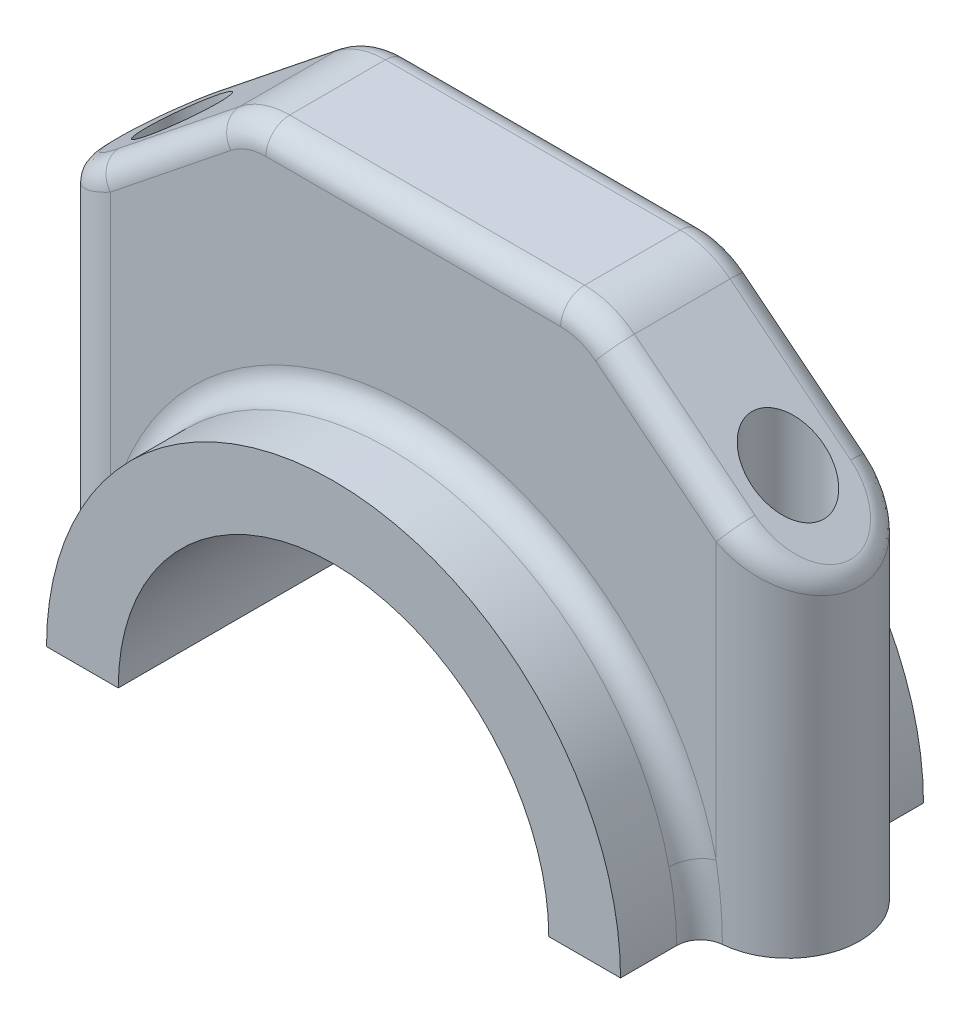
ISO-10303-21;
HEADER;
FILE_DESCRIPTION(('STEP AP214'),'2;1');
FILE_NAME('part.step','',(''),(''),'','','');
FILE_SCHEMA(('AUTOMOTIVE_DESIGN { 1 0 10303 214 1 1 1 1 }'));
ENDSEC;
DATA;
#1=APPLICATION_CONTEXT('core data for automotive mechanical design processes');
#2=APPLICATION_PROTOCOL_DEFINITION('international standard','automotive_design',2000,#1);
#3=PRODUCT_CONTEXT('',#1,'mechanical');
#4=PRODUCT('Part','Part','',(#3));
#5=PRODUCT_RELATED_PRODUCT_CATEGORY('part','',(#4));
#6=PRODUCT_DEFINITION_FORMATION('','',#4);
#7=PRODUCT_DEFINITION_CONTEXT('part definition',#1,'design');
#8=PRODUCT_DEFINITION('design','',#6,#7);
#9=PRODUCT_DEFINITION_SHAPE('','',#8);
#10=(LENGTH_UNIT() NAMED_UNIT(*) SI_UNIT(.MILLI.,.METRE.));
#11=(NAMED_UNIT(*) PLANE_ANGLE_UNIT() SI_UNIT($,.RADIAN.));
#12=(NAMED_UNIT(*) SI_UNIT($,.STERADIAN.) SOLID_ANGLE_UNIT());
#13=UNCERTAINTY_MEASURE_WITH_UNIT(LENGTH_MEASURE(1.E-05),#10,'distance_accuracy_value','');
#14=(GEOMETRIC_REPRESENTATION_CONTEXT(3) GLOBAL_UNCERTAINTY_ASSIGNED_CONTEXT((#13)) GLOBAL_UNIT_ASSIGNED_CONTEXT((#10,
#11,#12)) REPRESENTATION_CONTEXT('',''));
#15=CARTESIAN_POINT('',(0.,0.,0.));
#16=DIRECTION('',(0.,0.,1.));
#17=DIRECTION('',(1.,0.,0.));
#18=AXIS2_PLACEMENT_3D('',#15,#16,#17);
#19=CARTESIAN_POINT('',(-36.,0.,19.));
#20=DIRECTION('',(0.,1.,0.));
#21=DIRECTION('',(0.,0.,1.));
#22=AXIS2_PLACEMENT_3D('',#19,#20,#21);
#23=PLANE('',#22);
#24=CARTESIAN_POINT('',(-38.,0.,0.));
#25=DIRECTION('',(0.,-1.,0.));
#26=DIRECTION('',(0.,0.,-1.));
#27=AXIS2_PLACEMENT_3D('',#24,#25,#26);
#28=CIRCLE('',#27,4.5);
#29=CARTESIAN_POINT('',(-38.,0.,-4.50000000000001));
#30=VERTEX_POINT('',#29);
#31=EDGE_CURVE('E247',#30,#30,#28,.T.);
#32=ORIENTED_EDGE('',*,*,#31,.F.);
#33=EDGE_LOOP('',(#32));
#34=FACE_BOUND('',#33,.T.);
#35=DIRECTION('',(1.,0.,0.));
#36=VECTOR('',#35,1.);
#37=CARTESIAN_POINT('',(-36.,0.,-19.));
#38=LINE('',#37,#36);
#39=CARTESIAN_POINT('',(-36.,0.,-19.));
#40=VERTEX_POINT('',#39);
#41=CARTESIAN_POINT('',(-27.,0.,-19.));
#42=VERTEX_POINT('',#41);
#43=EDGE_CURVE('E226',#40,#42,#38,.T.);
#44=ORIENTED_EDGE('',*,*,#43,.T.);
#45=DIRECTION('',(0.,0.,-1.));
#46=VECTOR('',#45,1.);
#47=CARTESIAN_POINT('',(-27.,0.,19.));
#48=LINE('',#47,#46);
#49=CARTESIAN_POINT('',(-27.,0.,19.));
#50=VERTEX_POINT('',#49);
#51=EDGE_CURVE('E550',#50,#42,#48,.T.);
#52=ORIENTED_EDGE('',*,*,#51,.F.);
#53=DIRECTION('',(1.,0.,0.));
#54=VECTOR('',#53,1.);
#55=CARTESIAN_POINT('',(-36.,0.,19.));
#56=LINE('',#55,#54);
#57=CARTESIAN_POINT('',(-36.,0.,19.));
#58=VERTEX_POINT('',#57);
#59=EDGE_CURVE('E223',#58,#50,#56,.T.);
#60=ORIENTED_EDGE('',*,*,#59,.F.);
#61=DIRECTION('',(0.,0.,-1.));
#62=VECTOR('',#61,1.);
#63=CARTESIAN_POINT('',(-36.,0.,19.));
#64=LINE('',#63,#62);
#65=CARTESIAN_POINT('',(-36.,0.,11.9582607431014));
#66=VERTEX_POINT('',#65);
#67=EDGE_CURVE('E560',#58,#66,#64,.T.);
#68=ORIENTED_EDGE('',*,*,#67,.T.);
#69=CARTESIAN_POINT('',(-39.,0.,11.9582607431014));
#70=DIRECTION('',(0.,1.,0.));
#71=DIRECTION('',(0.,0.,1.));
#72=AXIS2_PLACEMENT_3D('',#69,#70,#71);
#73=CIRCLE('',#72,3.);
#74=CARTESIAN_POINT('',(-38.75,0.,8.96869555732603));
#75=VERTEX_POINT('',#74);
#76=EDGE_CURVE('E448',#66,#75,#73,.T.);
#77=ORIENTED_EDGE('',*,*,#76,.T.);
#78=CARTESIAN_POINT('',(-38.,0.,0.));
#79=DIRECTION('',(0.,1.,0.));
#80=DIRECTION('',(0.,0.,1.));
#81=AXIS2_PLACEMENT_3D('',#78,#79,#80);
#82=CIRCLE('',#81,9.);
#83=CARTESIAN_POINT('',(-38.75,0.,-8.96869555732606));
#84=VERTEX_POINT('',#83);
#85=EDGE_CURVE('E534',#84,#75,#82,.T.);
#86=ORIENTED_EDGE('',*,*,#85,.F.);
#87=CARTESIAN_POINT('',(-39.,0.,-11.9582607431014));
#88=DIRECTION('',(0.,1.,0.));
#89=DIRECTION('',(0.,0.,1.));
#90=AXIS2_PLACEMENT_3D('',#87,#88,#89);
#91=CIRCLE('',#90,3.);
#92=CARTESIAN_POINT('',(-36.,0.,-11.9582607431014));
#93=VERTEX_POINT('',#92);
#94=EDGE_CURVE('E54',#84,#93,#91,.T.);
#95=ORIENTED_EDGE('',*,*,#94,.T.);
#96=EDGE_CURVE('E559',#93,#40,#64,.T.);
#97=ORIENTED_EDGE('',*,*,#96,.T.);
#98=EDGE_LOOP('',(#44,#52,#60,#68,#77,#86,#95,#97));
#99=FACE_BOUND('',#98,.T.);
#100=ADVANCED_FACE('F41',(#34,#99),#23,.F.);
#101=CARTESIAN_POINT('',(0.,0.,19.));
#102=DIRECTION('',(0.,0.,-1.));
#103=DIRECTION('',(-1.,0.,0.));
#104=AXIS2_PLACEMENT_3D('',#101,#102,#103);
#105=CYLINDRICAL_SURFACE('',#104,27.);
#106=ORIENTED_EDGE('',*,*,#51,.T.);
#107=CARTESIAN_POINT('',(0.,0.,-19.));
#108=DIRECTION('',(0.,0.,-1.));
#109=DIRECTION('',(1.,0.,0.));
#110=AXIS2_PLACEMENT_3D('',#107,#108,#109);
#111=CIRCLE('',#110,27.);
#112=CARTESIAN_POINT('',(27.,0.,-19.));
#113=VERTEX_POINT('',#112);
#114=EDGE_CURVE('E231',#42,#113,#111,.T.);
#115=ORIENTED_EDGE('',*,*,#114,.T.);
#116=DIRECTION('',(0.,0.,-1.));
#117=VECTOR('',#116,1.);
#118=CARTESIAN_POINT('',(27.,0.,19.));
#119=LINE('',#118,#117);
#120=CARTESIAN_POINT('',(27.,0.,19.));
#121=VERTEX_POINT('',#120);
#122=EDGE_CURVE('E211',#121,#113,#119,.T.);
#123=ORIENTED_EDGE('',*,*,#122,.F.);
#124=CARTESIAN_POINT('',(0.,0.,19.));
#125=DIRECTION('',(0.,0.,-1.));
#126=DIRECTION('',(1.,0.,0.));
#127=AXIS2_PLACEMENT_3D('',#124,#125,#126);
#128=CIRCLE('',#127,27.);
#129=EDGE_CURVE('E218',#50,#121,#128,.T.);
#130=ORIENTED_EDGE('',*,*,#129,.F.);
#131=EDGE_LOOP('',(#106,#115,#123,#130));
#132=FACE_BOUND('',#131,.T.);
#133=ADVANCED_FACE('F229',(#132),#105,.F.);
#134=CARTESIAN_POINT('',(0.,0.,19.));
#135=DIRECTION('',(0.,0.,-1.));
#136=DIRECTION('',(-1.,0.,0.));
#137=AXIS2_PLACEMENT_3D('',#134,#135,#136);
#138=CYLINDRICAL_SURFACE('',#137,36.);
#139=ORIENTED_EDGE('',*,*,#96,.F.);
#140=CARTESIAN_POINT('',(-37.4810325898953,11.3626534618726,-8.98502492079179));
#141=CARTESIAN_POINT('',(-34.4537354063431,10.4375745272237,-8.81017080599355));
#142=CARTESIAN_POINT('',(-34.4381939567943,10.4886031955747,-11.9800332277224));
#143=CARTESIAN_POINT('',(-37.5298969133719,11.148733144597,-8.98784608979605));
#144=CARTESIAN_POINT('',(-34.5115894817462,10.2465778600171,-8.82998687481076));
#145=CARTESIAN_POINT('',(-34.498334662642,10.2911382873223,-11.9837947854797));
#146=CARTESIAN_POINT('',(-37.577382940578,10.9342439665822,-8.9901901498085));
#147=CARTESIAN_POINT('',(-34.5681739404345,10.0540399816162,-8.84874261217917));
#148=CARTESIAN_POINT('',(-34.556779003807,10.0931482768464,-11.9869201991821));
#149=CARTESIAN_POINT('',(-37.6695772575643,10.5042248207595,-8.99405103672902));
#150=CARTESIAN_POINT('',(-34.678332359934,9.66718051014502,-8.88416835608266));
#151=CARTESIAN_POINT('',(-34.6702489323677,9.69620752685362,-11.9920680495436));
#152=CARTESIAN_POINT('',(-37.7142859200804,10.2886949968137,-8.99556797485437));
#153=CARTESIAN_POINT('',(-34.7319378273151,9.47281215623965,-8.9008542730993));
#154=CARTESIAN_POINT('',(-34.7252749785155,9.49725692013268,-11.9940906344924));
#155=CARTESIAN_POINT('',(-37.8007754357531,9.85734250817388,-8.99789846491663));
#156=CARTESIAN_POINT('',(-34.8358867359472,9.08303942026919,-8.93226168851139));
#157=CARTESIAN_POINT('',(-34.8317236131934,9.09908539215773,-11.9971979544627));
#158=CARTESIAN_POINT('',(-37.8425654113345,9.64152312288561,-8.99871430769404));
#159=CARTESIAN_POINT('',(-34.8862690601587,8.88759468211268,-8.94700271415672));
#160=CARTESIAN_POINT('',(-34.8831574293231,8.89986749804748,-11.9982857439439));
#161=CARTESIAN_POINT('',(-37.923368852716,9.20893904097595,-8.99976377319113));
#162=CARTESIAN_POINT('',(-34.9838968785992,8.49516334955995,-8.97474421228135));
#163=CARTESIAN_POINT('',(-34.9826078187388,8.5005591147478,-11.9996850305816));
#164=CARTESIAN_POINT('',(-37.9623819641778,8.99217422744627,-8.99999732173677));
#165=CARTESIAN_POINT('',(-35.0311700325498,8.29812568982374,-8.98775615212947));
#166=CARTESIAN_POINT('',(-35.0306239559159,8.30046851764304,-11.9999964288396));
#167=CARTESIAN_POINT('',(-38.170169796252,7.79238905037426,-9.00001211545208));
#168=CARTESIAN_POINT('',(-35.2815859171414,7.21356284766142,-9.05476926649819));
#169=CARTESIAN_POINT('',(-35.2863628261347,7.19297450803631,-12.0000161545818));
#170=CARTESIAN_POINT('',(-38.3117919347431,6.80070706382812,-8.9952998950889));
#171=CARTESIAN_POINT('',(-35.4565715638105,6.30129716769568,-9.09435648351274));
#172=CARTESIAN_POINT('',(-35.4606669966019,6.27757575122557,-11.9937331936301));
#173=CARTESIAN_POINT('',(-38.5370044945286,4.80517282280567,-8.9846763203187));
#174=CARTESIAN_POINT('',(-35.7342965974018,4.46262507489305,-9.15229240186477));
#175=CARTESIAN_POINT('',(-35.7378516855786,4.4355441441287,-11.9795684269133));
#176=CARTESIAN_POINT('',(-38.620559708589,3.8013135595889,-8.97876424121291));
#177=CARTESIAN_POINT('',(-35.8386966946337,3.53077783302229,-9.17105709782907));
#178=CARTESIAN_POINT('',(-35.8406888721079,3.50890482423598,-11.9716856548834));
#179=CARTESIAN_POINT('',(-38.7023265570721,2.28395835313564,-8.97258744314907));
#180=CARTESIAN_POINT('',(-35.9405679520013,2.12176509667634,-9.18876896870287));
#181=CARTESIAN_POINT('',(-35.9413249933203,2.10826924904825,-11.9634499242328));
#182=CARTESIAN_POINT('',(-38.7223028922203,1.77242253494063,-8.97097540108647));
#183=CARTESIAN_POINT('',(-35.9654791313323,1.64656202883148,-9.1929437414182));
#184=CARTESIAN_POINT('',(-35.9659112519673,1.63608233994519,-11.9613005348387));
#185=CARTESIAN_POINT('',(-38.7471320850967,0.748661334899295,-8.9689454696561));
#186=CARTESIAN_POINT('',(-35.9964090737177,0.695843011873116,-9.19808791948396));
#187=CARTESIAN_POINT('',(-35.9964702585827,0.691072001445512,-11.9585939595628));
#188=CARTESIAN_POINT('',(-38.7519847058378,0.236435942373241,-8.96852759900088));
#189=CARTESIAN_POINT('',(-36.0024767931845,0.219571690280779,-9.19906554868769));
#190=CARTESIAN_POINT('',(-36.0024427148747,0.218248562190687,-11.958036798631));
#191=CARTESIAN_POINT('',(-38.7465546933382,-0.78761762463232,-8.96898559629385));
#192=CARTESIAN_POINT('',(-35.9957015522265,-0.731749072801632,-9.19795969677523));
#193=CARTESIAN_POINT('',(-35.9957596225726,-0.727031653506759,-11.9586474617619));
#194=CARTESIAN_POINT('',(-38.7362793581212,-1.29944587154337,-8.96986084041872));
#195=CARTESIAN_POINT('',(-35.982856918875,-1.2075561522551,-9.19587593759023));
#196=CARTESIAN_POINT('',(-35.9831130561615,-1.19948849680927,-11.9598144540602));
#197=CARTESIAN_POINT('',(-38.7006289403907,-2.3221556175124,-8.97269456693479));
#198=CARTESIAN_POINT('',(-35.9384938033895,-2.15692600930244,-9.18837599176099));
#199=CARTESIAN_POINT('',(-35.9392356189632,-2.14352826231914,-11.9635927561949));
#200=CARTESIAN_POINT('',(-38.6752540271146,-2.83303712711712,-8.97465303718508));
#201=CARTESIAN_POINT('',(-35.9069050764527,-2.63124043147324,-9.1829476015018));
#202=CARTESIAN_POINT('',(-35.9080049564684,-2.61511119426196,-11.9662040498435));
#203=CARTESIAN_POINT('',(-38.642340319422,-3.34305268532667,-8.97704845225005));
#204=CARTESIAN_POINT('',(-35.8660269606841,-3.10296691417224,-9.17570372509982));
#205=CARTESIAN_POINT('',(-35.8674957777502,-3.08589478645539,-11.9693979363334));
#206=(BOUNDED_SURFACE() B_SPLINE_SURFACE(3,2,((#140,#141,#142),(#143,#144,#145),(#146,#147,
#148),(#149,#150,#151),(#152,#153,#154),(#155,#156,#157),(#158,#159,#160),(#161,#162,#163),
(#164,#165,#166),(#167,#168,#169),(#170,#171,#172),(#173,#174,#175),(#176,#177,#178),(#179,#180,
#181),(#182,#183,#184),(#185,#186,#187),(#188,#189,#190),(#191,#192,#193),(#194,#195,#196),
(#197,#198,#199),(#200,#201,#202),(#203,#204,#205)),.UNSPECIFIED.,.F.,.F.,
.F.) B_SPLINE_SURFACE_WITH_KNOTS((4,2,2,2,2,2,2,2,2,2,4),(3,3),(0.,0.670947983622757,
1.34180572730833,2.01046300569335,2.67920545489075,5.7043438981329,8.73131495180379,
10.2676745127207,11.8040581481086,13.3397008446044,14.875326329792),(0.,1.),
.UNSPECIFIED.) GEOMETRIC_REPRESENTATION_ITEM() RATIONAL_B_SPLINE_SURFACE(((1.,0.687327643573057,
1.),(1.,0.689181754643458,1.),(1.,0.690985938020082,1.),(1.,0.694492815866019,1.),(1.,
0.696195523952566,1.),(1.,0.699492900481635,1.),(1.,0.701087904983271,1.),(1.,0.7041749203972,
1.),(1.,0.705666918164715,1.),(1.,0.713620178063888,1.),(1.,0.719066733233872,1.),(1.,
0.727743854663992,1.),(1.,0.730973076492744,1.),(1.,0.734135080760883,1.),(1.,0.734908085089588,
1.),(1.,0.735869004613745,1.),(1.,0.736056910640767,1.),(1.,0.735846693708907,1.),(1.,
0.735448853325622,1.),(1.,0.734069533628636,1.),(1.,0.733088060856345,1.),(1.,0.731815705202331,1.))) REPRESENTATION_ITEM('') SURFACE());
#207=CARTESIAN_POINT('',(-35.8674957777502,-3.08589478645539,-11.9693979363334));
#208=CARTESIAN_POINT('',(-35.9080049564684,-2.61511119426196,-11.9662040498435));
#209=CARTESIAN_POINT('',(-35.9392356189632,-2.14352826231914,-11.9635927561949));
#210=CARTESIAN_POINT('',(-35.9831130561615,-1.19948849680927,-11.9598144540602));
#211=CARTESIAN_POINT('',(-35.9957596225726,-0.727031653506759,-11.9586474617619));
#212=CARTESIAN_POINT('',(-36.0024427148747,0.218248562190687,-11.958036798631));
#213=CARTESIAN_POINT('',(-35.9964702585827,0.691072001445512,-11.9585939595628));
#214=CARTESIAN_POINT('',(-35.9659112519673,1.63608233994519,-11.9613005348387));
#215=CARTESIAN_POINT('',(-35.9413249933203,2.10826924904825,-11.9634499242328));
#216=CARTESIAN_POINT('',(-35.8406888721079,3.50890482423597,-11.9716856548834));
#217=CARTESIAN_POINT('',(-35.7378516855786,4.4355441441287,-11.9795684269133));
#218=CARTESIAN_POINT('',(-35.4606669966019,6.27757575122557,-11.9937331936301));
#219=CARTESIAN_POINT('',(-35.2863628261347,7.19297450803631,-12.0000161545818));
#220=CARTESIAN_POINT('',(-35.0306239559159,8.30046851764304,-11.9999964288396));
#221=CARTESIAN_POINT('',(-34.9826078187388,8.50055911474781,-11.9996850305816));
#222=CARTESIAN_POINT('',(-34.8831574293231,8.89986749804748,-11.9982857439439));
#223=CARTESIAN_POINT('',(-34.8317236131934,9.09908539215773,-11.9971979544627));
#224=CARTESIAN_POINT('',(-34.7252749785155,9.49725692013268,-11.9940906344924));
#225=CARTESIAN_POINT('',(-34.6702489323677,9.69620752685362,-11.9920680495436));
#226=CARTESIAN_POINT('',(-34.556779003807,10.0931482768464,-11.9869201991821));
#227=CARTESIAN_POINT('',(-34.498334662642,10.2911382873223,-11.9837947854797));
#228=CARTESIAN_POINT('',(-34.4381939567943,10.4886031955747,-11.9800332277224));
#229=B_SPLINE_CURVE_WITH_KNOTS('',3,(#207,#208,#209,#210,#211,#212,#213,#214,#215,#216,#217,
#218,#219,#220,#221,#222,#223,#224,#225,#226,#227,#228),.UNSPECIFIED.,.F.,.F.,(4,2,2,2,2,2,2,2,
2,2,4),(0.,1.53562548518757,3.07126818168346,4.6076518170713,6.14401137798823,9.17098243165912,
12.1961208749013,12.8648633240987,13.5335206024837,14.2043783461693,14.875326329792),.UNSPECIFIED.);
#230=CARTESIAN_POINT('',(-35.0769230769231,8.0999671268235,-12.));
#231=VERTEX_POINT('',#230);
#232=EDGE_CURVE('E62',#93,#231,#229,.T.);
#233=ORIENTED_EDGE('',*,*,#232,.T.);
#234=CARTESIAN_POINT('',(0.,0.,-12.));
#235=DIRECTION('',(0.,0.,1.));
#236=DIRECTION('',(1.,0.,0.));
#237=AXIS2_PLACEMENT_3D('',#234,#235,#236);
#238=CIRCLE('',#237,36.);
#239=CARTESIAN_POINT('',(35.0769230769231,8.0999671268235,-12.));
#240=VERTEX_POINT('',#239);
#241=EDGE_CURVE('E67',#231,#240,#238,.F.);
#242=ORIENTED_EDGE('',*,*,#241,.T.);
#243=CARTESIAN_POINT('',(34.4381939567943,10.4886031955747,-11.9800332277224));
#244=CARTESIAN_POINT('',(34.4537354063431,10.4375745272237,-8.81017080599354));
#245=CARTESIAN_POINT('',(37.4810325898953,11.3626534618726,-8.98502492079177));
#246=CARTESIAN_POINT('',(34.498334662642,10.2911382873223,-11.9837947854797));
#247=CARTESIAN_POINT('',(34.5115894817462,10.2465778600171,-8.82998687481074));
#248=CARTESIAN_POINT('',(37.5298969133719,11.148733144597,-8.98784608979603));
#249=CARTESIAN_POINT('',(34.556779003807,10.0931482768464,-11.9869201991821));
#250=CARTESIAN_POINT('',(34.5681739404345,10.0540399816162,-8.84874261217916));
#251=CARTESIAN_POINT('',(37.577382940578,10.9342439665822,-8.99019014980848));
#252=CARTESIAN_POINT('',(34.6702489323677,9.69620752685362,-11.9920680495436));
#253=CARTESIAN_POINT('',(34.678332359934,9.66718051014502,-8.88416835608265));
#254=CARTESIAN_POINT('',(37.6695772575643,10.5042248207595,-8.994051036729));
#255=CARTESIAN_POINT('',(34.7252749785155,9.49725692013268,-11.9940906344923));
#256=CARTESIAN_POINT('',(34.7319378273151,9.47281215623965,-8.90085427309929));
#257=CARTESIAN_POINT('',(37.7142859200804,10.2886949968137,-8.99556797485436));
#258=CARTESIAN_POINT('',(34.8317236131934,9.09908539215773,-11.9971979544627));
#259=CARTESIAN_POINT('',(34.8358867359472,9.08303942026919,-8.93226168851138));
#260=CARTESIAN_POINT('',(37.8007754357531,9.85734250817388,-8.99789846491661));
#261=CARTESIAN_POINT('',(34.8831574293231,8.89986749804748,-11.9982857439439));
#262=CARTESIAN_POINT('',(34.8862690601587,8.88759468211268,-8.9470027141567));
#263=CARTESIAN_POINT('',(37.8425654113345,9.64152312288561,-8.99871430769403));
#264=CARTESIAN_POINT('',(34.9826078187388,8.5005591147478,-11.9996850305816));
#265=CARTESIAN_POINT('',(34.9838968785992,8.49516334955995,-8.97474421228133));
#266=CARTESIAN_POINT('',(37.923368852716,9.20893904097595,-8.99976377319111));
#267=CARTESIAN_POINT('',(35.0306239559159,8.30046851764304,-11.9999964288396));
#268=CARTESIAN_POINT('',(35.0311700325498,8.29812568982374,-8.98775615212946));
#269=CARTESIAN_POINT('',(37.9623819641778,8.99217422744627,-8.99999732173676));
#270=CARTESIAN_POINT('',(35.2863628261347,7.19297450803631,-12.0000161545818));
#271=CARTESIAN_POINT('',(35.2815859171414,7.21356284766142,-9.05476926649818));
#272=CARTESIAN_POINT('',(38.170169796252,7.79238905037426,-9.00001211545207));
#273=CARTESIAN_POINT('',(35.4606669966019,6.27757575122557,-11.9937331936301));
#274=CARTESIAN_POINT('',(35.4565715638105,6.30129716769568,-9.09435648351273));
#275=CARTESIAN_POINT('',(38.3117919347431,6.80070706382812,-8.99529989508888));
#276=CARTESIAN_POINT('',(35.7378516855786,4.4355441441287,-11.9795684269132));
#277=CARTESIAN_POINT('',(35.7342965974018,4.46262507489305,-9.15229240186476));
#278=CARTESIAN_POINT('',(38.5370044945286,4.80517282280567,-8.98467632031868));
#279=CARTESIAN_POINT('',(35.8406888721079,3.50890482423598,-11.9716856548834));
#280=CARTESIAN_POINT('',(35.8386966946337,3.53077783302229,-9.17105709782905));
#281=CARTESIAN_POINT('',(38.620559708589,3.8013135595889,-8.97876424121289));
#282=CARTESIAN_POINT('',(35.9413249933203,2.10826924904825,-11.9634499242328));
#283=CARTESIAN_POINT('',(35.9405679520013,2.12176509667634,-9.18876896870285));
#284=CARTESIAN_POINT('',(38.7023265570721,2.28395835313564,-8.97258744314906));
#285=CARTESIAN_POINT('',(35.9659112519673,1.63608233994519,-11.9613005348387));
#286=CARTESIAN_POINT('',(35.9654791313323,1.64656202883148,-9.19294374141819));
#287=CARTESIAN_POINT('',(38.7223028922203,1.77242253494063,-8.97097540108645));
#288=CARTESIAN_POINT('',(35.9964702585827,0.691072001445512,-11.9585939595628));
#289=CARTESIAN_POINT('',(35.9964090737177,0.695843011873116,-9.19808791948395));
#290=CARTESIAN_POINT('',(38.7471320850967,0.748661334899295,-8.96894546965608));
#291=CARTESIAN_POINT('',(36.0024427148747,0.218248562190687,-11.958036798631));
#292=CARTESIAN_POINT('',(36.0024767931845,0.219571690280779,-9.19906554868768));
#293=CARTESIAN_POINT('',(38.7519847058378,0.236435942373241,-8.96852759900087));
#294=CARTESIAN_POINT('',(35.9957596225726,-0.727031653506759,-11.9586474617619));
#295=CARTESIAN_POINT('',(35.9957015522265,-0.731749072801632,-9.19795969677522));
#296=CARTESIAN_POINT('',(38.7465546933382,-0.78761762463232,-8.96898559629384));
#297=CARTESIAN_POINT('',(35.9831130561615,-1.19948849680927,-11.9598144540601));
#298=CARTESIAN_POINT('',(35.982856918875,-1.2075561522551,-9.19587593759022));
#299=CARTESIAN_POINT('',(38.7362793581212,-1.29944587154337,-8.96986084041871));
#300=CARTESIAN_POINT('',(35.9392356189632,-2.14352826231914,-11.9635927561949));
#301=CARTESIAN_POINT('',(35.9384938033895,-2.15692600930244,-9.18837599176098));
#302=CARTESIAN_POINT('',(38.7006289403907,-2.3221556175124,-8.97269456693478));
#303=CARTESIAN_POINT('',(35.9080049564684,-2.61511119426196,-11.9662040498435));
#304=CARTESIAN_POINT('',(35.9069050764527,-2.63124043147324,-9.18294760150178));
#305=CARTESIAN_POINT('',(38.6752540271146,-2.83303712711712,-8.97465303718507));
#306=CARTESIAN_POINT('',(35.8674957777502,-3.08589478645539,-11.9693979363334));
#307=CARTESIAN_POINT('',(35.8660269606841,-3.10296691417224,-9.17570372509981));
#308=CARTESIAN_POINT('',(38.642340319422,-3.34305268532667,-8.97704845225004));
#309=(BOUNDED_SURFACE() B_SPLINE_SURFACE(3,2,((#243,#244,#245),(#246,#247,#248),(#249,#250,
#251),(#252,#253,#254),(#255,#256,#257),(#258,#259,#260),(#261,#262,#263),(#264,#265,#266),
(#267,#268,#269),(#270,#271,#272),(#273,#274,#275),(#276,#277,#278),(#279,#280,#281),(#282,#283,
#284),(#285,#286,#287),(#288,#289,#290),(#291,#292,#293),(#294,#295,#296),(#297,#298,#299),
(#300,#301,#302),(#303,#304,#305),(#306,#307,#308)),.UNSPECIFIED.,.F.,.F.,
.F.) B_SPLINE_SURFACE_WITH_KNOTS((4,2,2,2,2,2,2,2,2,2,4),(3,3),(0.,0.670947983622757,
1.34180572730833,2.01046300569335,2.67920545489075,5.7043438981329,8.73131495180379,
10.2676745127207,11.8040581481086,13.3397008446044,14.875326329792),(0.,1.),
.UNSPECIFIED.) GEOMETRIC_REPRESENTATION_ITEM() RATIONAL_B_SPLINE_SURFACE(((1.,0.687327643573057,
1.),(1.,0.689181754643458,1.),(1.,0.690985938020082,1.),(1.,0.694492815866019,1.),(1.,
0.696195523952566,1.),(1.,0.699492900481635,1.),(1.,0.701087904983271,1.),(1.,0.7041749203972,
1.),(1.,0.705666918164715,1.),(1.,0.713620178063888,1.),(1.,0.719066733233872,1.),(1.,
0.727743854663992,1.),(1.,0.730973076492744,1.),(1.,0.734135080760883,1.),(1.,0.734908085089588,
1.),(1.,0.735869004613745,1.),(1.,0.736056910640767,1.),(1.,0.735846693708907,1.),(1.,
0.735448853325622,1.),(1.,0.734069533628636,1.),(1.,0.733088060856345,1.),(1.,0.731815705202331,1.))) REPRESENTATION_ITEM('') SURFACE());
#310=CARTESIAN_POINT('',(34.4381939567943,10.4886031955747,-11.9800332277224));
#311=CARTESIAN_POINT('',(34.498334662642,10.2911382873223,-11.9837947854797));
#312=CARTESIAN_POINT('',(34.556779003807,10.0931482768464,-11.9869201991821));
#313=CARTESIAN_POINT('',(34.6702489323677,9.69620752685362,-11.9920680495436));
#314=CARTESIAN_POINT('',(34.7252749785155,9.49725692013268,-11.9940906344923));
#315=CARTESIAN_POINT('',(34.8317236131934,9.09908539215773,-11.9971979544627));
#316=CARTESIAN_POINT('',(34.8831574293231,8.89986749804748,-11.9982857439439));
#317=CARTESIAN_POINT('',(34.9826078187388,8.50055911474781,-11.9996850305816));
#318=CARTESIAN_POINT('',(35.0306239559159,8.30046851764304,-11.9999964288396));
#319=CARTESIAN_POINT('',(35.2863628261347,7.19297450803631,-12.0000161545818));
#320=CARTESIAN_POINT('',(35.4606669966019,6.27757575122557,-11.9937331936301));
#321=CARTESIAN_POINT('',(35.7378516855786,4.4355441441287,-11.9795684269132));
#322=CARTESIAN_POINT('',(35.8406888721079,3.50890482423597,-11.9716856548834));
#323=CARTESIAN_POINT('',(35.9413249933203,2.10826924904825,-11.9634499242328));
#324=CARTESIAN_POINT('',(35.9659112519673,1.63608233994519,-11.9613005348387));
#325=CARTESIAN_POINT('',(35.9964702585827,0.691072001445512,-11.9585939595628));
#326=CARTESIAN_POINT('',(36.0024427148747,0.218248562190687,-11.958036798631));
#327=CARTESIAN_POINT('',(35.9957596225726,-0.72703165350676,-11.9586474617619));
#328=CARTESIAN_POINT('',(35.9831130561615,-1.19948849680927,-11.9598144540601));
#329=CARTESIAN_POINT('',(35.9392356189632,-2.14352826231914,-11.9635927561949));
#330=CARTESIAN_POINT('',(35.9080049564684,-2.61511119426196,-11.9662040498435));
#331=CARTESIAN_POINT('',(35.8674957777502,-3.08589478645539,-11.9693979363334));
#332=B_SPLINE_CURVE_WITH_KNOTS('',3,(#310,#311,#312,#313,#314,#315,#316,#317,#318,#319,#320,
#321,#322,#323,#324,#325,#326,#327,#328,#329,#330,#331),.UNSPECIFIED.,.F.,.F.,(4,2,2,2,2,2,2,2,
2,2,4),(0.,0.670947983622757,1.34180572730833,2.01046300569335,2.67920545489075,5.7043438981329,
8.73131495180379,10.2676745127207,11.8040581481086,13.3397008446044,14.875326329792),.UNSPECIFIED.);
#333=CARTESIAN_POINT('',(36.,0.,-11.9582607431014));
#334=VERTEX_POINT('',#333);
#335=EDGE_CURVE('E428',#240,#334,#332,.T.);
#336=ORIENTED_EDGE('',*,*,#335,.T.);
#337=DIRECTION('',(0.,0.,-1.));
#338=VECTOR('',#337,1.);
#339=CARTESIAN_POINT('',(36.,0.,19.));
#340=LINE('',#339,#338);
#341=CARTESIAN_POINT('',(36.,0.,-19.));
#342=VERTEX_POINT('',#341);
#343=EDGE_CURVE('E237',#334,#342,#340,.T.);
#344=ORIENTED_EDGE('',*,*,#343,.T.);
#345=CARTESIAN_POINT('',(0.,0.,-19.));
#346=DIRECTION('',(0.,0.,1.));
#347=DIRECTION('',(1.,0.,0.));
#348=AXIS2_PLACEMENT_3D('',#345,#346,#347);
#349=CIRCLE('',#348,36.);
#350=EDGE_CURVE('E554',#342,#40,#349,.T.);
#351=ORIENTED_EDGE('',*,*,#350,.T.);
#352=EDGE_LOOP('',(#139,#233,#242,#336,#344,#351));
#353=FACE_BOUND('',#352,.T.);
#354=ADVANCED_FACE('F340',(#353),#138,.T.);
#355=CARTESIAN_POINT('',(36.,0.,19.));
#356=VERTEX_POINT('',#355);
#357=CARTESIAN_POINT('',(36.,0.,11.9582607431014));
#358=VERTEX_POINT('',#357);
#359=EDGE_CURVE('E214',#356,#358,#340,.T.);
#360=ORIENTED_EDGE('',*,*,#359,.T.);
#361=CARTESIAN_POINT('',(37.4810325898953,11.3626534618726,8.98502492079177));
#362=CARTESIAN_POINT('',(34.4537354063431,10.4375745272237,8.81017080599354));
#363=CARTESIAN_POINT('',(34.4381939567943,10.4886031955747,11.9800332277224));
#364=CARTESIAN_POINT('',(37.5298969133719,11.148733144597,8.98784608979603));
#365=CARTESIAN_POINT('',(34.5115894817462,10.2465778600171,8.82998687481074));
#366=CARTESIAN_POINT('',(34.498334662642,10.2911382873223,11.9837947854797));
#367=CARTESIAN_POINT('',(37.577382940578,10.9342439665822,8.99019014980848));
#368=CARTESIAN_POINT('',(34.5681739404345,10.0540399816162,8.84874261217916));
#369=CARTESIAN_POINT('',(34.556779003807,10.0931482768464,11.9869201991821));
#370=CARTESIAN_POINT('',(37.6695772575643,10.5042248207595,8.994051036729));
#371=CARTESIAN_POINT('',(34.678332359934,9.66718051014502,8.88416835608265));
#372=CARTESIAN_POINT('',(34.6702489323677,9.69620752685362,11.9920680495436));
#373=CARTESIAN_POINT('',(37.7142859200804,10.2886949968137,8.99556797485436));
#374=CARTESIAN_POINT('',(34.7319378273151,9.47281215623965,8.90085427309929));
#375=CARTESIAN_POINT('',(34.7252749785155,9.49725692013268,11.9940906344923));
#376=CARTESIAN_POINT('',(37.8007754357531,9.85734250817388,8.99789846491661));
#377=CARTESIAN_POINT('',(34.8358867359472,9.08303942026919,8.93226168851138));
#378=CARTESIAN_POINT('',(34.8317236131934,9.09908539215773,11.9971979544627));
#379=CARTESIAN_POINT('',(37.8425654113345,9.64152312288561,8.99871430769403));
#380=CARTESIAN_POINT('',(34.8862690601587,8.88759468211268,8.9470027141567));
#381=CARTESIAN_POINT('',(34.8831574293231,8.89986749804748,11.9982857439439));
#382=CARTESIAN_POINT('',(37.923368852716,9.20893904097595,8.99976377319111));
#383=CARTESIAN_POINT('',(34.9838968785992,8.49516334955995,8.97474421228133));
#384=CARTESIAN_POINT('',(34.9826078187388,8.5005591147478,11.9996850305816));
#385=CARTESIAN_POINT('',(37.9623819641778,8.99217422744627,8.99999732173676));
#386=CARTESIAN_POINT('',(35.0311700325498,8.29812568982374,8.98775615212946));
#387=CARTESIAN_POINT('',(35.0306239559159,8.30046851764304,11.9999964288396));
#388=CARTESIAN_POINT('',(38.170169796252,7.79238905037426,9.00001211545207));
#389=CARTESIAN_POINT('',(35.2815859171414,7.21356284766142,9.05476926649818));
#390=CARTESIAN_POINT('',(35.2863628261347,7.19297450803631,12.0000161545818));
#391=CARTESIAN_POINT('',(38.3117919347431,6.80070706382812,8.99529989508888));
#392=CARTESIAN_POINT('',(35.4565715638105,6.30129716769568,9.09435648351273));
#393=CARTESIAN_POINT('',(35.4606669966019,6.27757575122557,11.9937331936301));
#394=CARTESIAN_POINT('',(38.5370044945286,4.80517282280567,8.98467632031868));
#395=CARTESIAN_POINT('',(35.7342965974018,4.46262507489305,9.15229240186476));
#396=CARTESIAN_POINT('',(35.7378516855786,4.4355441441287,11.9795684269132));
#397=CARTESIAN_POINT('',(38.620559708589,3.8013135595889,8.97876424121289));
#398=CARTESIAN_POINT('',(35.8386966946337,3.53077783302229,9.17105709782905));
#399=CARTESIAN_POINT('',(35.8406888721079,3.50890482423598,11.9716856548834));
#400=CARTESIAN_POINT('',(38.7023265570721,2.28395835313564,8.97258744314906));
#401=CARTESIAN_POINT('',(35.9405679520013,2.12176509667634,9.18876896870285));
#402=CARTESIAN_POINT('',(35.9413249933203,2.10826924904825,11.9634499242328));
#403=CARTESIAN_POINT('',(38.7223028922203,1.77242253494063,8.97097540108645));
#404=CARTESIAN_POINT('',(35.9654791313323,1.64656202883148,9.19294374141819));
#405=CARTESIAN_POINT('',(35.9659112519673,1.63608233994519,11.9613005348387));
#406=CARTESIAN_POINT('',(38.7471320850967,0.748661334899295,8.96894546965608));
#407=CARTESIAN_POINT('',(35.9964090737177,0.695843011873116,9.19808791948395));
#408=CARTESIAN_POINT('',(35.9964702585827,0.691072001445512,11.9585939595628));
#409=CARTESIAN_POINT('',(38.7519847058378,0.236435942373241,8.96852759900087));
#410=CARTESIAN_POINT('',(36.0024767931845,0.219571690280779,9.19906554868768));
#411=CARTESIAN_POINT('',(36.0024427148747,0.218248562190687,11.958036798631));
#412=CARTESIAN_POINT('',(38.7465546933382,-0.78761762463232,8.96898559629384));
#413=CARTESIAN_POINT('',(35.9957015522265,-0.731749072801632,9.19795969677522));
#414=CARTESIAN_POINT('',(35.9957596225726,-0.727031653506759,11.9586474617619));
#415=CARTESIAN_POINT('',(38.7362793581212,-1.29944587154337,8.96986084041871));
#416=CARTESIAN_POINT('',(35.982856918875,-1.2075561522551,9.19587593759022));
#417=CARTESIAN_POINT('',(35.9831130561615,-1.19948849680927,11.9598144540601));
#418=CARTESIAN_POINT('',(38.7006289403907,-2.3221556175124,8.97269456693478));
#419=CARTESIAN_POINT('',(35.9384938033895,-2.15692600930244,9.18837599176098));
#420=CARTESIAN_POINT('',(35.9392356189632,-2.14352826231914,11.9635927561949));
#421=CARTESIAN_POINT('',(38.6752540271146,-2.83303712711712,8.97465303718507));
#422=CARTESIAN_POINT('',(35.9069050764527,-2.63124043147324,9.18294760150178));
#423=CARTESIAN_POINT('',(35.9080049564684,-2.61511119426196,11.9662040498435));
#424=CARTESIAN_POINT('',(38.642340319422,-3.34305268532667,8.97704845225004));
#425=CARTESIAN_POINT('',(35.8660269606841,-3.10296691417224,9.17570372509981));
#426=CARTESIAN_POINT('',(35.8674957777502,-3.08589478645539,11.9693979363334));
#427=(BOUNDED_SURFACE() B_SPLINE_SURFACE(3,2,((#361,#362,#363),(#364,#365,#366),(#367,#368,
#369),(#370,#371,#372),(#373,#374,#375),(#376,#377,#378),(#379,#380,#381),(#382,#383,#384),
(#385,#386,#387),(#388,#389,#390),(#391,#392,#393),(#394,#395,#396),(#397,#398,#399),(#400,#401,
#402),(#403,#404,#405),(#406,#407,#408),(#409,#410,#411),(#412,#413,#414),(#415,#416,#417),
(#418,#419,#420),(#421,#422,#423),(#424,#425,#426)),.UNSPECIFIED.,.F.,.F.,
.F.) B_SPLINE_SURFACE_WITH_KNOTS((4,2,2,2,2,2,2,2,2,2,4),(3,3),(0.,0.670947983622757,
1.34180572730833,2.01046300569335,2.67920545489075,5.7043438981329,8.73131495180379,
10.2676745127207,11.8040581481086,13.3397008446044,14.875326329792),(0.,1.),
.UNSPECIFIED.) GEOMETRIC_REPRESENTATION_ITEM() RATIONAL_B_SPLINE_SURFACE(((1.,0.687327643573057,
1.),(1.,0.689181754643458,1.),(1.,0.690985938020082,1.),(1.,0.694492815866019,1.),(1.,
0.696195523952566,1.),(1.,0.699492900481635,1.),(1.,0.701087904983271,1.),(1.,0.7041749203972,
1.),(1.,0.705666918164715,1.),(1.,0.713620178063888,1.),(1.,0.719066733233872,1.),(1.,
0.727743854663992,1.),(1.,0.730973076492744,1.),(1.,0.734135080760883,1.),(1.,0.734908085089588,
1.),(1.,0.735869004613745,1.),(1.,0.736056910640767,1.),(1.,0.735846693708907,1.),(1.,
0.735448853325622,1.),(1.,0.734069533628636,1.),(1.,0.733088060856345,1.),(1.,0.731815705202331,1.))) REPRESENTATION_ITEM('') SURFACE());
#428=CARTESIAN_POINT('',(35.8674957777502,-3.08589478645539,11.9693979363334));
#429=CARTESIAN_POINT('',(35.9080049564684,-2.61511119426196,11.9662040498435));
#430=CARTESIAN_POINT('',(35.9392356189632,-2.14352826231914,11.9635927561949));
#431=CARTESIAN_POINT('',(35.9831130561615,-1.19948849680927,11.9598144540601));
#432=CARTESIAN_POINT('',(35.9957596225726,-0.727031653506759,11.9586474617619));
#433=CARTESIAN_POINT('',(36.0024427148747,0.218248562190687,11.958036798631));
#434=CARTESIAN_POINT('',(35.9964702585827,0.691072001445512,11.9585939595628));
#435=CARTESIAN_POINT('',(35.9659112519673,1.63608233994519,11.9613005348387));
#436=CARTESIAN_POINT('',(35.9413249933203,2.10826924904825,11.9634499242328));
#437=CARTESIAN_POINT('',(35.8406888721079,3.50890482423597,11.9716856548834));
#438=CARTESIAN_POINT('',(35.7378516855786,4.4355441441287,11.9795684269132));
#439=CARTESIAN_POINT('',(35.4606669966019,6.27757575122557,11.9937331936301));
#440=CARTESIAN_POINT('',(35.2863628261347,7.19297450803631,12.0000161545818));
#441=CARTESIAN_POINT('',(35.0306239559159,8.30046851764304,11.9999964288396));
#442=CARTESIAN_POINT('',(34.9826078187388,8.50055911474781,11.9996850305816));
#443=CARTESIAN_POINT('',(34.8831574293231,8.89986749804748,11.9982857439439));
#444=CARTESIAN_POINT('',(34.8317236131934,9.09908539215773,11.9971979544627));
#445=CARTESIAN_POINT('',(34.7252749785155,9.49725692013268,11.9940906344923));
#446=CARTESIAN_POINT('',(34.6702489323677,9.69620752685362,11.9920680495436));
#447=CARTESIAN_POINT('',(34.556779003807,10.0931482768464,11.9869201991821));
#448=CARTESIAN_POINT('',(34.498334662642,10.2911382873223,11.9837947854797));
#449=CARTESIAN_POINT('',(34.4381939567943,10.4886031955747,11.9800332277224));
#450=B_SPLINE_CURVE_WITH_KNOTS('',3,(#428,#429,#430,#431,#432,#433,#434,#435,#436,#437,#438,
#439,#440,#441,#442,#443,#444,#445,#446,#447,#448,#449),.UNSPECIFIED.,.F.,.F.,(4,2,2,2,2,2,2,2,
2,2,4),(0.,1.53562548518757,3.07126818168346,4.6076518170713,6.14401137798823,9.17098243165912,
12.1961208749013,12.8648633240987,13.5335206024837,14.2043783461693,14.875326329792),.UNSPECIFIED.);
#451=CARTESIAN_POINT('',(35.0769230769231,8.0999671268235,12.));
#452=VERTEX_POINT('',#451);
#453=EDGE_CURVE('E422',#358,#452,#450,.T.);
#454=ORIENTED_EDGE('',*,*,#453,.T.);
#455=CARTESIAN_POINT('',(0.,0.,12.));
#456=DIRECTION('',(0.,0.,-1.));
#457=DIRECTION('',(-1.,0.,0.));
#458=AXIS2_PLACEMENT_3D('',#455,#456,#457);
#459=CIRCLE('',#458,36.);
#460=CARTESIAN_POINT('',(-35.0769230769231,8.0999671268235,12.));
#461=VERTEX_POINT('',#460);
#462=EDGE_CURVE('E419',#452,#461,#459,.F.);
#463=ORIENTED_EDGE('',*,*,#462,.T.);
#464=CARTESIAN_POINT('',(-34.4381939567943,10.4886031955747,11.9800332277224));
#465=CARTESIAN_POINT('',(-34.4537354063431,10.4375745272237,8.81017080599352));
#466=CARTESIAN_POINT('',(-37.4810325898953,11.3626534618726,8.98502492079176));
#467=CARTESIAN_POINT('',(-34.498334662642,10.2911382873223,11.9837947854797));
#468=CARTESIAN_POINT('',(-34.5115894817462,10.2465778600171,8.82998687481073));
#469=CARTESIAN_POINT('',(-37.5298969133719,11.148733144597,8.98784608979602));
#470=CARTESIAN_POINT('',(-34.556779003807,10.0931482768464,11.9869201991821));
#471=CARTESIAN_POINT('',(-34.5681739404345,10.0540399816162,8.84874261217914));
#472=CARTESIAN_POINT('',(-37.577382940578,10.9342439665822,8.99019014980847));
#473=CARTESIAN_POINT('',(-34.6702489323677,9.69620752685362,11.9920680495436));
#474=CARTESIAN_POINT('',(-34.678332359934,9.66718051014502,8.88416835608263));
#475=CARTESIAN_POINT('',(-37.6695772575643,10.5042248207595,8.99405103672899));
#476=CARTESIAN_POINT('',(-34.7252749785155,9.49725692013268,11.9940906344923));
#477=CARTESIAN_POINT('',(-34.7319378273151,9.47281215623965,8.90085427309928));
#478=CARTESIAN_POINT('',(-37.7142859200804,10.2886949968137,8.99556797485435));
#479=CARTESIAN_POINT('',(-34.8317236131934,9.09908539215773,11.9971979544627));
#480=CARTESIAN_POINT('',(-34.8358867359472,9.08303942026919,8.93226168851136));
#481=CARTESIAN_POINT('',(-37.8007754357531,9.85734250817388,8.9978984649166));
#482=CARTESIAN_POINT('',(-34.8831574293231,8.89986749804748,11.9982857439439));
#483=CARTESIAN_POINT('',(-34.8862690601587,8.88759468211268,8.94700271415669));
#484=CARTESIAN_POINT('',(-37.8425654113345,9.64152312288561,8.99871430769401));
#485=CARTESIAN_POINT('',(-34.9826078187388,8.5005591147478,11.9996850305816));
#486=CARTESIAN_POINT('',(-34.9838968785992,8.49516334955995,8.97474421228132));
#487=CARTESIAN_POINT('',(-37.923368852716,9.20893904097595,8.9997637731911));
#488=CARTESIAN_POINT('',(-35.0306239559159,8.30046851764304,11.9999964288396));
#489=CARTESIAN_POINT('',(-35.0311700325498,8.29812568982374,8.98775615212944));
#490=CARTESIAN_POINT('',(-37.9623819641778,8.99217422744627,8.99999732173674));
#491=CARTESIAN_POINT('',(-35.2863628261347,7.19297450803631,12.0000161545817));
#492=CARTESIAN_POINT('',(-35.2815859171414,7.21356284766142,9.05476926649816));
#493=CARTESIAN_POINT('',(-38.170169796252,7.79238905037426,9.00001211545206));
#494=CARTESIAN_POINT('',(-35.4606669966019,6.27757575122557,11.9937331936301));
#495=CARTESIAN_POINT('',(-35.4565715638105,6.30129716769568,9.09435648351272));
#496=CARTESIAN_POINT('',(-38.3117919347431,6.80070706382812,8.99529989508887));
#497=CARTESIAN_POINT('',(-35.7378516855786,4.4355441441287,11.9795684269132));
#498=CARTESIAN_POINT('',(-35.7342965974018,4.46262507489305,9.15229240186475));
#499=CARTESIAN_POINT('',(-38.5370044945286,4.80517282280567,8.98467632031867));
#500=CARTESIAN_POINT('',(-35.8406888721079,3.50890482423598,11.9716856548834));
#501=CARTESIAN_POINT('',(-35.8386966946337,3.53077783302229,9.17105709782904));
#502=CARTESIAN_POINT('',(-38.620559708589,3.8013135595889,8.97876424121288));
#503=CARTESIAN_POINT('',(-35.9413249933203,2.10826924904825,11.9634499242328));
#504=CARTESIAN_POINT('',(-35.9405679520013,2.12176509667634,9.18876896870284));
#505=CARTESIAN_POINT('',(-38.7023265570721,2.28395835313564,8.97258744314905));
#506=CARTESIAN_POINT('',(-35.9659112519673,1.63608233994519,11.9613005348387));
#507=CARTESIAN_POINT('',(-35.9654791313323,1.64656202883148,9.19294374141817));
#508=CARTESIAN_POINT('',(-38.7223028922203,1.77242253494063,8.97097540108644));
#509=CARTESIAN_POINT('',(-35.9964702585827,0.691072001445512,11.9585939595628));
#510=CARTESIAN_POINT('',(-35.9964090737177,0.695843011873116,9.19808791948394));
#511=CARTESIAN_POINT('',(-38.7471320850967,0.748661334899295,8.96894546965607));
#512=CARTESIAN_POINT('',(-36.0024427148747,0.218248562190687,11.958036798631));
#513=CARTESIAN_POINT('',(-36.0024767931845,0.219571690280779,9.19906554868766));
#514=CARTESIAN_POINT('',(-38.7519847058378,0.236435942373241,8.96852759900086));
#515=CARTESIAN_POINT('',(-35.9957596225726,-0.727031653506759,11.9586474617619));
#516=CARTESIAN_POINT('',(-35.9957015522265,-0.731749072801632,9.19795969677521));
#517=CARTESIAN_POINT('',(-38.7465546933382,-0.78761762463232,8.96898559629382));
#518=CARTESIAN_POINT('',(-35.9831130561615,-1.19948849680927,11.9598144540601));
#519=CARTESIAN_POINT('',(-35.982856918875,-1.2075561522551,9.19587593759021));
#520=CARTESIAN_POINT('',(-38.7362793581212,-1.29944587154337,8.96986084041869));
#521=CARTESIAN_POINT('',(-35.9392356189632,-2.14352826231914,11.9635927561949));
#522=CARTESIAN_POINT('',(-35.9384938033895,-2.15692600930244,9.18837599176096));
#523=CARTESIAN_POINT('',(-38.7006289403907,-2.3221556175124,8.97269456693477));
#524=CARTESIAN_POINT('',(-35.9080049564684,-2.61511119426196,11.9662040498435));
#525=CARTESIAN_POINT('',(-35.9069050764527,-2.63124043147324,9.18294760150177));
#526=CARTESIAN_POINT('',(-38.6752540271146,-2.83303712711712,8.97465303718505));
#527=CARTESIAN_POINT('',(-35.8674957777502,-3.08589478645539,11.9693979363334));
#528=CARTESIAN_POINT('',(-35.8660269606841,-3.10296691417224,9.1757037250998));
#529=CARTESIAN_POINT('',(-38.642340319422,-3.34305268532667,8.97704845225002));
#530=(BOUNDED_SURFACE() B_SPLINE_SURFACE(3,2,((#464,#465,#466),(#467,#468,#469),(#470,#471,
#472),(#473,#474,#475),(#476,#477,#478),(#479,#480,#481),(#482,#483,#484),(#485,#486,#487),
(#488,#489,#490),(#491,#492,#493),(#494,#495,#496),(#497,#498,#499),(#500,#501,#502),(#503,#504,
#505),(#506,#507,#508),(#509,#510,#511),(#512,#513,#514),(#515,#516,#517),(#518,#519,#520),
(#521,#522,#523),(#524,#525,#526),(#527,#528,#529)),.UNSPECIFIED.,.F.,.F.,
.F.) B_SPLINE_SURFACE_WITH_KNOTS((4,2,2,2,2,2,2,2,2,2,4),(3,3),(0.,0.670947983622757,
1.34180572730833,2.01046300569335,2.67920545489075,5.7043438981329,8.73131495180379,
10.2676745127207,11.8040581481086,13.3397008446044,14.875326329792),(0.,1.),
.UNSPECIFIED.) GEOMETRIC_REPRESENTATION_ITEM() RATIONAL_B_SPLINE_SURFACE(((1.,0.687327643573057,
1.),(1.,0.689181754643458,1.),(1.,0.690985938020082,1.),(1.,0.694492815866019,1.),(1.,
0.696195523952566,1.),(1.,0.699492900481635,1.),(1.,0.701087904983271,1.),(1.,0.7041749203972,
1.),(1.,0.705666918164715,1.),(1.,0.713620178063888,1.),(1.,0.719066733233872,1.),(1.,
0.727743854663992,1.),(1.,0.730973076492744,1.),(1.,0.734135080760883,1.),(1.,0.734908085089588,
1.),(1.,0.735869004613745,1.),(1.,0.736056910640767,1.),(1.,0.735846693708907,1.),(1.,
0.735448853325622,1.),(1.,0.734069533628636,1.),(1.,0.733088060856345,1.),(1.,0.731815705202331,1.))) REPRESENTATION_ITEM('') SURFACE());
#531=CARTESIAN_POINT('',(-34.4381939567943,10.4886031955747,11.9800332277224));
#532=CARTESIAN_POINT('',(-34.498334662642,10.2911382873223,11.9837947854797));
#533=CARTESIAN_POINT('',(-34.556779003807,10.0931482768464,11.9869201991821));
#534=CARTESIAN_POINT('',(-34.6702489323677,9.69620752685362,11.9920680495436));
#535=CARTESIAN_POINT('',(-34.7252749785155,9.49725692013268,11.9940906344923));
#536=CARTESIAN_POINT('',(-34.8317236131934,9.09908539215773,11.9971979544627));
#537=CARTESIAN_POINT('',(-34.8831574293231,8.89986749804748,11.9982857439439));
#538=CARTESIAN_POINT('',(-34.9826078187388,8.50055911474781,11.9996850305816));
#539=CARTESIAN_POINT('',(-35.0306239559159,8.30046851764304,11.9999964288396));
#540=CARTESIAN_POINT('',(-35.2863628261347,7.19297450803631,12.0000161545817));
#541=CARTESIAN_POINT('',(-35.4606669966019,6.27757575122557,11.9937331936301));
#542=CARTESIAN_POINT('',(-35.7378516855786,4.4355441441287,11.9795684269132));
#543=CARTESIAN_POINT('',(-35.8406888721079,3.50890482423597,11.9716856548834));
#544=CARTESIAN_POINT('',(-35.9413249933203,2.10826924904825,11.9634499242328));
#545=CARTESIAN_POINT('',(-35.9659112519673,1.63608233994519,11.9613005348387));
#546=CARTESIAN_POINT('',(-35.9964702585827,0.691072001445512,11.9585939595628));
#547=CARTESIAN_POINT('',(-36.0024427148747,0.218248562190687,11.958036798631));
#548=CARTESIAN_POINT('',(-35.9957596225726,-0.72703165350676,11.9586474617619));
#549=CARTESIAN_POINT('',(-35.9831130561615,-1.19948849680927,11.9598144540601));
#550=CARTESIAN_POINT('',(-35.9392356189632,-2.14352826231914,11.9635927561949));
#551=CARTESIAN_POINT('',(-35.9080049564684,-2.61511119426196,11.9662040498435));
#552=CARTESIAN_POINT('',(-35.8674957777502,-3.08589478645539,11.9693979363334));
#553=B_SPLINE_CURVE_WITH_KNOTS('',3,(#531,#532,#533,#534,#535,#536,#537,#538,#539,#540,#541,
#542,#543,#544,#545,#546,#547,#548,#549,#550,#551,#552),.UNSPECIFIED.,.F.,.F.,(4,2,2,2,2,2,2,2,
2,2,4),(0.,0.670947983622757,1.34180572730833,2.01046300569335,2.67920545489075,5.7043438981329,
8.73131495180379,10.2676745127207,11.8040581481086,13.3397008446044,14.875326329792),.UNSPECIFIED.);
#554=EDGE_CURVE('E413',#461,#66,#553,.T.);
#555=ORIENTED_EDGE('',*,*,#554,.T.);
#556=ORIENTED_EDGE('',*,*,#67,.F.);
#557=CARTESIAN_POINT('',(0.,0.,19.));
#558=DIRECTION('',(0.,0.,1.));
#559=DIRECTION('',(1.,0.,0.));
#560=AXIS2_PLACEMENT_3D('',#557,#558,#559);
#561=CIRCLE('',#560,36.);
#562=EDGE_CURVE('E217',#356,#58,#561,.T.);
#563=ORIENTED_EDGE('',*,*,#562,.F.);
#564=EDGE_LOOP('',(#360,#454,#463,#555,#556,#563));
#565=FACE_BOUND('',#564,.T.);
#566=ADVANCED_FACE('F515',(#565),#138,.T.);
#567=CARTESIAN_POINT('',(38.,0.,0.));
#568=DIRECTION('',(0.,-1.,0.));
#569=DIRECTION('',(0.,0.,-1.));
#570=AXIS2_PLACEMENT_3D('',#567,#568,#569);
#571=CIRCLE('',#570,4.5);
#572=CARTESIAN_POINT('',(38.,0.,-4.5));
#573=VERTEX_POINT('',#572);
#574=EDGE_CURVE('E524',#573,#573,#571,.T.);
#575=ORIENTED_EDGE('',*,*,#574,.F.);
#576=EDGE_LOOP('',(#575));
#577=FACE_BOUND('',#576,.T.);
#578=ORIENTED_EDGE('',*,*,#122,.T.);
#579=DIRECTION('',(1.,0.,0.));
#580=VECTOR('',#579,1.);
#581=CARTESIAN_POINT('',(27.,0.,-19.));
#582=LINE('',#581,#580);
#583=EDGE_CURVE('E552',#113,#342,#582,.T.);
#584=ORIENTED_EDGE('',*,*,#583,.T.);
#585=ORIENTED_EDGE('',*,*,#343,.F.);
#586=CARTESIAN_POINT('',(39.,0.,-11.9582607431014));
#587=DIRECTION('',(0.,1.,0.));
#588=DIRECTION('',(0.,0.,1.));
#589=AXIS2_PLACEMENT_3D('',#586,#587,#588);
#590=CIRCLE('',#589,3.);
#591=CARTESIAN_POINT('',(38.75,0.,-8.96869555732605));
#592=VERTEX_POINT('',#591);
#593=EDGE_CURVE('E11',#334,#592,#590,.T.);
#594=ORIENTED_EDGE('',*,*,#593,.T.);
#595=CARTESIAN_POINT('',(38.,0.,0.));
#596=DIRECTION('',(0.,1.,0.));
#597=DIRECTION('',(0.,0.,1.));
#598=AXIS2_PLACEMENT_3D('',#595,#596,#597);
#599=CIRCLE('',#598,9.);
#600=CARTESIAN_POINT('',(38.75,0.,8.96869555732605));
#601=VERTEX_POINT('',#600);
#602=EDGE_CURVE('E537',#601,#592,#599,.T.);
#603=ORIENTED_EDGE('',*,*,#602,.F.);
#604=CARTESIAN_POINT('',(39.,0.,11.9582607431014));
#605=DIRECTION('',(0.,1.,0.));
#606=DIRECTION('',(0.,0.,1.));
#607=AXIS2_PLACEMENT_3D('',#604,#605,#606);
#608=CIRCLE('',#607,3.);
#609=EDGE_CURVE('E446',#601,#358,#608,.T.);
#610=ORIENTED_EDGE('',*,*,#609,.T.);
#611=ORIENTED_EDGE('',*,*,#359,.F.);
#612=DIRECTION('',(1.,0.,0.));
#613=VECTOR('',#612,1.);
#614=CARTESIAN_POINT('',(27.,0.,19.));
#615=LINE('',#614,#613);
#616=EDGE_CURVE('E206',#121,#356,#615,.T.);
#617=ORIENTED_EDGE('',*,*,#616,.F.);
#618=EDGE_LOOP('',(#578,#584,#585,#594,#603,#610,#611,#617));
#619=FACE_BOUND('',#618,.T.);
#620=ADVANCED_FACE('F208',(#577,#619),#23,.F.);
#621=CARTESIAN_POINT('',(0.,0.,19.));
#622=DIRECTION('',(0.,0.,1.));
#623=DIRECTION('',(1.,0.,0.));
#624=AXIS2_PLACEMENT_3D('',#621,#622,#623);
#625=PLANE('',#624);
#626=ORIENTED_EDGE('',*,*,#129,.T.);
#627=ORIENTED_EDGE('',*,*,#616,.T.);
#628=ORIENTED_EDGE('',*,*,#562,.T.);
#629=ORIENTED_EDGE('',*,*,#59,.T.);
#630=EDGE_LOOP('',(#626,#627,#628,#629));
#631=FACE_BOUND('',#630,.T.);
#632=ADVANCED_FACE('F221',(#631),#625,.T.);
#633=CARTESIAN_POINT('',(0.,0.,-19.));
#634=DIRECTION('',(0.,0.,1.));
#635=DIRECTION('',(1.,0.,0.));
#636=AXIS2_PLACEMENT_3D('',#633,#634,#635);
#637=PLANE('',#636);
#638=ORIENTED_EDGE('',*,*,#114,.F.);
#639=ORIENTED_EDGE('',*,*,#43,.F.);
#640=ORIENTED_EDGE('',*,*,#350,.F.);
#641=ORIENTED_EDGE('',*,*,#583,.F.);
#642=EDGE_LOOP('',(#638,#639,#640,#641));
#643=FACE_BOUND('',#642,.T.);
#644=ADVANCED_FACE('F306',(#643),#637,.F.);
#645=CARTESIAN_POINT('',(38.,-95.7078889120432,0.));
#646=DIRECTION('',(0.,1.,0.));
#647=DIRECTION('',(0.,0.,1.));
#648=AXIS2_PLACEMENT_3D('',#645,#646,#647);
#649=CYLINDRICAL_SURFACE('',#648,9.);
#650=DIRECTION('',(0.,1.,0.));
#651=VECTOR('',#650,1.);
#652=CARTESIAN_POINT('',(38.,-95.7078889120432,-9.));
#653=LINE('',#652,#651);
#654=CARTESIAN_POINT('',(38.,8.77496438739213,-9.));
#655=VERTEX_POINT('',#654);
#656=CARTESIAN_POINT('',(38.,43.3581254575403,-9.));
#657=VERTEX_POINT('',#656);
#658=EDGE_CURVE('E526',#655,#657,#653,.T.);
#659=ORIENTED_EDGE('',*,*,#658,.T.);
#660=CARTESIAN_POINT('',(38.,43.3581254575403,0.));
#661=DIRECTION('',(0.470588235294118,0.882352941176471,0.));
#662=DIRECTION('',(-0.882352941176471,0.470588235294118,0.));
#663=AXIS2_PLACEMENT_3D('',#660,#661,#662);
#664=ELLIPSE('',#663,10.2,9.);
#665=CARTESIAN_POINT('',(38.,43.3581254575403,9.));
#666=VERTEX_POINT('',#665);
#667=EDGE_CURVE('E638',#657,#666,#664,.F.);
#668=ORIENTED_EDGE('',*,*,#667,.T.);
#669=DIRECTION('',(0.,1.,0.));
#670=VECTOR('',#669,1.);
#671=CARTESIAN_POINT('',(38.,-95.7078889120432,9.));
#672=LINE('',#671,#670);
#673=CARTESIAN_POINT('',(38.,8.77496438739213,9.));
#674=VERTEX_POINT('',#673);
#675=EDGE_CURVE('E538',#674,#666,#672,.T.);
#676=ORIENTED_EDGE('',*,*,#675,.F.);
#677=CARTESIAN_POINT('',(37.4810325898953,11.3626534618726,8.98502492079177));
#678=CARTESIAN_POINT('',(37.5298969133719,11.148733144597,8.98784608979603));
#679=CARTESIAN_POINT('',(37.577382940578,10.9342439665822,8.99019014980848));
#680=CARTESIAN_POINT('',(37.6695772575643,10.5042248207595,8.994051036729));
#681=CARTESIAN_POINT('',(37.7142859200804,10.2886949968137,8.99556797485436));
#682=CARTESIAN_POINT('',(37.8007754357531,9.85734250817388,8.99789846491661));
#683=CARTESIAN_POINT('',(37.8425654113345,9.64152312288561,8.99871430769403));
#684=CARTESIAN_POINT('',(37.923368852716,9.20893904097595,8.99976377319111));
#685=CARTESIAN_POINT('',(37.9623819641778,8.99217422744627,8.99999732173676));
#686=CARTESIAN_POINT('',(38.170169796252,7.79238905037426,9.00001211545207));
#687=CARTESIAN_POINT('',(38.3117919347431,6.80070706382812,8.99529989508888));
#688=CARTESIAN_POINT('',(38.5370044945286,4.80517282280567,8.98467632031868));
#689=CARTESIAN_POINT('',(38.620559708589,3.8013135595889,8.97876424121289));
#690=CARTESIAN_POINT('',(38.7023265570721,2.28395835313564,8.97258744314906));
#691=CARTESIAN_POINT('',(38.7223028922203,1.77242253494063,8.97097540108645));
#692=CARTESIAN_POINT('',(38.7471320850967,0.748661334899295,8.96894546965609));
#693=CARTESIAN_POINT('',(38.7519847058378,0.236435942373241,8.96852759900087));
#694=CARTESIAN_POINT('',(38.7465546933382,-0.78761762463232,8.96898559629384));
#695=CARTESIAN_POINT('',(38.7362793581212,-1.29944587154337,8.96986084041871));
#696=CARTESIAN_POINT('',(38.7006289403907,-2.3221556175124,8.97269456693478));
#697=CARTESIAN_POINT('',(38.6752540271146,-2.83303712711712,8.97465303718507));
#698=CARTESIAN_POINT('',(38.642340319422,-3.34305268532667,8.97704845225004));
#699=B_SPLINE_CURVE_WITH_KNOTS('',3,(#677,#678,#679,#680,#681,#682,#683,#684,#685,#686,#687,
#688,#689,#690,#691,#692,#693,#694,#695,#696,#697,#698),.UNSPECIFIED.,.F.,.F.,(4,2,2,2,2,2,2,2,
2,2,4),(0.,0.670947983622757,1.34180572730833,2.01046300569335,2.67920545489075,5.7043438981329,
8.73131495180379,10.2676745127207,11.8040581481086,13.3397008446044,14.875326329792),.UNSPECIFIED.);
#700=EDGE_CURVE('E290',#674,#601,#699,.T.);
#701=ORIENTED_EDGE('',*,*,#700,.T.);
#702=ORIENTED_EDGE('',*,*,#602,.T.);
#703=CARTESIAN_POINT('',(38.642340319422,-3.34305268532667,-8.97704845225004));
#704=CARTESIAN_POINT('',(38.6752540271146,-2.83303712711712,-8.97465303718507));
#705=CARTESIAN_POINT('',(38.7006289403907,-2.3221556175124,-8.97269456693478));
#706=CARTESIAN_POINT('',(38.7362793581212,-1.29944587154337,-8.96986084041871));
#707=CARTESIAN_POINT('',(38.7465546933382,-0.78761762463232,-8.96898559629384));
#708=CARTESIAN_POINT('',(38.7519847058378,0.236435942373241,-8.96852759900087));
#709=CARTESIAN_POINT('',(38.7471320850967,0.748661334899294,-8.96894546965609));
#710=CARTESIAN_POINT('',(38.7223028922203,1.77242253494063,-8.97097540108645));
#711=CARTESIAN_POINT('',(38.7023265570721,2.28395835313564,-8.97258744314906));
#712=CARTESIAN_POINT('',(38.620559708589,3.8013135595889,-8.97876424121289));
#713=CARTESIAN_POINT('',(38.5370044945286,4.80517282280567,-8.98467632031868));
#714=CARTESIAN_POINT('',(38.3117919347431,6.80070706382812,-8.99529989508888));
#715=CARTESIAN_POINT('',(38.170169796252,7.79238905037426,-9.00001211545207));
#716=CARTESIAN_POINT('',(37.9623819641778,8.99217422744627,-8.99999732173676));
#717=CARTESIAN_POINT('',(37.923368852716,9.20893904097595,-8.99976377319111));
#718=CARTESIAN_POINT('',(37.8425654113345,9.64152312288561,-8.99871430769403));
#719=CARTESIAN_POINT('',(37.8007754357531,9.85734250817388,-8.99789846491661));
#720=CARTESIAN_POINT('',(37.7142859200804,10.2886949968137,-8.99556797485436));
#721=CARTESIAN_POINT('',(37.6695772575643,10.5042248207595,-8.994051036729));
#722=CARTESIAN_POINT('',(37.577382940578,10.9342439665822,-8.99019014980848));
#723=CARTESIAN_POINT('',(37.5298969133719,11.148733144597,-8.98784608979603));
#724=CARTESIAN_POINT('',(37.4810325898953,11.3626534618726,-8.98502492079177));
#725=B_SPLINE_CURVE_WITH_KNOTS('',3,(#703,#704,#705,#706,#707,#708,#709,#710,#711,#712,#713,
#714,#715,#716,#717,#718,#719,#720,#721,#722,#723,#724),.UNSPECIFIED.,.F.,.F.,(4,2,2,2,2,2,2,2,
2,2,4),(0.,1.53562548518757,3.07126818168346,4.6076518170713,6.14401137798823,9.17098243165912,
12.1961208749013,12.8648633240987,13.5335206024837,14.2043783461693,14.875326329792),.UNSPECIFIED.);
#726=EDGE_CURVE('E281',#592,#655,#725,.T.);
#727=ORIENTED_EDGE('',*,*,#726,.T.);
#728=EDGE_LOOP('',(#659,#668,#676,#701,#702,#727));
#729=FACE_BOUND('',#728,.T.);
#730=ADVANCED_FACE('F300',(#729),#649,.T.);
#731=CARTESIAN_POINT('',(-38.,-95.7078889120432,0.));
#732=DIRECTION('',(0.,1.,0.));
#733=DIRECTION('',(0.,0.,1.));
#734=AXIS2_PLACEMENT_3D('',#731,#732,#733);
#735=CYLINDRICAL_SURFACE('',#734,9.);
#736=DIRECTION('',(0.,1.,0.));
#737=VECTOR('',#736,1.);
#738=CARTESIAN_POINT('',(-38.,-95.7078889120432,8.99999999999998));
#739=LINE('',#738,#737);
#740=CARTESIAN_POINT('',(-38.,8.77496438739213,8.99999999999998));
#741=VERTEX_POINT('',#740);
#742=CARTESIAN_POINT('',(-38.,43.3581254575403,8.99999999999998));
#743=VERTEX_POINT('',#742);
#744=EDGE_CURVE('E543',#741,#743,#739,.T.);
#745=ORIENTED_EDGE('',*,*,#744,.T.);
#746=CARTESIAN_POINT('',(-38.,43.3581254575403,0.));
#747=DIRECTION('',(-0.470588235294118,0.882352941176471,0.));
#748=DIRECTION('',(0.882352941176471,0.470588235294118,0.));
#749=AXIS2_PLACEMENT_3D('',#746,#747,#748);
#750=ELLIPSE('',#749,10.2,9.);
#751=CARTESIAN_POINT('',(-38.,43.3581254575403,-9.));
#752=VERTEX_POINT('',#751);
#753=EDGE_CURVE('E420',#743,#752,#750,.F.);
#754=ORIENTED_EDGE('',*,*,#753,.T.);
#755=DIRECTION('',(0.,1.,0.));
#756=VECTOR('',#755,1.);
#757=CARTESIAN_POINT('',(-38.,-95.7078889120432,-9.));
#758=LINE('',#757,#756);
#759=CARTESIAN_POINT('',(-38.,8.77496438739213,-9.));
#760=VERTEX_POINT('',#759);
#761=EDGE_CURVE('E529',#760,#752,#758,.T.);
#762=ORIENTED_EDGE('',*,*,#761,.F.);
#763=CARTESIAN_POINT('',(-37.4810325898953,11.3626534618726,-8.98502492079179));
#764=CARTESIAN_POINT('',(-37.5298969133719,11.148733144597,-8.98784608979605));
#765=CARTESIAN_POINT('',(-37.577382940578,10.9342439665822,-8.9901901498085));
#766=CARTESIAN_POINT('',(-37.6695772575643,10.5042248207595,-8.99405103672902));
#767=CARTESIAN_POINT('',(-37.7142859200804,10.2886949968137,-8.99556797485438));
#768=CARTESIAN_POINT('',(-37.8007754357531,9.85734250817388,-8.99789846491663));
#769=CARTESIAN_POINT('',(-37.8425654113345,9.64152312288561,-8.99871430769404));
#770=CARTESIAN_POINT('',(-37.923368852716,9.20893904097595,-8.99976377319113));
#771=CARTESIAN_POINT('',(-37.9623819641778,8.99217422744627,-8.99999732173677));
#772=CARTESIAN_POINT('',(-38.170169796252,7.79238905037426,-9.00001211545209));
#773=CARTESIAN_POINT('',(-38.3117919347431,6.80070706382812,-8.9952998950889));
#774=CARTESIAN_POINT('',(-38.5370044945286,4.80517282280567,-8.9846763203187));
#775=CARTESIAN_POINT('',(-38.620559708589,3.8013135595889,-8.97876424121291));
#776=CARTESIAN_POINT('',(-38.7023265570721,2.28395835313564,-8.97258744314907));
#777=CARTESIAN_POINT('',(-38.7223028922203,1.77242253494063,-8.97097540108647));
#778=CARTESIAN_POINT('',(-38.7471320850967,0.748661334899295,-8.9689454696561));
#779=CARTESIAN_POINT('',(-38.7519847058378,0.236435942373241,-8.96852759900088));
#780=CARTESIAN_POINT('',(-38.7465546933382,-0.78761762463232,-8.96898559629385));
#781=CARTESIAN_POINT('',(-38.7362793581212,-1.29944587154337,-8.96986084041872));
#782=CARTESIAN_POINT('',(-38.7006289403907,-2.3221556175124,-8.97269456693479));
#783=CARTESIAN_POINT('',(-38.6752540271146,-2.83303712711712,-8.97465303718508));
#784=CARTESIAN_POINT('',(-38.642340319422,-3.34305268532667,-8.97704845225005));
#785=B_SPLINE_CURVE_WITH_KNOTS('',3,(#763,#764,#765,#766,#767,#768,#769,#770,#771,#772,#773,
#774,#775,#776,#777,#778,#779,#780,#781,#782,#783,#784),.UNSPECIFIED.,.F.,.F.,(4,2,2,2,2,2,2,2,
2,2,4),(0.,0.670947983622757,1.34180572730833,2.01046300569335,2.67920545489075,5.7043438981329,
8.73131495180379,10.2676745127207,11.8040581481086,13.3397008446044,14.875326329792),.UNSPECIFIED.);
#786=EDGE_CURVE('E389',#760,#84,#785,.T.);
#787=ORIENTED_EDGE('',*,*,#786,.T.);
#788=ORIENTED_EDGE('',*,*,#85,.T.);
#789=CARTESIAN_POINT('',(-38.642340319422,-3.34305268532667,8.97704845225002));
#790=CARTESIAN_POINT('',(-38.6752540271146,-2.83303712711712,8.97465303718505));
#791=CARTESIAN_POINT('',(-38.7006289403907,-2.3221556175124,8.97269456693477));
#792=CARTESIAN_POINT('',(-38.7362793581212,-1.29944587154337,8.96986084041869));
#793=CARTESIAN_POINT('',(-38.7465546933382,-0.78761762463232,8.96898559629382));
#794=CARTESIAN_POINT('',(-38.7519847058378,0.236435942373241,8.96852759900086));
#795=CARTESIAN_POINT('',(-38.7471320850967,0.748661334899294,8.96894546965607));
#796=CARTESIAN_POINT('',(-38.7223028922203,1.77242253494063,8.97097540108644));
#797=CARTESIAN_POINT('',(-38.7023265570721,2.28395835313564,8.97258744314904));
#798=CARTESIAN_POINT('',(-38.620559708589,3.8013135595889,8.97876424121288));
#799=CARTESIAN_POINT('',(-38.5370044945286,4.80517282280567,8.98467632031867));
#800=CARTESIAN_POINT('',(-38.3117919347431,6.80070706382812,8.99529989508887));
#801=CARTESIAN_POINT('',(-38.170169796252,7.79238905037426,9.00001211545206));
#802=CARTESIAN_POINT('',(-37.9623819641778,8.99217422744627,8.99999732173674));
#803=CARTESIAN_POINT('',(-37.923368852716,9.20893904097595,8.9997637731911));
#804=CARTESIAN_POINT('',(-37.8425654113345,9.64152312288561,8.99871430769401));
#805=CARTESIAN_POINT('',(-37.8007754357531,9.85734250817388,8.9978984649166));
#806=CARTESIAN_POINT('',(-37.7142859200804,10.2886949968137,8.99556797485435));
#807=CARTESIAN_POINT('',(-37.6695772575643,10.5042248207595,8.99405103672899));
#808=CARTESIAN_POINT('',(-37.577382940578,10.9342439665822,8.99019014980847));
#809=CARTESIAN_POINT('',(-37.5298969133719,11.148733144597,8.98784608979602));
#810=CARTESIAN_POINT('',(-37.4810325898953,11.3626534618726,8.98502492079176));
#811=B_SPLINE_CURVE_WITH_KNOTS('',3,(#789,#790,#791,#792,#793,#794,#795,#796,#797,#798,#799,
#800,#801,#802,#803,#804,#805,#806,#807,#808,#809,#810),.UNSPECIFIED.,.F.,.F.,(4,2,2,2,2,2,2,2,
2,2,4),(0.,1.53562548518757,3.07126818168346,4.6076518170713,6.14401137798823,9.17098243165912,
12.1961208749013,12.8648633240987,13.5335206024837,14.2043783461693,14.875326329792),.UNSPECIFIED.);
#812=EDGE_CURVE('E395',#75,#741,#811,.T.);
#813=ORIENTED_EDGE('',*,*,#812,.T.);
#814=EDGE_LOOP('',(#745,#754,#762,#787,#788,#813));
#815=FACE_BOUND('',#814,.T.);
#816=ADVANCED_FACE('F305',(#815),#735,.T.);
#817=CARTESIAN_POINT('',(38.,60.,0.));
#818=DIRECTION('',(0.,-1.,0.));
#819=DIRECTION('',(0.,0.,-1.));
#820=AXIS2_PLACEMENT_3D('',#817,#818,#819);
#821=PLANE('',#820);
#822=DIRECTION('',(0.,0.,1.));
#823=VECTOR('',#822,1.);
#824=CARTESIAN_POINT('',(18.4921894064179,60.,0.));
#825=LINE('',#824,#823);
#826=CARTESIAN_POINT('',(18.4921894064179,60.,6.));
#827=VERTEX_POINT('',#826);
#828=CARTESIAN_POINT('',(18.4921894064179,60.,-6.));
#829=VERTEX_POINT('',#828);
#830=EDGE_CURVE('E232',#827,#829,#825,.F.);
#831=ORIENTED_EDGE('',*,*,#830,.T.);
#832=DIRECTION('',(1.,0.,0.));
#833=VECTOR('',#832,1.);
#834=CARTESIAN_POINT('',(38.,60.,-6.));
#835=LINE('',#834,#833);
#836=CARTESIAN_POINT('',(-18.4921894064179,60.,-6.));
#837=VERTEX_POINT('',#836);
#838=EDGE_CURVE('E588',#829,#837,#835,.F.);
#839=ORIENTED_EDGE('',*,*,#838,.T.);
#840=DIRECTION('',(0.,0.,1.));
#841=VECTOR('',#840,1.);
#842=CARTESIAN_POINT('',(-18.4921894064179,60.,0.));
#843=LINE('',#842,#841);
#844=CARTESIAN_POINT('',(-18.4921894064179,60.,6.));
#845=VERTEX_POINT('',#844);
#846=EDGE_CURVE('E235',#837,#845,#843,.T.);
#847=ORIENTED_EDGE('',*,*,#846,.T.);
#848=DIRECTION('',(-1.,0.,0.));
#849=VECTOR('',#848,1.);
#850=CARTESIAN_POINT('',(38.,60.,6.));
#851=LINE('',#850,#849);
#852=EDGE_CURVE('E586',#845,#827,#851,.F.);
#853=ORIENTED_EDGE('',*,*,#852,.T.);
#854=EDGE_LOOP('',(#831,#839,#847,#853));
#855=FACE_BOUND('',#854,.T.);
#856=ADVANCED_FACE('F368',(#855),#821,.F.);
#857=CARTESIAN_POINT('',(38.,-95.7078889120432,9.));
#858=DIRECTION('',(0.,0.,-1.));
#859=DIRECTION('',(-1.,0.,0.));
#860=AXIS2_PLACEMENT_3D('',#857,#858,#859);
#861=PLANE('',#860);
#862=ORIENTED_EDGE('',*,*,#675,.T.);
#863=DIRECTION('',(-0.78086880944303,0.624695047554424,0.));
#864=VECTOR('',#863,1.);
#865=CARTESIAN_POINT('',(105.837080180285,-10.9115386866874,9.));
#866=LINE('',#865,#864);
#867=CARTESIAN_POINT('',(22.8650547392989,55.4660816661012,9.));
#868=VERTEX_POINT('',#867);
#869=EDGE_CURVE('E268',#666,#868,#866,.T.);
#870=ORIENTED_EDGE('',*,*,#869,.T.);
#871=CARTESIAN_POINT('',(18.4921894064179,50.,9.));
#872=DIRECTION('',(0.,0.,-1.));
#873=DIRECTION('',(-1.,0.,0.));
#874=AXIS2_PLACEMENT_3D('',#871,#872,#873);
#875=CIRCLE('',#874,7.);
#876=CARTESIAN_POINT('',(18.4921894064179,57.,9.));
#877=VERTEX_POINT('',#876);
#878=EDGE_CURVE('E265',#868,#877,#875,.F.);
#879=ORIENTED_EDGE('',*,*,#878,.T.);
#880=DIRECTION('',(-1.,0.,0.));
#881=VECTOR('',#880,1.);
#882=CARTESIAN_POINT('',(38.,57.,9.));
#883=LINE('',#882,#881);
#884=CARTESIAN_POINT('',(-18.4921894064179,57.,9.));
#885=VERTEX_POINT('',#884);
#886=EDGE_CURVE('E259',#877,#885,#883,.T.);
#887=ORIENTED_EDGE('',*,*,#886,.T.);
#888=CARTESIAN_POINT('',(-18.4921894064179,50.,9.));
#889=DIRECTION('',(0.,0.,-1.));
#890=DIRECTION('',(-1.,0.,0.));
#891=AXIS2_PLACEMENT_3D('',#888,#889,#890);
#892=CIRCLE('',#891,7.);
#893=CARTESIAN_POINT('',(-22.8650547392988,55.4660816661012,9.));
#894=VERTEX_POINT('',#893);
#895=EDGE_CURVE('E261',#885,#894,#892,.F.);
#896=ORIENTED_EDGE('',*,*,#895,.T.);
#897=DIRECTION('',(-0.78086880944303,-0.624695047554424,0.));
#898=VECTOR('',#897,1.);
#899=CARTESIAN_POINT('',(-59.4956167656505,26.1616320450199,9.));
#900=LINE('',#899,#898);
#901=EDGE_CURVE('E263',#894,#743,#900,.T.);
#902=ORIENTED_EDGE('',*,*,#901,.T.);
#903=ORIENTED_EDGE('',*,*,#744,.F.);
#904=CARTESIAN_POINT('',(0.,0.,9.));
#905=DIRECTION('',(0.,0.,-1.));
#906=DIRECTION('',(-1.,0.,0.));
#907=AXIS2_PLACEMENT_3D('',#904,#905,#906);
#908=CIRCLE('',#907,39.);
#909=EDGE_CURVE('E257',#741,#674,#908,.T.);
#910=ORIENTED_EDGE('',*,*,#909,.T.);
#911=EDGE_LOOP('',(#862,#870,#879,#887,#896,#902,#903,#910));
#912=FACE_BOUND('',#911,.T.);
#913=ADVANCED_FACE('F308',(#912),#861,.F.);
#914=CARTESIAN_POINT('',(38.,-95.7078889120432,-9.));
#915=DIRECTION('',(0.,0.,1.));
#916=DIRECTION('',(1.,0.,0.));
#917=AXIS2_PLACEMENT_3D('',#914,#915,#916);
#918=PLANE('',#917);
#919=CARTESIAN_POINT('',(18.4921894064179,50.,-9.));
#920=DIRECTION('',(0.,0.,1.));
#921=DIRECTION('',(1.,0.,0.));
#922=AXIS2_PLACEMENT_3D('',#919,#920,#921);
#923=CIRCLE('',#922,7.);
#924=CARTESIAN_POINT('',(18.4921894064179,57.,-9.));
#925=VERTEX_POINT('',#924);
#926=CARTESIAN_POINT('',(22.8650547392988,55.4660816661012,-9.));
#927=VERTEX_POINT('',#926);
#928=EDGE_CURVE('E583',#925,#927,#923,.F.);
#929=ORIENTED_EDGE('',*,*,#928,.T.);
#930=DIRECTION('',(0.78086880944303,-0.624695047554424,0.));
#931=VECTOR('',#930,1.);
#932=CARTESIAN_POINT('',(105.837080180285,-10.9115386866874,-9.));
#933=LINE('',#932,#931);
#934=EDGE_CURVE('E581',#927,#657,#933,.T.);
#935=ORIENTED_EDGE('',*,*,#934,.T.);
#936=ORIENTED_EDGE('',*,*,#658,.F.);
#937=CARTESIAN_POINT('',(0.,0.,-9.));
#938=DIRECTION('',(0.,0.,1.));
#939=DIRECTION('',(1.,0.,0.));
#940=AXIS2_PLACEMENT_3D('',#937,#938,#939);
#941=CIRCLE('',#940,39.);
#942=EDGE_CURVE('E578',#655,#760,#941,.T.);
#943=ORIENTED_EDGE('',*,*,#942,.T.);
#944=ORIENTED_EDGE('',*,*,#761,.T.);
#945=DIRECTION('',(0.78086880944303,0.624695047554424,0.));
#946=VECTOR('',#945,1.);
#947=CARTESIAN_POINT('',(-59.4956167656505,26.1616320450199,-9.));
#948=LINE('',#947,#946);
#949=CARTESIAN_POINT('',(-22.8650547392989,55.4660816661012,-9.));
#950=VERTEX_POINT('',#949);
#951=EDGE_CURVE('E612',#752,#950,#948,.T.);
#952=ORIENTED_EDGE('',*,*,#951,.T.);
#953=CARTESIAN_POINT('',(-18.4921894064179,50.,-9.));
#954=DIRECTION('',(0.,0.,1.));
#955=DIRECTION('',(1.,0.,0.));
#956=AXIS2_PLACEMENT_3D('',#953,#954,#955);
#957=CIRCLE('',#956,7.);
#958=CARTESIAN_POINT('',(-18.4921894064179,57.,-9.));
#959=VERTEX_POINT('',#958);
#960=EDGE_CURVE('E634',#950,#959,#957,.F.);
#961=ORIENTED_EDGE('',*,*,#960,.T.);
#962=DIRECTION('',(1.,0.,0.));
#963=VECTOR('',#962,1.);
#964=CARTESIAN_POINT('',(38.,57.,-9.));
#965=LINE('',#964,#963);
#966=EDGE_CURVE('E590',#959,#925,#965,.T.);
#967=ORIENTED_EDGE('',*,*,#966,.T.);
#968=EDGE_LOOP('',(#929,#935,#936,#943,#944,#952,#961,#967));
#969=FACE_BOUND('',#968,.T.);
#970=ADVANCED_FACE('F370',(#969),#918,.F.);
#971=CARTESIAN_POINT('',(-38.,0.,0.));
#972=DIRECTION('',(0.,1.,0.));
#973=DIRECTION('',(0.,0.,1.));
#974=AXIS2_PLACEMENT_3D('',#971,#972,#973);
#975=CYLINDRICAL_SURFACE('',#974,4.5);
#976=CARTESIAN_POINT('',(-38.,47.2,0.));
#977=DIRECTION('',(0.624695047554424,-0.78086880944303,0.));
#978=DIRECTION('',(0.78086880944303,0.624695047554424,0.));
#979=AXIS2_PLACEMENT_3D('',#976,#977,#978);
#980=ELLIPSE('',#979,5.76281181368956,4.5);
#981=CARTESIAN_POINT('',(-33.5,50.8,0.));
#982=VERTEX_POINT('',#981);
#983=EDGE_CURVE('E244',#982,#982,#980,.T.);
#984=ORIENTED_EDGE('',*,*,#983,.F.);
#985=EDGE_LOOP('',(#984));
#986=FACE_BOUND('',#985,.T.);
#987=ORIENTED_EDGE('',*,*,#31,.T.);
#988=EDGE_LOOP('',(#987));
#989=FACE_BOUND('',#988,.T.);
#990=ADVANCED_FACE('F715',(#986,#989),#975,.F.);
#991=CARTESIAN_POINT('',(38.,0.,0.));
#992=DIRECTION('',(0.,1.,0.));
#993=DIRECTION('',(0.,0.,1.));
#994=AXIS2_PLACEMENT_3D('',#991,#992,#993);
#995=CYLINDRICAL_SURFACE('',#994,4.5);
#996=CARTESIAN_POINT('',(38.,47.2,0.));
#997=DIRECTION('',(-0.624695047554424,-0.78086880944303,0.));
#998=DIRECTION('',(-0.78086880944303,0.624695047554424,0.));
#999=AXIS2_PLACEMENT_3D('',#996,#997,#998);
#1000=ELLIPSE('',#999,5.76281181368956,4.5);
#1001=CARTESIAN_POINT('',(33.5,50.8,0.));
#1002=VERTEX_POINT('',#1001);
#1003=EDGE_CURVE('E241',#1002,#1002,#1000,.T.);
#1004=ORIENTED_EDGE('',*,*,#1003,.F.);
#1005=EDGE_LOOP('',(#1004));
#1006=FACE_BOUND('',#1005,.T.);
#1007=ORIENTED_EDGE('',*,*,#574,.T.);
#1008=EDGE_LOOP('',(#1007));
#1009=FACE_BOUND('',#1008,.T.);
#1010=ADVANCED_FACE('F708',(#1006,#1009),#995,.F.);
#1011=CARTESIAN_POINT('',(47.,40.,-19.));
#1012=DIRECTION('',(-0.624695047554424,-0.78086880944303,0.));
#1013=DIRECTION('',(0.78086880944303,-0.624695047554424,0.));
#1014=AXIS2_PLACEMENT_3D('',#1011,#1012,#1013);
#1015=PLANE('',#1014);
#1016=ORIENTED_EDGE('',*,*,#1003,.T.);
#1017=EDGE_LOOP('',(#1016));
#1018=FACE_BOUND('',#1017,.T.);
#1019=DIRECTION('',(0.,0.,1.));
#1020=VECTOR('',#1019,1.);
#1021=CARTESIAN_POINT('',(24.7391398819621,57.8086880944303,-19.));
#1022=LINE('',#1021,#1020);
#1023=CARTESIAN_POINT('',(24.7391398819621,57.8086880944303,-6.));
#1024=VERTEX_POINT('',#1023);
#1025=CARTESIAN_POINT('',(24.7391398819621,57.8086880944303,6.));
#1026=VERTEX_POINT('',#1025);
#1027=EDGE_CURVE('E254',#1024,#1026,#1022,.T.);
#1028=ORIENTED_EDGE('',*,*,#1027,.T.);
#1029=DIRECTION('',(-0.78086880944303,0.624695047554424,0.));
#1030=VECTOR('',#1029,1.);
#1031=CARTESIAN_POINT('',(47.,40.,6.));
#1032=LINE('',#1031,#1030);
#1033=CARTESIAN_POINT('',(39.8740851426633,45.7007318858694,6.));
#1034=VERTEX_POINT('',#1033);
#1035=EDGE_CURVE('E279',#1026,#1034,#1032,.F.);
#1036=ORIENTED_EDGE('',*,*,#1035,.T.);
#1037=CARTESIAN_POINT('',(39.8740851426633,45.7007318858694,0.));
#1038=DIRECTION('',(-0.624695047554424,-0.78086880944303,0.));
#1039=DIRECTION('',(-0.78086880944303,0.624695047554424,0.));
#1040=AXIS2_PLACEMENT_3D('',#1037,#1038,#1039);
#1041=ELLIPSE('',#1040,7.68374908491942,6.);
#1042=CARTESIAN_POINT('',(39.8740851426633,45.7007318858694,-6.));
#1043=VERTEX_POINT('',#1042);
#1044=EDGE_CURVE('E277',#1034,#1043,#1041,.F.);
#1045=ORIENTED_EDGE('',*,*,#1044,.T.);
#1046=DIRECTION('',(0.78086880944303,-0.624695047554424,0.));
#1047=VECTOR('',#1046,1.);
#1048=CARTESIAN_POINT('',(47.,40.,-6.));
#1049=LINE('',#1048,#1047);
#1050=EDGE_CURVE('E275',#1043,#1024,#1049,.F.);
#1051=ORIENTED_EDGE('',*,*,#1050,.T.);
#1052=EDGE_LOOP('',(#1028,#1036,#1045,#1051));
#1053=FACE_BOUND('',#1052,.T.);
#1054=ADVANCED_FACE('F679',(#1018,#1053),#1015,.F.);
#1055=CARTESIAN_POINT('',(-47.,40.,-19.));
#1056=DIRECTION('',(0.624695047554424,-0.78086880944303,0.));
#1057=DIRECTION('',(0.78086880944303,0.624695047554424,0.));
#1058=AXIS2_PLACEMENT_3D('',#1055,#1056,#1057);
#1059=PLANE('',#1058);
#1060=ORIENTED_EDGE('',*,*,#983,.T.);
#1061=EDGE_LOOP('',(#1060));
#1062=FACE_BOUND('',#1061,.T.);
#1063=DIRECTION('',(0.,0.,1.));
#1064=VECTOR('',#1063,1.);
#1065=CARTESIAN_POINT('',(-24.7391398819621,57.8086880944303,-19.));
#1066=LINE('',#1065,#1064);
#1067=CARTESIAN_POINT('',(-24.7391398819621,57.8086880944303,6.));
#1068=VERTEX_POINT('',#1067);
#1069=CARTESIAN_POINT('',(-24.7391398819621,57.8086880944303,-6.));
#1070=VERTEX_POINT('',#1069);
#1071=EDGE_CURVE('E251',#1068,#1070,#1066,.F.);
#1072=ORIENTED_EDGE('',*,*,#1071,.T.);
#1073=DIRECTION('',(0.78086880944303,0.624695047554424,0.));
#1074=VECTOR('',#1073,1.);
#1075=CARTESIAN_POINT('',(-47.,40.,-6.));
#1076=LINE('',#1075,#1074);
#1077=CARTESIAN_POINT('',(-39.8740851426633,45.7007318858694,-6.00000000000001));
#1078=VERTEX_POINT('',#1077);
#1079=EDGE_CURVE('E396',#1070,#1078,#1076,.F.);
#1080=ORIENTED_EDGE('',*,*,#1079,.T.);
#1081=CARTESIAN_POINT('',(-39.8740851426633,45.7007318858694,0.));
#1082=DIRECTION('',(0.624695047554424,-0.78086880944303,0.));
#1083=DIRECTION('',(0.78086880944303,0.624695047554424,0.));
#1084=AXIS2_PLACEMENT_3D('',#1081,#1082,#1083);
#1085=ELLIPSE('',#1084,7.68374908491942,6.);
#1086=CARTESIAN_POINT('',(-39.8740851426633,45.7007318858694,6.));
#1087=VERTEX_POINT('',#1086);
#1088=EDGE_CURVE('E600',#1078,#1087,#1085,.F.);
#1089=ORIENTED_EDGE('',*,*,#1088,.T.);
#1090=DIRECTION('',(-0.78086880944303,-0.624695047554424,0.));
#1091=VECTOR('',#1090,1.);
#1092=CARTESIAN_POINT('',(-47.,40.,6.));
#1093=LINE('',#1092,#1091);
#1094=EDGE_CURVE('E599',#1087,#1068,#1093,.F.);
#1095=ORIENTED_EDGE('',*,*,#1094,.T.);
#1096=EDGE_LOOP('',(#1072,#1080,#1089,#1095));
#1097=FACE_BOUND('',#1096,.T.);
#1098=ADVANCED_FACE('F606',(#1062,#1097),#1059,.F.);
#1099=CARTESIAN_POINT('',(-18.4921894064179,50.,0.));
#1100=DIRECTION('',(0.,0.,1.));
#1101=DIRECTION('',(1.,0.,0.));
#1102=AXIS2_PLACEMENT_3D('',#1099,#1100,#1101);
#1103=CYLINDRICAL_SURFACE('',#1102,10.);
#1104=ORIENTED_EDGE('',*,*,#846,.F.);
#1105=CARTESIAN_POINT('',(-18.4921894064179,50.,-6.));
#1106=DIRECTION('',(0.,0.,1.));
#1107=DIRECTION('',(1.,0.,0.));
#1108=AXIS2_PLACEMENT_3D('',#1105,#1106,#1107);
#1109=CIRCLE('',#1108,10.);
#1110=EDGE_CURVE('E597',#837,#1070,#1109,.T.);
#1111=ORIENTED_EDGE('',*,*,#1110,.T.);
#1112=ORIENTED_EDGE('',*,*,#1071,.F.);
#1113=CARTESIAN_POINT('',(-18.4921894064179,50.,6.));
#1114=DIRECTION('',(0.,0.,-1.));
#1115=DIRECTION('',(-1.,0.,0.));
#1116=AXIS2_PLACEMENT_3D('',#1113,#1114,#1115);
#1117=CIRCLE('',#1116,10.);
#1118=EDGE_CURVE('E595',#1068,#845,#1117,.T.);
#1119=ORIENTED_EDGE('',*,*,#1118,.T.);
#1120=EDGE_LOOP('',(#1104,#1111,#1112,#1119));
#1121=FACE_BOUND('',#1120,.T.);
#1122=ADVANCED_FACE('F623',(#1121),#1103,.T.);
#1123=CARTESIAN_POINT('',(18.4921894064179,50.,-19.));
#1124=DIRECTION('',(0.,0.,1.));
#1125=DIRECTION('',(1.,0.,0.));
#1126=AXIS2_PLACEMENT_3D('',#1123,#1124,#1125);
#1127=CYLINDRICAL_SURFACE('',#1126,10.);
#1128=ORIENTED_EDGE('',*,*,#830,.F.);
#1129=CARTESIAN_POINT('',(18.4921894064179,50.,6.));
#1130=DIRECTION('',(0.,0.,-1.));
#1131=DIRECTION('',(-1.,0.,0.));
#1132=AXIS2_PLACEMENT_3D('',#1129,#1130,#1131);
#1133=CIRCLE('',#1132,10.);
#1134=EDGE_CURVE('E272',#827,#1026,#1133,.T.);
#1135=ORIENTED_EDGE('',*,*,#1134,.T.);
#1136=ORIENTED_EDGE('',*,*,#1027,.F.);
#1137=CARTESIAN_POINT('',(18.4921894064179,50.,-6.));
#1138=DIRECTION('',(0.,0.,1.));
#1139=DIRECTION('',(1.,0.,0.));
#1140=AXIS2_PLACEMENT_3D('',#1137,#1138,#1139);
#1141=CIRCLE('',#1140,10.);
#1142=EDGE_CURVE('E270',#1024,#829,#1141,.T.);
#1143=ORIENTED_EDGE('',*,*,#1142,.T.);
#1144=EDGE_LOOP('',(#1128,#1135,#1136,#1143));
#1145=FACE_BOUND('',#1144,.T.);
#1146=ADVANCED_FACE('F666',(#1145),#1127,.T.);
#1147=CARTESIAN_POINT('',(-18.4921894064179,50.,-6.));
#1148=DIRECTION('',(0.,0.,1.));
#1149=DIRECTION('',(1.,0.,0.));
#1150=AXIS2_PLACEMENT_3D('',#1147,#1148,#1149);
#1151=TOROIDAL_SURFACE('',#1150,7.,3.);
#1152=CARTESIAN_POINT('',(-22.8650547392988,55.4660816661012,-6.));
#1153=DIRECTION('',(-0.78086880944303,-0.624695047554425,0.));
#1154=DIRECTION('',(0.624695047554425,-0.78086880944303,0.));
#1155=AXIS2_PLACEMENT_3D('',#1152,#1153,#1154);
#1156=CIRCLE('',#1155,3.);
#1157=EDGE_CURVE('E482',#1070,#950,#1156,.T.);
#1158=ORIENTED_EDGE('',*,*,#1157,.F.);
#1159=ORIENTED_EDGE('',*,*,#1110,.F.);
#1160=CARTESIAN_POINT('',(-18.4921894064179,57.,-6.));
#1161=DIRECTION('',(1.,0.,0.));
#1162=DIRECTION('',(0.,0.,-1.));
#1163=AXIS2_PLACEMENT_3D('',#1160,#1161,#1162);
#1164=CIRCLE('',#1163,3.);
#1165=EDGE_CURVE('E245',#959,#837,#1164,.T.);
#1166=ORIENTED_EDGE('',*,*,#1165,.F.);
#1167=ORIENTED_EDGE('',*,*,#960,.F.);
#1168=EDGE_LOOP('',(#1158,#1159,#1166,#1167));
#1169=FACE_BOUND('',#1168,.T.);
#1170=ADVANCED_FACE('F627',(#1169),#1151,.T.);
#1171=CARTESIAN_POINT('',(38.,57.,-6.));
#1172=DIRECTION('',(1.,0.,0.));
#1173=DIRECTION('',(0.,0.,-1.));
#1174=AXIS2_PLACEMENT_3D('',#1171,#1172,#1173);
#1175=CYLINDRICAL_SURFACE('',#1174,3.);
#1176=ORIENTED_EDGE('',*,*,#1165,.T.);
#1177=ORIENTED_EDGE('',*,*,#838,.F.);
#1178=CARTESIAN_POINT('',(18.4921894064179,57.,-6.));
#1179=DIRECTION('',(1.,0.,0.));
#1180=DIRECTION('',(0.,0.,-1.));
#1181=AXIS2_PLACEMENT_3D('',#1178,#1179,#1180);
#1182=CIRCLE('',#1181,3.);
#1183=EDGE_CURVE('E477',#925,#829,#1182,.T.);
#1184=ORIENTED_EDGE('',*,*,#1183,.F.);
#1185=ORIENTED_EDGE('',*,*,#966,.F.);
#1186=EDGE_LOOP('',(#1176,#1177,#1184,#1185));
#1187=FACE_BOUND('',#1186,.T.);
#1188=ADVANCED_FACE('F632',(#1187),#1175,.T.);
#1189=CARTESIAN_POINT('',(-59.4956167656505,26.1616320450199,-6.));
#1190=DIRECTION('',(0.78086880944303,0.624695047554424,0.));
#1191=DIRECTION('',(-0.624695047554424,0.78086880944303,0.));
#1192=AXIS2_PLACEMENT_3D('',#1189,#1190,#1191);
#1193=CYLINDRICAL_SURFACE('',#1192,3.);
#1194=ORIENTED_EDGE('',*,*,#1157,.T.);
#1195=ORIENTED_EDGE('',*,*,#951,.F.);
#1196=CARTESIAN_POINT('',(-38.,43.3581254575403,-6.));
#1197=DIRECTION('',(-0.78086880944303,-0.624695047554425,0.));
#1198=DIRECTION('',(0.624695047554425,-0.78086880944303,0.));
#1199=AXIS2_PLACEMENT_3D('',#1196,#1197,#1198);
#1200=CIRCLE('',#1199,3.);
#1201=EDGE_CURVE('E475',#1078,#752,#1200,.T.);
#1202=ORIENTED_EDGE('',*,*,#1201,.F.);
#1203=ORIENTED_EDGE('',*,*,#1079,.F.);
#1204=EDGE_LOOP('',(#1194,#1195,#1202,#1203));
#1205=FACE_BOUND('',#1204,.T.);
#1206=ADVANCED_FACE('F611',(#1205),#1193,.T.);
#1207=CARTESIAN_POINT('',(18.4921894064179,50.,-6.));
#1208=DIRECTION('',(0.,0.,1.));
#1209=DIRECTION('',(1.,0.,0.));
#1210=AXIS2_PLACEMENT_3D('',#1207,#1208,#1209);
#1211=TOROIDAL_SURFACE('',#1210,7.,3.);
#1212=ORIENTED_EDGE('',*,*,#1183,.T.);
#1213=ORIENTED_EDGE('',*,*,#1142,.F.);
#1214=CARTESIAN_POINT('',(22.8650547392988,55.4660816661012,-6.));
#1215=DIRECTION('',(0.780868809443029,-0.624695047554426,0.));
#1216=DIRECTION('',(0.624695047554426,0.780868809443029,0.));
#1217=AXIS2_PLACEMENT_3D('',#1214,#1215,#1216);
#1218=CIRCLE('',#1217,3.);
#1219=EDGE_CURVE('E472',#927,#1024,#1218,.T.);
#1220=ORIENTED_EDGE('',*,*,#1219,.F.);
#1221=ORIENTED_EDGE('',*,*,#928,.F.);
#1222=EDGE_LOOP('',(#1212,#1213,#1220,#1221));
#1223=FACE_BOUND('',#1222,.T.);
#1224=ADVANCED_FACE('F684',(#1223),#1211,.T.);
#1225=CARTESIAN_POINT('',(-33.8740851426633,50.5007318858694,0.));
#1226=CARTESIAN_POINT('',(-32.4008676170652,51.6793059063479,0.));
#1227=CARTESIAN_POINT('',(-30.7004338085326,50.8620351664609,0.));
#1228=CARTESIAN_POINT('',(-29.,50.0447644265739,0.));
#1229=CARTESIAN_POINT('',(-29.,48.1581254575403,0.));
#1230=CARTESIAN_POINT('',(-33.8740851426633,50.5007318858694,0.131137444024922));
#1231=CARTESIAN_POINT('',(-32.4008676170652,51.6793059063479,0.183943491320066));
#1232=CARTESIAN_POINT('',(-30.7004338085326,50.8620351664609,0.206818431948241));
#1233=CARTESIAN_POINT('',(-29.,50.0447644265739,0.22969369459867));
#1234=CARTESIAN_POINT('',(-29.,48.1581254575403,0.196706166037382));
#1235=CARTESIAN_POINT('',(-33.8783899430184,50.4972880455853,0.262274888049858));
#1236=CARTESIAN_POINT('',(-32.4073783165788,51.6740973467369,0.367853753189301));
#1237=CARTESIAN_POINT('',(-30.7080055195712,50.8569724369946,0.413636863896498));
#1238=CARTESIAN_POINT('',(-29.0086272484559,50.0398511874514,0.459345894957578));
#1239=CARTESIAN_POINT('',(-29.0064572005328,48.1546816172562,0.39341233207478));
#1240=CARTESIAN_POINT('',(-33.8955431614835,50.4835654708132,0.523628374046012));
#1241=CARTESIAN_POINT('',(-32.4332627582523,51.6533897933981,0.733716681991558));
#1242=CARTESIAN_POINT('',(-30.7380981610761,50.836850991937,0.825015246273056));
#1243=CARTESIAN_POINT('',(-29.0429282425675,50.0203157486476,0.916240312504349));
#1244=CARTESIAN_POINT('',(-29.0321870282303,48.1409590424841,0.785442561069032));
#1245=CARTESIAN_POINT('',(-33.9083916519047,50.4732866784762,0.653844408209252));
#1246=CARTESIAN_POINT('',(-32.4526273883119,51.6378980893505,0.915604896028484));
#1247=CARTESIAN_POINT('',(-30.7606192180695,50.8217921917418,1.02957517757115));
#1248=CARTESIAN_POINT('',(-29.0685899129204,50.0057004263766,1.14340202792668));
#1249=CARTESIAN_POINT('',(-29.051459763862,48.1306802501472,0.980766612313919));
#1250=CARTESIAN_POINT('',(-33.9426219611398,50.4459024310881,0.913849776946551));
#1251=CARTESIAN_POINT('',(-32.5040177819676,51.596785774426,1.27744017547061));
#1252=CARTESIAN_POINT('',(-30.8203679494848,50.7818394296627,1.43647494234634));
#1253=CARTESIAN_POINT('',(-29.1366967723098,49.9669073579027,1.59536384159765));
#1254=CARTESIAN_POINT('',(-29.102805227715,48.103296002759,1.3707746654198));
#1255=CARTESIAN_POINT('',(-33.9640933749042,50.4287253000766,1.04361973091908));
#1256=CARTESIAN_POINT('',(-32.5361586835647,51.5710730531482,1.45728693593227));
#1257=CARTESIAN_POINT('',(-30.8577499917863,50.7568422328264,1.63876779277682));
#1258=CARTESIAN_POINT('',(-29.1792945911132,49.9426426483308,1.82003928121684));
#1259=CARTESIAN_POINT('',(-29.135012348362,48.0861188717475,1.56542959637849));
#1260=CARTESIAN_POINT('',(-34.0152519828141,50.3877984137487,1.3004706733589));
#1261=CARTESIAN_POINT('',(-32.6123282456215,51.5101374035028,1.81130953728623));
#1262=CARTESIAN_POINT('',(-30.9463141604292,50.6976156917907,2.03695239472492));
#1263=CARTESIAN_POINT('',(-29.2802537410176,49.8851249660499,2.2623862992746));
#1264=CARTESIAN_POINT('',(-29.2117502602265,48.0451919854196,1.95070601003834));
#1265=CARTESIAN_POINT('',(-34.0449393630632,50.3640485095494,1.42755160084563));
#1266=CARTESIAN_POINT('',(-32.6563323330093,51.4749341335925,1.9854337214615));
#1267=CARTESIAN_POINT('',(-30.997496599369,50.6633861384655,2.23284400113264));
#1268=CARTESIAN_POINT('',(-29.338582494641,49.8518905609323,2.47999324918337));
#1269=CARTESIAN_POINT('',(-29.2562813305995,48.0214420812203,2.14132740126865));
#1270=CARTESIAN_POINT('',(-34.1127897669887,50.309768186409,1.68077278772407));
#1271=CARTESIAN_POINT('',(-32.7562440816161,51.3950047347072,2.32998403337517));
#1272=CARTESIAN_POINT('',(-31.1136757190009,50.5856796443,2.62046222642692));
#1273=CARTESIAN_POINT('',(-29.4710263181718,49.7764087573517,2.91066959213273));
#1274=CARTESIAN_POINT('',(-29.3580569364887,47.96716175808,2.52115918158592));
#1275=CARTESIAN_POINT('',(-34.1511097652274,50.2791121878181,1.8068439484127));
#1276=CARTESIAN_POINT('',(-32.8123417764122,51.3501265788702,2.50022958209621));
#1277=CARTESIAN_POINT('',(-31.1789271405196,50.5420321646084,2.8120282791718));
#1278=CARTESIAN_POINT('',(-29.545393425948,49.7340174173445,3.12351485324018));
#1279=CARTESIAN_POINT('',(-29.4155369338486,47.936505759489,2.71026592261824));
#1280=CARTESIAN_POINT('',(-34.2353761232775,50.211699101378,2.05477846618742));
#1281=CARTESIAN_POINT('',(-32.9347636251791,51.2521890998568,2.83226249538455));
#1282=CARTESIAN_POINT('',(-31.3212843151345,50.4467910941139,3.18563979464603));
#1283=CARTESIAN_POINT('',(-29.7076861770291,49.6414725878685,3.53870483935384));
#1284=CARTESIAN_POINT('',(-29.5419364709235,47.8690926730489,3.08216769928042));
#1285=CARTESIAN_POINT('',(-34.2813254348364,50.1749396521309,2.17664017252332));
#1286=CARTESIAN_POINT('',(-33.0010581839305,51.1991534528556,2.99401598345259));
#1287=CARTESIAN_POINT('',(-31.398394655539,50.3951944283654,3.36768153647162));
#1288=CARTESIAN_POINT('',(-29.7955725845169,49.5913415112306,3.74100710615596));
#1289=CARTESIAN_POINT('',(-29.6108604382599,47.8323332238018,3.264960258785));
#1290=CARTESIAN_POINT('',(-34.3816195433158,50.0947043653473,2.41876968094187));
#1291=CARTESIAN_POINT('',(-33.1445642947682,51.0843485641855,3.31243247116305));
#1292=CARTESIAN_POINT('',(-31.5652680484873,50.2835074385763,3.72604202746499));
#1293=CARTESIAN_POINT('',(-29.985805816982,49.4827774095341,4.1392946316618));
#1294=CARTESIAN_POINT('',(-29.7613016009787,47.7520979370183,3.6281545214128));
#1295=CARTESIAN_POINT('',(-34.4361566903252,50.0510746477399,2.53890675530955));
#1296=CARTESIAN_POINT('',(-33.2219889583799,51.0224088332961,3.46883043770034));
#1297=CARTESIAN_POINT('',(-31.655315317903,50.2232262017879,3.90207572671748));
#1298=CARTESIAN_POINT('',(-30.0884348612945,49.4241820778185,4.33494964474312));
#1299=CARTESIAN_POINT('',(-29.8431073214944,47.7084682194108,3.80836013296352));
#1300=CARTESIAN_POINT('',(-34.5520629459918,49.9583496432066,2.77366908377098));
#1301=CARTESIAN_POINT('',(-33.3850893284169,50.8919285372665,3.77134444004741));
#1302=CARTESIAN_POINT('',(-31.8449459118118,50.0962374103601,4.24256525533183));
#1303=CARTESIAN_POINT('',(-30.3045940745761,49.300685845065,4.71341186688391));
#1304=CARTESIAN_POINT('',(-30.0169667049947,47.6157432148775,4.1605036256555));
#1305=CARTESIAN_POINT('',(-34.6134345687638,49.909252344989,2.88829228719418));
#1306=CARTESIAN_POINT('',(-33.4707334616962,50.8234132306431,3.91744841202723));
#1307=CARTESIAN_POINT('',(-31.9445327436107,50.0295274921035,4.4070167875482));
#1308=CARTESIAN_POINT('',(-30.418082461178,49.2358089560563,4.89620395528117));
#1309=CARTESIAN_POINT('',(-30.1090241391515,47.5666459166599,4.33243843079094));
#1310=CARTESIAN_POINT('',(-34.8108945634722,49.7512843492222,3.23028355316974));
#1311=CARTESIAN_POINT('',(-33.7434666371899,50.6052266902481,4.34817819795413));
#1312=CARTESIAN_POINT('',(-32.2619433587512,49.8168148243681,4.89240566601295));
#1313=CARTESIAN_POINT('',(-30.7793862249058,49.0290958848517,5.43505126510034));
#1314=CARTESIAN_POINT('',(-30.405214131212,47.4086779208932,4.84542532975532));
#1315=CARTESIAN_POINT('',(-34.957143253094,49.6342853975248,3.44817711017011));
#1316=CARTESIAN_POINT('',(-33.9422372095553,50.4462102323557,4.61634697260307));
#1317=CARTESIAN_POINT('',(-32.4930645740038,49.6618092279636,5.19415490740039));
#1318=CARTESIAN_POINT('',(-31.0425764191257,48.8782916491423,5.77047175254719));
#1319=CARTESIAN_POINT('',(-30.6245871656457,47.2916789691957,5.17226566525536));
#1320=CARTESIAN_POINT('',(-35.2759841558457,49.3792126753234,3.86373374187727));
#1321=CARTESIAN_POINT('',(-34.367713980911,50.1058288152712,5.11643816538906));
#1322=CARTESIAN_POINT('',(-32.987219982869,49.3299757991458,5.75676967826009));
#1323=CARTESIAN_POINT('',(-31.6053228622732,48.5550649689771,6.39549681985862));
#1324=CARTESIAN_POINT('',(-31.1028485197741,47.0366062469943,5.79560061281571));
#1325=CARTESIAN_POINT('',(-35.4492887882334,49.2405689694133,4.06048704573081));
#1326=CARTESIAN_POINT('',(-34.5949496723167,49.9240402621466,5.34705914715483));
#1327=CARTESIAN_POINT('',(-33.2510579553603,49.1525950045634,6.01594887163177));
#1328=CARTESIAN_POINT('',(-31.905563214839,48.3822292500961,6.6834605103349));
#1329=CARTESIAN_POINT('',(-31.3628054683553,46.8979625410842,6.09073056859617));
#1330=CARTESIAN_POINT('',(-35.8194581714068,48.9444334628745,4.43065231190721));
#1331=CARTESIAN_POINT('',(-35.0721679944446,49.5422656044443,5.77078025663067));
#1332=CARTESIAN_POINT('',(-33.8044661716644,48.7799322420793,6.49197715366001));
#1333=CARTESIAN_POINT('',(-32.5350651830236,48.0187430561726,7.21171165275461));
#1334=CARTESIAN_POINT('',(-31.9180595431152,46.6018270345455,6.64597846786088));
#1335=CARTESIAN_POINT('',(-36.016901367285,48.786478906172,4.60311013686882));
#1336=CARTESIAN_POINT('',(-35.3225427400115,49.3419658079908,5.96270725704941));
#1337=CARTESIAN_POINT('',(-34.0945910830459,48.5842580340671,6.70719687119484));
#1338=CARTESIAN_POINT('',(-32.8648180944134,47.8277810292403,7.45051287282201));
#1339=CARTESIAN_POINT('',(-32.2142243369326,46.4438724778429,6.90466520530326));
#1340=CARTESIAN_POINT('',(-36.4321066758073,48.4543146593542,4.92171474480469));
#1341=CARTESIAN_POINT('',(-35.8411819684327,48.9270544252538,6.30817544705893));
#1342=CARTESIAN_POINT('',(-34.6947816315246,48.1786970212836,7.09432907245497));
#1343=CARTESIAN_POINT('',(-33.5464592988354,47.4316382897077,7.87924177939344));
#1344=CARTESIAN_POINT('',(-32.8370322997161,46.1117082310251,7.38257211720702));
#1345=CARTESIAN_POINT('',(-36.6502937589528,48.2797649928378,5.06694617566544));
#1346=CARTESIAN_POINT('',(-36.1097196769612,48.712224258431,6.4607385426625));
#1347=CARTESIAN_POINT('',(-35.0051821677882,47.9685620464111,7.26479344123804));
#1348=CARTESIAN_POINT('',(-33.8986749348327,47.2262361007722,8.06792712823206));
#1349=CARTESIAN_POINT('',(-33.1643129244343,45.9371585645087,7.60041926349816));
#1350=CARTESIAN_POINT('',(-37.1034198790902,47.9172640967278,5.32855913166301));
#1351=CARTESIAN_POINT('',(-36.660166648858,48.2718666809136,6.72703004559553));
#1352=CARTESIAN_POINT('',(-35.6405618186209,47.5375358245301,7.56194904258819));
#1353=CARTESIAN_POINT('',(-34.6188983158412,46.8046014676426,8.39590524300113));
#1354=CARTESIAN_POINT('',(-33.8440021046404,45.5746576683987,7.99283869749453));
#1355=CARTESIAN_POINT('',(-37.3386399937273,47.7290880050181,5.44413693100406));
#1356=CARTESIAN_POINT('',(-36.9422607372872,48.0461914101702,6.84001147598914));
#1357=CARTESIAN_POINT('',(-35.9657115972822,47.3165070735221,7.68745141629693));
#1358=CARTESIAN_POINT('',(-34.9871164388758,46.5882165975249,8.53424916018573));
#1359=CARTESIAN_POINT('',(-34.1968322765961,45.3864815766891,8.1662053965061));
#1360=CARTESIAN_POINT('',(-37.8219510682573,47.3424391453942,5.64433194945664));
#1361=CARTESIAN_POINT('',(-37.5154509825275,47.587639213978,7.02690516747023));
#1362=CARTESIAN_POINT('',(-36.6254531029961,46.8670693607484,7.89449785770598));
#1363=CARTESIAN_POINT('',(-35.7333400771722,46.1479403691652,8.76142684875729));
#1364=CARTESIAN_POINT('',(-34.921798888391,44.9998327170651,8.46649792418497));
#1365=CARTESIAN_POINT('',(-38.0702028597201,47.1438377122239,5.72830819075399));
#1366=CARTESIAN_POINT('',(-37.8066726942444,47.3546618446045,7.10031288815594));
#1367=CARTESIAN_POINT('',(-36.9601059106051,46.6386003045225,7.97514624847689));
#1368=CARTESIAN_POINT('',(-36.1114839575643,45.9239448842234,8.84962109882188));
#1369=CARTESIAN_POINT('',(-35.2941765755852,44.8012312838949,8.592462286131));
#1370=CARTESIAN_POINT('',(-38.5754472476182,46.7396422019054,5.86368819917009));
#1371=CARTESIAN_POINT('',(-38.3938101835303,46.8849518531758,7.20804981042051));
#1372=CARTESIAN_POINT('',(-37.6338532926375,46.1776418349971,8.09258642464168));
#1373=CARTESIAN_POINT('',(-36.8717979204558,45.4717675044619,8.97675753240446));
#1374=CARTESIAN_POINT('',(-36.0520431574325,44.3970357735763,8.79553229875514));
#1375=CARTESIAN_POINT('',(-38.8325119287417,46.5339904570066,5.91464798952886));
#1376=CARTESIAN_POINT('',(-38.689818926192,46.6481448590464,7.24211728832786));
#1377=CARTESIAN_POINT('',(-37.9729482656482,45.9451391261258,8.12878605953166));
#1378=CARTESIAN_POINT('',(-37.2540740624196,45.2435100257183,9.01536896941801));
#1379=CARTESIAN_POINT('',(-36.4376401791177,44.1913840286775,8.8719719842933));
#1380=CARTESIAN_POINT('',(-39.351067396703,46.1191460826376,5.98291723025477));
#1381=CARTESIAN_POINT('',(-39.2822305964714,46.1742155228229,7.27142044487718));
#1382=CARTESIAN_POINT('',(-38.6506570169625,45.4794931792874,8.15773837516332));
#1383=CARTESIAN_POINT('',(-38.0170640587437,44.7861583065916,9.04397030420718));
#1384=CARTESIAN_POINT('',(-37.2154733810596,43.7765396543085,8.97437584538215));
#1385=CARTESIAN_POINT('',(-39.6125762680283,45.9099389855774,6.00000000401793));
#1386=CARTESIAN_POINT('',(-39.5787190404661,45.9370247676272,7.2666327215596));
#1387=CARTESIAN_POINT('',(-38.9892525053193,45.2463560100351,8.15019970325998));
#1388=CARTESIAN_POINT('',(-38.3978865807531,44.556997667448,9.03392973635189));
#1389=CARTESIAN_POINT('',(-37.6077366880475,43.5673325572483,9.0000000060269));
#1390=CARTESIAN_POINT('',(-40.1355940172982,45.4915247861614,5.99999999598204));
#1391=CARTESIAN_POINT('',(-40.1677903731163,45.4657677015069,7.21878356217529));
#1392=CARTESIAN_POINT('',(-39.661104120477,44.7828406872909,8.09244098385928));
#1393=CARTESIAN_POINT('',(-39.1525286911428,44.101217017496,8.96626105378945));
#1394=CARTESIAN_POINT('',(-38.3922633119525,43.1489183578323,8.99999999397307));
#1395=CARTESIAN_POINT('',(-40.3971028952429,45.2823176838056,5.982917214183));
#1396=CARTESIAN_POINT('',(-40.4604766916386,45.2316186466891,7.17593013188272));
#1397=CARTESIAN_POINT('',(-39.9943602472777,44.552462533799,8.04222093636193));
#1398=CARTESIAN_POINT('',(-39.5264919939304,43.8745196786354,8.90889043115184));
#1399=CARTESIAN_POINT('',(-38.7845266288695,42.9397112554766,8.9743758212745));
#1400=CARTESIAN_POINT('',(-40.9156583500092,44.8674733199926,5.91464800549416));
#1401=CARTESIAN_POINT('',(-41.0376648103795,44.7698681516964,7.05287029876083));
#1402=CARTESIAN_POINT('',(-40.6507559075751,44.0978622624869,7.90026493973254));
#1403=CARTESIAN_POINT('',(-40.2621273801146,43.427047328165,8.74803164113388));
#1404=CARTESIAN_POINT('',(-39.5623598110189,42.5248668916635,8.87197200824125));
#1405=CARTESIAN_POINT('',(-41.1727230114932,44.6618215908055,5.86368825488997));
#1406=CARTESIAN_POINT('',(-41.3223148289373,44.5421481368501,6.97309344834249));
#1407=CARTESIAN_POINT('',(-40.9739478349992,43.8736094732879,7.80880622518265));
#1408=CARTESIAN_POINT('',(-40.6240103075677,43.2061623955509,8.64507301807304));
#1409=CARTESIAN_POINT('',(-39.9479568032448,42.3192151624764,8.79553238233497));
#1410=CARTESIAN_POINT('',(-41.6779674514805,44.2576260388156,5.72830813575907));
#1411=CARTESIAN_POINT('',(-41.8792129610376,44.09662963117,6.77751227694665));
#1412=CARTESIAN_POINT('',(-41.6055554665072,43.434617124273,7.5859738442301));
#1413=CARTESIAN_POINT('',(-41.3303757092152,42.7736626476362,8.39497253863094));
#1414=CARTESIAN_POINT('',(-40.7058234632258,41.9150196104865,8.59246220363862));
#1415=CARTESIAN_POINT('',(-41.9262193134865,44.0590245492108,5.64433174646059));
#1416=CARTESIAN_POINT('',(-42.1516828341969,43.8786537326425,6.66234380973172));
#1417=CARTESIAN_POINT('',(-41.9141087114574,43.2197917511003,7.45513498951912));
#1418=CARTESIAN_POINT('',(-41.6751689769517,42.561881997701,8.24861043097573));
#1419=CARTESIAN_POINT('',(-41.0782012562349,41.7164181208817,8.46649761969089));
#1420=CARTESIAN_POINT('',(-42.4095301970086,43.6723758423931,5.44413713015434));
#1421=CARTESIAN_POINT('',(-42.6801179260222,43.4559056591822,6.39773943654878));
#1422=CARTESIAN_POINT('',(-42.5119460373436,42.8029256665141,7.15560271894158));
#1423=CARTESIAN_POINT('',(-42.3424659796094,42.1508578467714,7.91412137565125));
#1424=CARTESIAN_POINT('',(-41.803167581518,41.3297694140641,8.16620569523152));
#1425=CARTESIAN_POINT('',(-42.6447500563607,43.4841999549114,5.32855986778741));
#1426=CARTESIAN_POINT('',(-42.9364081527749,43.2508734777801,6.24912124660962));
#1427=CARTESIAN_POINT('',(-42.8014844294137,42.6007198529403,6.98767342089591));
#1428=CARTESIAN_POINT('',(-42.6654135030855,41.9513684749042,7.72699231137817));
#1429=CARTESIAN_POINT('',(-42.1559973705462,41.1415935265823,7.99283980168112));
#1430=CARTESIAN_POINT('',(-43.0978768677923,43.1216985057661,5.06694545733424));
#1431=CARTESIAN_POINT('',(-43.4285562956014,42.8571549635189,5.9198302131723));
#1432=CARTESIAN_POINT('',(-43.3570224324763,42.2122278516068,6.61649349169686));
#1433=CARTESIAN_POINT('',(-43.2844008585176,41.5680613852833,7.31388330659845));
#1434=CARTESIAN_POINT('',(-42.8356875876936,40.7790920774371,7.60041818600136));
#1435=CARTESIAN_POINT('',(-43.3160648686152,42.9471481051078,4.92171209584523));
#1436=CARTESIAN_POINT('',(-43.6648703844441,42.6681036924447,5.74011858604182));
#1437=CARTESIAN_POINT('',(-43.6234218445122,42.025675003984,6.4141947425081));
#1438=CARTESIAN_POINT('',(-43.5810479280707,41.3838950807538,7.08907150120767));
#1439=CARTESIAN_POINT('',(-43.1629695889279,40.6045416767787,7.38256814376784));
#1440=CARTESIAN_POINT('',(-43.7312676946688,42.6149858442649,4.60311271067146));
#1441=CARTESIAN_POINT('',(-44.1133789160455,42.3092968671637,5.35131469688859));
#1442=CARTESIAN_POINT('',(-44.1286971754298,41.6714340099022,5.97728684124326));
#1443=CARTESIAN_POINT('',(-44.1431450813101,41.034181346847,6.60401115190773));
#1444=CARTESIAN_POINT('',(-43.7857738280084,40.2723794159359,6.9046690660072));
#1445=CARTESIAN_POINT('',(-43.9287076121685,42.4570339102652,4.43066178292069));
#1446=CARTESIAN_POINT('',(-44.3261815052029,42.1390547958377,5.14327005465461));
#1447=CARTESIAN_POINT('',(-44.3681395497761,41.503360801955,5.74375725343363));
#1448=CARTESIAN_POINT('',(-44.4093876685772,40.8681656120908,6.34503145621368));
#1449=CARTESIAN_POINT('',(-44.0819337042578,40.1144274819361,6.64599267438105));
#1450=CARTESIAN_POINT('',(-44.2988858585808,42.1608913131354,4.060477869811));
#1451=CARTESIAN_POINT('',(-44.724289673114,41.8205682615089,4.70093581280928));
#1452=CARTESIAN_POINT('',(-44.8158673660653,41.1887783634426,5.24787461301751));
#1453=CARTESIAN_POINT('',(-44.9067805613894,40.5574553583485,5.79554868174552));
#1454=CARTESIAN_POINT('',(-44.6372010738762,39.8182848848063,6.0907168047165));
#1455=CARTESIAN_POINT('',(-44.4722021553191,42.0222382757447,3.86370002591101));
#1456=CARTESIAN_POINT('',(-44.9103604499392,41.6717116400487,4.46770137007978));
#1457=CARTESIAN_POINT('',(-45.0248911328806,41.0417604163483,4.98664633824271));
#1458=CARTESIAN_POINT('',(-45.1389116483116,40.4121683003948,5.50632015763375));
#1459=CARTESIAN_POINT('',(-44.8971755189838,39.6796318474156,5.79555003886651));
#1460=CARTESIAN_POINT('',(-44.7910115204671,41.7671907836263,3.44820974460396));
#1461=CARTESIAN_POINT('',(-45.2520132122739,41.3983894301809,3.97857686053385));
#1462=CARTESIAN_POINT('',(-45.408572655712,40.7716822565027,4.43932082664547));
#1463=CARTESIAN_POINT('',(-45.5646547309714,40.1453111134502,4.90074470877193));
#1464=CARTESIAN_POINT('',(-45.3753895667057,39.4245843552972,5.17231461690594));
#1465=CARTESIAN_POINT('',(-44.9372187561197,41.6502249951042,3.23040340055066));
#1466=CARTESIAN_POINT('',(-45.4084949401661,41.2732040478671,3.72365112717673));
#1467=CARTESIAN_POINT('',(-45.5841177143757,40.6480048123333,4.15429012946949));
#1468=CARTESIAN_POINT('',(-45.7594057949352,40.0230415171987,4.58556007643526));
#1469=CARTESIAN_POINT('',(-45.5947004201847,39.3076185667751,4.845605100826));
#1470=CARTESIAN_POINT('',(-45.1991758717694,41.4406593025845,2.77666448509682));
#1471=CARTESIAN_POINT('',(-45.6884471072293,41.0492423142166,3.19516557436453));
#1472=CARTESIAN_POINT('',(-45.8981396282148,40.4266304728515,3.56376145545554));
#1473=CARTESIAN_POINT('',(-46.1075171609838,39.8042406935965,3.93294819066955));
#1474=CARTESIAN_POINT('',(-45.9876360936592,39.0980528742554,4.16499672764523));
#1475=CARTESIAN_POINT('',(-45.3157224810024,41.3474220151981,2.5414929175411));
#1476=CARTESIAN_POINT('',(-45.8128891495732,40.9496886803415,2.92237406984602));
#1477=CARTESIAN_POINT('',(-46.0375884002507,40.3282529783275,3.25915955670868));
#1478=CARTESIAN_POINT('',(-46.2620966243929,39.7069520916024,3.59644501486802));
#1479=CARTESIAN_POINT('',(-46.1624560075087,39.004815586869,3.81223937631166));
#1480=CARTESIAN_POINT('',(-45.5162983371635,41.1869613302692,2.05723627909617));
#1481=CARTESIAN_POINT('',(-46.0267996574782,40.7785602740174,2.36256375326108));
#1482=CARTESIAN_POINT('',(-46.2773140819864,40.1590595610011,2.63429204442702));
#1483=CARTESIAN_POINT('',(-46.5276462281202,39.5396875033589,2.90649347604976));
#1484=CARTESIAN_POINT('',(-46.4633197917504,38.8443549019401,3.08585441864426));
#1485=CARTESIAN_POINT('',(-45.6011101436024,41.1191118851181,1.80868776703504));
#1486=CARTESIAN_POINT('',(-46.1172022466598,40.7062382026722,2.07603230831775));
#1487=CARTESIAN_POINT('',(-46.3785343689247,40.0875800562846,2.31465868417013));
#1488=CARTESIAN_POINT('',(-46.6397813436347,39.468982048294,2.55362943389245));
#1489=CARTESIAN_POINT('',(-46.5905375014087,38.776505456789,2.71303165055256));
#1490=CARTESIAN_POINT('',(-45.7368142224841,41.0105486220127,1.30220113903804));
#1491=CARTESIAN_POINT('',(-46.2617197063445,40.5906242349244,1.49344430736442));
#1492=CARTESIAN_POINT('',(-46.5403884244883,39.9732530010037,1.6648443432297));
#1493=CARTESIAN_POINT('',(-46.8189738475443,39.3559406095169,1.83657632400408));
#1494=CARTESIAN_POINT('',(-46.7940936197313,38.6679421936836,1.95330170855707));
#1495=CARTESIAN_POINT('',(-45.788344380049,40.9693244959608,1.04454608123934));
#1496=CARTESIAN_POINT('',(-46.3165857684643,40.5467313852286,1.19756767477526));
#1497=CARTESIAN_POINT('',(-46.6017855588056,39.9298669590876,1.33499715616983));
#1498=CARTESIAN_POINT('',(-46.8869643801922,39.3130173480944,1.47260050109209));
#1499=CARTESIAN_POINT('',(-46.8713888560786,38.6267180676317,1.56681912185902));
#1500=CARTESIAN_POINT('',(-45.8567991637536,40.9145606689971,0.524541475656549));
#1501=CARTESIAN_POINT('',(-46.3894244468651,40.488460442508,0.601143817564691));
#1502=CARTESIAN_POINT('',(-46.6833308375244,39.8722384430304,0.670037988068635));
#1503=CARTESIAN_POINT('',(-46.9772157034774,39.2560316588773,0.739104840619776));
#1504=CARTESIAN_POINT('',(-46.9740710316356,38.571954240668,0.786812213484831));
#1505=CARTESIAN_POINT('',(-45.8740851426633,40.9007318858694,0.262270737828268));
#1506=CARTESIAN_POINT('',(-46.4078194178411,40.4737444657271,0.300532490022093));
#1507=CARTESIAN_POINT('',(-46.7039097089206,39.8576916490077,0.335018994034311));
#1508=CARTESIAN_POINT('',(-47.,39.2416388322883,0.369503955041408));
#1509=CARTESIAN_POINT('',(-47.,38.5581254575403,0.393406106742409));
#1510=CARTESIAN_POINT('',(-45.8740851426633,40.9007318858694,-0.262270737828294));
#1511=CARTESIAN_POINT('',(-46.4078194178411,40.4737444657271,-0.300532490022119));
#1512=CARTESIAN_POINT('',(-46.7039097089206,39.8576916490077,-0.335018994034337));
#1513=CARTESIAN_POINT('',(-47.,39.2416388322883,-0.369503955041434));
#1514=CARTESIAN_POINT('',(-47.,38.5581254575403,-0.393406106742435));
#1515=CARTESIAN_POINT('',(-45.8567991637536,40.9145606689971,-0.524541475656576));
#1516=CARTESIAN_POINT('',(-46.3894244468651,40.488460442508,-0.601143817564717));
#1517=CARTESIAN_POINT('',(-46.6833308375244,39.8722384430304,-0.670037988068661));
#1518=CARTESIAN_POINT('',(-46.9772157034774,39.2560316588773,-0.739104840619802));
#1519=CARTESIAN_POINT('',(-46.9740710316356,38.571954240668,-0.786812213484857));
#1520=CARTESIAN_POINT('',(-45.788344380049,40.9693244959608,-1.04454608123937));
#1521=CARTESIAN_POINT('',(-46.3165857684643,40.5467313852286,-1.19756767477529));
#1522=CARTESIAN_POINT('',(-46.6017855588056,39.9298669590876,-1.33499715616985));
#1523=CARTESIAN_POINT('',(-46.8869643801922,39.3130173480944,-1.47260050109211));
#1524=CARTESIAN_POINT('',(-46.8713888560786,38.6267180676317,-1.56681912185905));
#1525=CARTESIAN_POINT('',(-45.7368142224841,41.0105486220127,-1.30220113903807));
#1526=CARTESIAN_POINT('',(-46.2617197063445,40.5906242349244,-1.49344430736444));
#1527=CARTESIAN_POINT('',(-46.5403884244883,39.9732530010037,-1.66484434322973));
#1528=CARTESIAN_POINT('',(-46.8189738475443,39.3559406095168,-1.83657632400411));
#1529=CARTESIAN_POINT('',(-46.7940936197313,38.6679421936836,-1.95330170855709));
#1530=CARTESIAN_POINT('',(-45.6011101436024,41.1191118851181,-1.80868776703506));
#1531=CARTESIAN_POINT('',(-46.1172022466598,40.7062382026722,-2.07603230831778));
#1532=CARTESIAN_POINT('',(-46.3785343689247,40.0875800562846,-2.31465868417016));
#1533=CARTESIAN_POINT('',(-46.6397813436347,39.468982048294,-2.55362943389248));
#1534=CARTESIAN_POINT('',(-46.5905375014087,38.776505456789,-2.71303165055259));
#1535=CARTESIAN_POINT('',(-45.5162983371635,41.1869613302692,-2.05723627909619));
#1536=CARTESIAN_POINT('',(-46.0267996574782,40.7785602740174,-2.36256375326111));
#1537=CARTESIAN_POINT('',(-46.2773140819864,40.1590595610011,-2.63429204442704));
#1538=CARTESIAN_POINT('',(-46.5276462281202,39.5396875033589,-2.90649347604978));
#1539=CARTESIAN_POINT('',(-46.4633197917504,38.8443549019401,-3.08585441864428));
#1540=CARTESIAN_POINT('',(-45.3157224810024,41.3474220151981,-2.54149291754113));
#1541=CARTESIAN_POINT('',(-45.8128891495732,40.9496886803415,-2.92237406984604));
#1542=CARTESIAN_POINT('',(-46.0375884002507,40.3282529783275,-3.25915955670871));
#1543=CARTESIAN_POINT('',(-46.2620966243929,39.7069520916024,-3.59644501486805));
#1544=CARTESIAN_POINT('',(-46.1624560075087,39.004815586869,-3.81223937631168));
#1545=CARTESIAN_POINT('',(-45.1991758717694,41.4406593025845,-2.77666448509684));
#1546=CARTESIAN_POINT('',(-45.6884471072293,41.0492423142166,-3.19516557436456));
#1547=CARTESIAN_POINT('',(-45.8981396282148,40.4266304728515,-3.56376145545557));
#1548=CARTESIAN_POINT('',(-46.1075171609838,39.8042406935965,-3.93294819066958));
#1549=CARTESIAN_POINT('',(-45.9876360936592,39.0980528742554,-4.16499672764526));
#1550=CARTESIAN_POINT('',(-44.9372187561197,41.6502249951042,-3.23040340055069));
#1551=CARTESIAN_POINT('',(-45.4084949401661,41.2732040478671,-3.72365112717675));
#1552=CARTESIAN_POINT('',(-45.5841177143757,40.6480048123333,-4.15429012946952));
#1553=CARTESIAN_POINT('',(-45.7594057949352,40.0230415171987,-4.58556007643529));
#1554=CARTESIAN_POINT('',(-45.5947004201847,39.3076185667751,-4.84560510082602));
#1555=CARTESIAN_POINT('',(-44.7910115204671,41.7671907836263,-3.44820974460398));
#1556=CARTESIAN_POINT('',(-45.2520132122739,41.3983894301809,-3.97857686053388));
#1557=CARTESIAN_POINT('',(-45.408572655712,40.7716822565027,-4.43932082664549));
#1558=CARTESIAN_POINT('',(-45.5646547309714,40.1453111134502,-4.90074470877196));
#1559=CARTESIAN_POINT('',(-45.3753895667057,39.4245843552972,-5.17231461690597));
#1560=CARTESIAN_POINT('',(-44.4722021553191,42.0222382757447,-3.86370002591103));
#1561=CARTESIAN_POINT('',(-44.9103604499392,41.6717116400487,-4.4677013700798));
#1562=CARTESIAN_POINT('',(-45.0248911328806,41.0417604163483,-4.98664633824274));
#1563=CARTESIAN_POINT('',(-45.1389116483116,40.4121683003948,-5.50632015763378));
#1564=CARTESIAN_POINT('',(-44.8971755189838,39.6796318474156,-5.79555003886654));
#1565=CARTESIAN_POINT('',(-44.2988858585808,42.1608913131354,-4.06047786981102));
#1566=CARTESIAN_POINT('',(-44.724289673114,41.8205682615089,-4.7009358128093));
#1567=CARTESIAN_POINT('',(-44.8158673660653,41.1887783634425,-5.24787461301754));
#1568=CARTESIAN_POINT('',(-44.9067805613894,40.5574553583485,-5.79554868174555));
#1569=CARTESIAN_POINT('',(-44.6372010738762,39.8182848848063,-6.09071680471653));
#1570=CARTESIAN_POINT('',(-43.9287076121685,42.4570339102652,-4.43066178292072));
#1571=CARTESIAN_POINT('',(-44.3261815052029,42.1390547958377,-5.14327005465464));
#1572=CARTESIAN_POINT('',(-44.3681395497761,41.503360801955,-5.74375725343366));
#1573=CARTESIAN_POINT('',(-44.4093876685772,40.8681656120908,-6.3450314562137));
#1574=CARTESIAN_POINT('',(-44.0819337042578,40.1144274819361,-6.64599267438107));
#1575=CARTESIAN_POINT('',(-43.7312676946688,42.6149858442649,-4.60311271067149));
#1576=CARTESIAN_POINT('',(-44.1133789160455,42.3092968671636,-5.35131469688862));
#1577=CARTESIAN_POINT('',(-44.1286971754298,41.6714340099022,-5.97728684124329));
#1578=CARTESIAN_POINT('',(-44.1431450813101,41.034181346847,-6.60401115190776));
#1579=CARTESIAN_POINT('',(-43.7857738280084,40.2723794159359,-6.90466906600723));
#1580=CARTESIAN_POINT('',(-43.3160648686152,42.9471481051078,-4.92171209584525));
#1581=CARTESIAN_POINT('',(-43.6648703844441,42.6681036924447,-5.74011858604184));
#1582=CARTESIAN_POINT('',(-43.6234218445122,42.025675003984,-6.41419474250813));
#1583=CARTESIAN_POINT('',(-43.5810479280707,41.3838950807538,-7.0890715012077));
#1584=CARTESIAN_POINT('',(-43.162969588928,40.6045416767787,-7.38256814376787));
#1585=CARTESIAN_POINT('',(-43.0978768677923,43.1216985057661,-5.06694545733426));
#1586=CARTESIAN_POINT('',(-43.4285562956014,42.8571549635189,-5.91983021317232));
#1587=CARTESIAN_POINT('',(-43.3570224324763,42.2122278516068,-6.61649349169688));
#1588=CARTESIAN_POINT('',(-43.2844008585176,41.5680613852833,-7.31388330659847));
#1589=CARTESIAN_POINT('',(-42.8356875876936,40.7790920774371,-7.60041818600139));
#1590=CARTESIAN_POINT('',(-42.6447500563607,43.4841999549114,-5.32855986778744));
#1591=CARTESIAN_POINT('',(-42.9364081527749,43.2508734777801,-6.24912124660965));
#1592=CARTESIAN_POINT('',(-42.8014844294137,42.6007198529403,-6.98767342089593));
#1593=CARTESIAN_POINT('',(-42.6654135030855,41.9513684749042,-7.72699231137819));
#1594=CARTESIAN_POINT('',(-42.1559973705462,41.1415935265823,-7.99283980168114));
#1595=CARTESIAN_POINT('',(-42.4095301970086,43.6723758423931,-5.44413713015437));
#1596=CARTESIAN_POINT('',(-42.6801179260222,43.4559056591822,-6.3977394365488));
#1597=CARTESIAN_POINT('',(-42.5119460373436,42.8029256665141,-7.15560271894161));
#1598=CARTESIAN_POINT('',(-42.3424659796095,42.1508578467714,-7.91412137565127));
#1599=CARTESIAN_POINT('',(-41.803167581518,41.3297694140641,-8.16620569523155));
#1600=CARTESIAN_POINT('',(-41.9262193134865,44.0590245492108,-5.64433174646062));
#1601=CARTESIAN_POINT('',(-42.1516828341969,43.8786537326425,-6.66234380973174));
#1602=CARTESIAN_POINT('',(-41.9141087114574,43.2197917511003,-7.45513498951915));
#1603=CARTESIAN_POINT('',(-41.6751689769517,42.561881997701,-8.24861043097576));
#1604=CARTESIAN_POINT('',(-41.0782012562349,41.7164181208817,-8.46649761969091));
#1605=CARTESIAN_POINT('',(-41.6779674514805,44.2576260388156,-5.7283081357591));
#1606=CARTESIAN_POINT('',(-41.8792129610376,44.09662963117,-6.77751227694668));
#1607=CARTESIAN_POINT('',(-41.6055554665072,43.434617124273,-7.58597384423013));
#1608=CARTESIAN_POINT('',(-41.3303757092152,42.7736626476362,-8.39497253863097));
#1609=CARTESIAN_POINT('',(-40.7058234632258,41.9150196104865,-8.59246220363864));
#1610=CARTESIAN_POINT('',(-41.1727230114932,44.6618215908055,-5.86368825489));
#1611=CARTESIAN_POINT('',(-41.3223148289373,44.5421481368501,-6.97309344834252));
#1612=CARTESIAN_POINT('',(-40.9739478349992,43.8736094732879,-7.80880622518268));
#1613=CARTESIAN_POINT('',(-40.6240103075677,43.2061623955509,-8.64507301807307));
#1614=CARTESIAN_POINT('',(-39.9479568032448,42.3192151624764,-8.795532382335));
#1615=CARTESIAN_POINT('',(-40.9156583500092,44.8674733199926,-5.91464800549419));
#1616=CARTESIAN_POINT('',(-41.0376648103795,44.7698681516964,-7.05287029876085));
#1617=CARTESIAN_POINT('',(-40.6507559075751,44.0978622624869,-7.90026493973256));
#1618=CARTESIAN_POINT('',(-40.2621273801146,43.427047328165,-8.7480316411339));
#1619=CARTESIAN_POINT('',(-39.5623598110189,42.5248668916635,-8.87197200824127));
#1620=CARTESIAN_POINT('',(-40.3971028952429,45.2823176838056,-5.98291721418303));
#1621=CARTESIAN_POINT('',(-40.4604766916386,45.2316186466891,-7.17593013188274));
#1622=CARTESIAN_POINT('',(-39.9943602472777,44.552462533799,-8.04222093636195));
#1623=CARTESIAN_POINT('',(-39.5264919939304,43.8745196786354,-8.90889043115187));
#1624=CARTESIAN_POINT('',(-38.7845266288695,42.9397112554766,-8.97437582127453));
#1625=CARTESIAN_POINT('',(-40.1355940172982,45.4915247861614,-5.99999999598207));
#1626=CARTESIAN_POINT('',(-40.1677903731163,45.465767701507,-7.21878356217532));
#1627=CARTESIAN_POINT('',(-39.661104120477,44.7828406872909,-8.09244098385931));
#1628=CARTESIAN_POINT('',(-39.1525286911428,44.101217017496,-8.96626105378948));
#1629=CARTESIAN_POINT('',(-38.3922633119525,43.1489183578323,-8.9999999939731));
#1630=CARTESIAN_POINT('',(-39.6125762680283,45.9099389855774,-6.00000000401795));
#1631=CARTESIAN_POINT('',(-39.5787190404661,45.9370247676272,-7.26663272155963));
#1632=CARTESIAN_POINT('',(-38.9892525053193,45.2463560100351,-8.15019970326));
#1633=CARTESIAN_POINT('',(-38.3978865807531,44.556997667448,-9.03392973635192));
#1634=CARTESIAN_POINT('',(-37.6077366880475,43.5673325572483,-9.00000000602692));
#1635=CARTESIAN_POINT('',(-39.351067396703,46.1191460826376,-5.98291723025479));
#1636=CARTESIAN_POINT('',(-39.2822305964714,46.1742155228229,-7.2714204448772));
#1637=CARTESIAN_POINT('',(-38.6506570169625,45.4794931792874,-8.15773837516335));
#1638=CARTESIAN_POINT('',(-38.0170640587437,44.7861583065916,-9.04397030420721));
#1639=CARTESIAN_POINT('',(-37.2154733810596,43.7765396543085,-8.97437584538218));
#1640=CARTESIAN_POINT('',(-38.8325119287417,46.5339904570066,-5.91464798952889));
#1641=CARTESIAN_POINT('',(-38.689818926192,46.6481448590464,-7.24211728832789));
#1642=CARTESIAN_POINT('',(-37.9729482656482,45.9451391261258,-8.12878605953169));
#1643=CARTESIAN_POINT('',(-37.2540740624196,45.2435100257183,-9.01536896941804));
#1644=CARTESIAN_POINT('',(-36.4376401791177,44.1913840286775,-8.87197198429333));
#1645=CARTESIAN_POINT('',(-38.5754472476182,46.7396422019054,-5.86368819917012));
#1646=CARTESIAN_POINT('',(-38.3938101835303,46.8849518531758,-7.20804981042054));
#1647=CARTESIAN_POINT('',(-37.6338532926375,46.1776418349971,-8.09258642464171));
#1648=CARTESIAN_POINT('',(-36.8717979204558,45.4717675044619,-8.97675753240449));
#1649=CARTESIAN_POINT('',(-36.0520431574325,44.3970357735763,-8.79553229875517));
#1650=CARTESIAN_POINT('',(-38.0702028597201,47.1438377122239,-5.72830819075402));
#1651=CARTESIAN_POINT('',(-37.8066726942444,47.3546618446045,-7.10031288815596));
#1652=CARTESIAN_POINT('',(-36.9601059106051,46.6386003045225,-7.97514624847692));
#1653=CARTESIAN_POINT('',(-36.1114839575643,45.9239448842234,-8.84962109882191));
#1654=CARTESIAN_POINT('',(-35.2941765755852,44.8012312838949,-8.59246228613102));
#1655=CARTESIAN_POINT('',(-37.8219510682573,47.3424391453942,-5.64433194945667));
#1656=CARTESIAN_POINT('',(-37.5154509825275,47.587639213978,-7.02690516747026));
#1657=CARTESIAN_POINT('',(-36.6254531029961,46.8670693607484,-7.894497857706));
#1658=CARTESIAN_POINT('',(-35.7333400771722,46.1479403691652,-8.76142684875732));
#1659=CARTESIAN_POINT('',(-34.921798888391,44.9998327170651,-8.466497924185));
#1660=CARTESIAN_POINT('',(-37.3386399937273,47.7290880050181,-5.44413693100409));
#1661=CARTESIAN_POINT('',(-36.9422607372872,48.0461914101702,-6.84001147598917));
#1662=CARTESIAN_POINT('',(-35.9657115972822,47.3165070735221,-7.68745141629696));
#1663=CARTESIAN_POINT('',(-34.9871164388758,46.588216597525,-8.53424916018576));
#1664=CARTESIAN_POINT('',(-34.1968322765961,45.3864815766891,-8.16620539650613));
#1665=CARTESIAN_POINT('',(-37.1034198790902,47.9172640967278,-5.32855913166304));
#1666=CARTESIAN_POINT('',(-36.660166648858,48.2718666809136,-6.72703004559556));
#1667=CARTESIAN_POINT('',(-35.6405618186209,47.5375358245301,-7.56194904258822));
#1668=CARTESIAN_POINT('',(-34.6188983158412,46.8046014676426,-8.39590524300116));
#1669=CARTESIAN_POINT('',(-33.8440021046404,45.5746576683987,-7.99283869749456));
#1670=CARTESIAN_POINT('',(-36.6502937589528,48.2797649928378,-5.06694617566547));
#1671=CARTESIAN_POINT('',(-36.1097196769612,48.712224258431,-6.46073854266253));
#1672=CARTESIAN_POINT('',(-35.0051821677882,47.9685620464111,-7.26479344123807));
#1673=CARTESIAN_POINT('',(-33.8986749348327,47.2262361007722,-8.06792712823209));
#1674=CARTESIAN_POINT('',(-33.1643129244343,45.9371585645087,-7.60041926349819));
#1675=CARTESIAN_POINT('',(-36.4321066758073,48.4543146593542,-4.92171474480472));
#1676=CARTESIAN_POINT('',(-35.8411819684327,48.9270544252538,-6.30817544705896));
#1677=CARTESIAN_POINT('',(-34.6947816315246,48.1786970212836,-7.094329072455));
#1678=CARTESIAN_POINT('',(-33.5464592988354,47.4316382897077,-7.87924177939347));
#1679=CARTESIAN_POINT('',(-32.8370322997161,46.1117082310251,-7.38257211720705));
#1680=CARTESIAN_POINT('',(-36.0169013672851,48.786478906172,-4.60311013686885));
#1681=CARTESIAN_POINT('',(-35.3225427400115,49.3419658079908,-5.96270725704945));
#1682=CARTESIAN_POINT('',(-34.0945910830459,48.5842580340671,-6.70719687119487));
#1683=CARTESIAN_POINT('',(-32.8648180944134,47.8277810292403,-7.45051287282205));
#1684=CARTESIAN_POINT('',(-32.2142243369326,46.4438724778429,-6.90466520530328));
#1685=CARTESIAN_POINT('',(-35.8194581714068,48.9444334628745,-4.43065231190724));
#1686=CARTESIAN_POINT('',(-35.0721679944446,49.5422656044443,-5.7707802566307));
#1687=CARTESIAN_POINT('',(-33.8044661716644,48.7799322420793,-6.49197715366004));
#1688=CARTESIAN_POINT('',(-32.5350651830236,48.0187430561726,-7.21171165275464));
#1689=CARTESIAN_POINT('',(-31.9180595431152,46.6018270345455,-6.64597846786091));
#1690=CARTESIAN_POINT('',(-35.4492887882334,49.2405689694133,-4.06048704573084));
#1691=CARTESIAN_POINT('',(-34.5949496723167,49.9240402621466,-5.34705914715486));
#1692=CARTESIAN_POINT('',(-33.2510579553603,49.1525950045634,-6.0159488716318));
#1693=CARTESIAN_POINT('',(-31.905563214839,48.3822292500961,-6.68346051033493));
#1694=CARTESIAN_POINT('',(-31.3628054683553,46.8979625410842,-6.0907305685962));
#1695=CARTESIAN_POINT('',(-35.2759841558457,49.3792126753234,-3.8637337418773));
#1696=CARTESIAN_POINT('',(-34.367713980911,50.1058288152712,-5.11643816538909));
#1697=CARTESIAN_POINT('',(-32.987219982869,49.3299757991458,-5.75676967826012));
#1698=CARTESIAN_POINT('',(-31.6053228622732,48.5550649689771,-6.39549681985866));
#1699=CARTESIAN_POINT('',(-31.1028485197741,47.0366062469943,-5.79560061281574));
#1700=CARTESIAN_POINT('',(-34.957143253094,49.6342853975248,-3.44817711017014));
#1701=CARTESIAN_POINT('',(-33.9422372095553,50.4462102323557,-4.6163469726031));
#1702=CARTESIAN_POINT('',(-32.4930645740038,49.6618092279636,-5.19415490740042));
#1703=CARTESIAN_POINT('',(-31.0425764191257,48.8782916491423,-5.77047175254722));
#1704=CARTESIAN_POINT('',(-30.6245871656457,47.2916789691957,-5.17226566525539));
#1705=CARTESIAN_POINT('',(-34.8108945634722,49.7512843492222,-3.23028355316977));
#1706=CARTESIAN_POINT('',(-33.7434666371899,50.6052266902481,-4.34817819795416));
#1707=CARTESIAN_POINT('',(-32.2619433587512,49.8168148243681,-4.89240566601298));
#1708=CARTESIAN_POINT('',(-30.7793862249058,49.0290958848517,-5.43505126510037));
#1709=CARTESIAN_POINT('',(-30.405214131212,47.4086779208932,-4.84542532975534));
#1710=CARTESIAN_POINT('',(-34.6134345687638,49.909252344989,-2.88829228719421));
#1711=CARTESIAN_POINT('',(-33.4707334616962,50.8234132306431,-3.91744841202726));
#1712=CARTESIAN_POINT('',(-31.9445327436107,50.0295274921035,-4.40701678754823));
#1713=CARTESIAN_POINT('',(-30.418082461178,49.2358089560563,-4.8962039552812));
#1714=CARTESIAN_POINT('',(-30.1090241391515,47.5666459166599,-4.33243843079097));
#1715=CARTESIAN_POINT('',(-34.5520629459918,49.9583496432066,-2.773669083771));
#1716=CARTESIAN_POINT('',(-33.3850893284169,50.8919285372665,-3.77134444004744));
#1717=CARTESIAN_POINT('',(-31.8449459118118,50.0962374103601,-4.24256525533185));
#1718=CARTESIAN_POINT('',(-30.3045940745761,49.300685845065,-4.71341186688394));
#1719=CARTESIAN_POINT('',(-30.0169667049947,47.6157432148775,-4.16050362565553));
#1720=CARTESIAN_POINT('',(-34.4361566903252,50.0510746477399,-2.53890675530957));
#1721=CARTESIAN_POINT('',(-33.2219889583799,51.0224088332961,-3.46883043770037));
#1722=CARTESIAN_POINT('',(-31.655315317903,50.2232262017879,-3.90207572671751));
#1723=CARTESIAN_POINT('',(-30.0884348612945,49.4241820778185,-4.33494964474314));
#1724=CARTESIAN_POINT('',(-29.8431073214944,47.7084682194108,-3.80836013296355));
#1725=CARTESIAN_POINT('',(-34.3816195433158,50.0947043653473,-2.41876968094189));
#1726=CARTESIAN_POINT('',(-33.1445642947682,51.0843485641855,-3.31243247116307));
#1727=CARTESIAN_POINT('',(-31.5652680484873,50.2835074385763,-3.72604202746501));
#1728=CARTESIAN_POINT('',(-29.985805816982,49.4827774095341,-4.13929463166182));
#1729=CARTESIAN_POINT('',(-29.7613016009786,47.7520979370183,-3.62815452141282));
#1730=CARTESIAN_POINT('',(-34.2813254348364,50.1749396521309,-2.17664017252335));
#1731=CARTESIAN_POINT('',(-33.0010581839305,51.1991534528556,-2.99401598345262));
#1732=CARTESIAN_POINT('',(-31.398394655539,50.3951944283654,-3.36768153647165));
#1733=CARTESIAN_POINT('',(-29.7955725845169,49.5913415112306,-3.74100710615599));
#1734=CARTESIAN_POINT('',(-29.6108604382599,47.8323332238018,-3.26496025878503));
#1735=CARTESIAN_POINT('',(-34.2353761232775,50.211699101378,-2.05477846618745));
#1736=CARTESIAN_POINT('',(-32.9347636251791,51.2521890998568,-2.83226249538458));
#1737=CARTESIAN_POINT('',(-31.3212843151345,50.4467910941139,-3.18563979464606));
#1738=CARTESIAN_POINT('',(-29.7076861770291,49.6414725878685,-3.53870483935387));
#1739=CARTESIAN_POINT('',(-29.5419364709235,47.8690926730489,-3.08216769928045));
#1740=CARTESIAN_POINT('',(-34.1511097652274,50.2791121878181,-1.80684394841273));
#1741=CARTESIAN_POINT('',(-32.8123417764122,51.3501265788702,-2.50022958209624));
#1742=CARTESIAN_POINT('',(-31.1789271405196,50.5420321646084,-2.81202827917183));
#1743=CARTESIAN_POINT('',(-29.545393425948,49.7340174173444,-3.12351485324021));
#1744=CARTESIAN_POINT('',(-29.4155369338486,47.936505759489,-2.71026592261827));
#1745=CARTESIAN_POINT('',(-34.1127897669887,50.309768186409,-1.6807727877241));
#1746=CARTESIAN_POINT('',(-32.7562440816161,51.3950047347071,-2.3299840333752));
#1747=CARTESIAN_POINT('',(-31.1136757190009,50.5856796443,-2.62046222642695));
#1748=CARTESIAN_POINT('',(-29.4710263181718,49.7764087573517,-2.91066959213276));
#1749=CARTESIAN_POINT('',(-29.3580569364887,47.96716175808,-2.52115918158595));
#1750=CARTESIAN_POINT('',(-34.0449393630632,50.3640485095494,-1.42755160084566));
#1751=CARTESIAN_POINT('',(-32.6563323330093,51.4749341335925,-1.98543372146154));
#1752=CARTESIAN_POINT('',(-30.997496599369,50.6633861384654,-2.23284400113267));
#1753=CARTESIAN_POINT('',(-29.338582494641,49.8518905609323,-2.4799932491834));
#1754=CARTESIAN_POINT('',(-29.2562813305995,48.0214420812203,-2.14132740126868));
#1755=CARTESIAN_POINT('',(-34.0152519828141,50.3877984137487,-1.30047067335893));
#1756=CARTESIAN_POINT('',(-32.6123282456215,51.5101374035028,-1.81130953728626));
#1757=CARTESIAN_POINT('',(-30.9463141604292,50.6976156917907,-2.03695239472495));
#1758=CARTESIAN_POINT('',(-29.2802537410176,49.8851249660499,-2.26238629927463));
#1759=CARTESIAN_POINT('',(-29.2117502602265,48.0451919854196,-1.95070601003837));
#1760=CARTESIAN_POINT('',(-33.9640933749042,50.4287253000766,-1.04361973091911));
#1761=CARTESIAN_POINT('',(-32.5361586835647,51.5710730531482,-1.4572869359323));
#1762=CARTESIAN_POINT('',(-30.8577499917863,50.7568422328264,-1.63876779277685));
#1763=CARTESIAN_POINT('',(-29.1792945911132,49.9426426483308,-1.82003928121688));
#1764=CARTESIAN_POINT('',(-29.135012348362,48.0861188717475,-1.56542959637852));
#1765=CARTESIAN_POINT('',(-33.9426219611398,50.4459024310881,-0.91384977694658));
#1766=CARTESIAN_POINT('',(-32.5040177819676,51.596785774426,-1.27744017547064));
#1767=CARTESIAN_POINT('',(-30.8203679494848,50.7818394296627,-1.43647494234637));
#1768=CARTESIAN_POINT('',(-29.1366967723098,49.9669073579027,-1.59536384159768));
#1769=CARTESIAN_POINT('',(-29.102805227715,48.103296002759,-1.37077466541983));
#1770=CARTESIAN_POINT('',(-33.9083916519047,50.4732866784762,-0.653844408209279));
#1771=CARTESIAN_POINT('',(-32.4526273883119,51.6378980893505,-0.915604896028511));
#1772=CARTESIAN_POINT('',(-30.7606192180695,50.8217921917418,-1.02957517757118));
#1773=CARTESIAN_POINT('',(-29.0685899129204,50.0057004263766,-1.14340202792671));
#1774=CARTESIAN_POINT('',(-29.051459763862,48.1306802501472,-0.980766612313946));
#1775=CARTESIAN_POINT('',(-33.8955431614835,50.4835654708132,-0.52362837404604));
#1776=CARTESIAN_POINT('',(-32.4332627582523,51.6533897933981,-0.733716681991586));
#1777=CARTESIAN_POINT('',(-30.7380981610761,50.836850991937,-0.825015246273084));
#1778=CARTESIAN_POINT('',(-29.0429282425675,50.0203157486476,-0.916240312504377));
#1779=CARTESIAN_POINT('',(-29.0321870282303,48.1409590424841,-0.78544256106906));
#1780=CARTESIAN_POINT('',(-33.8783899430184,50.4972880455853,-0.262274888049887));
#1781=CARTESIAN_POINT('',(-32.4073783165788,51.6740973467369,-0.36785375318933));
#1782=CARTESIAN_POINT('',(-30.7080055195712,50.8569724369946,-0.413636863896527));
#1783=CARTESIAN_POINT('',(-29.0086272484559,50.0398511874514,-0.459345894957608));
#1784=CARTESIAN_POINT('',(-29.0064572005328,48.1546816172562,-0.393412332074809));
#1785=CARTESIAN_POINT('',(-33.8740851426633,50.5007318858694,-0.131137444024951));
#1786=CARTESIAN_POINT('',(-32.4008676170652,51.6793059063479,-0.183943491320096));
#1787=CARTESIAN_POINT('',(-30.7004338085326,50.8620351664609,-0.206818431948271));
#1788=CARTESIAN_POINT('',(-29.,50.0447644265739,-0.2296936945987));
#1789=CARTESIAN_POINT('',(-29.,48.1581254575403,-0.196706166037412));
#1790=CARTESIAN_POINT('',(-33.8740851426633,50.5007318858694,0.));
#1791=CARTESIAN_POINT('',(-32.4008676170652,51.6793059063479,0.));
#1792=CARTESIAN_POINT('',(-30.7004338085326,50.8620351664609,0.));
#1793=CARTESIAN_POINT('',(-29.,50.0447644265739,0.));
#1794=CARTESIAN_POINT('',(-29.,48.1581254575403,0.));
#1795=(BOUNDED_SURFACE() B_SPLINE_SURFACE(3,2,((#1225,#1226,#1227,#1228,#1229),(#1230,#1231,
#1232,#1233,#1234),(#1235,#1236,#1237,#1238,#1239),(#1240,#1241,#1242,#1243,#1244),(#1245,#1246,
#1247,#1248,#1249),(#1250,#1251,#1252,#1253,#1254),(#1255,#1256,#1257,#1258,#1259),(#1260,#1261,
#1262,#1263,#1264),(#1265,#1266,#1267,#1268,#1269),(#1270,#1271,#1272,#1273,#1274),(#1275,#1276,
#1277,#1278,#1279),(#1280,#1281,#1282,#1283,#1284),(#1285,#1286,#1287,#1288,#1289),(#1290,#1291,
#1292,#1293,#1294),(#1295,#1296,#1297,#1298,#1299),(#1300,#1301,#1302,#1303,#1304),(#1305,#1306,
#1307,#1308,#1309),(#1310,#1311,#1312,#1313,#1314),(#1315,#1316,#1317,#1318,#1319),(#1320,#1321,
#1322,#1323,#1324),(#1325,#1326,#1327,#1328,#1329),(#1330,#1331,#1332,#1333,#1334),(#1335,#1336,
#1337,#1338,#1339),(#1340,#1341,#1342,#1343,#1344),(#1345,#1346,#1347,#1348,#1349),(#1350,#1351,
#1352,#1353,#1354),(#1355,#1356,#1357,#1358,#1359),(#1360,#1361,#1362,#1363,#1364),(#1365,#1366,
#1367,#1368,#1369),(#1370,#1371,#1372,#1373,#1374),(#1375,#1376,#1377,#1378,#1379),(#1380,#1381,
#1382,#1383,#1384),(#1385,#1386,#1387,#1388,#1389),(#1390,#1391,#1392,#1393,#1394),(#1395,#1396,
#1397,#1398,#1399),(#1400,#1401,#1402,#1403,#1404),(#1405,#1406,#1407,#1408,#1409),(#1410,#1411,
#1412,#1413,#1414),(#1415,#1416,#1417,#1418,#1419),(#1420,#1421,#1422,#1423,#1424),(#1425,#1426,
#1427,#1428,#1429),(#1430,#1431,#1432,#1433,#1434),(#1435,#1436,#1437,#1438,#1439),(#1440,#1441,
#1442,#1443,#1444),(#1445,#1446,#1447,#1448,#1449),(#1450,#1451,#1452,#1453,#1454),(#1455,#1456,
#1457,#1458,#1459),(#1460,#1461,#1462,#1463,#1464),(#1465,#1466,#1467,#1468,#1469),(#1470,#1471,
#1472,#1473,#1474),(#1475,#1476,#1477,#1478,#1479),(#1480,#1481,#1482,#1483,#1484),(#1485,#1486,
#1487,#1488,#1489),(#1490,#1491,#1492,#1493,#1494),(#1495,#1496,#1497,#1498,#1499),(#1500,#1501,
#1502,#1503,#1504),(#1505,#1506,#1507,#1508,#1509),(#1510,#1511,#1512,#1513,#1514),(#1515,#1516,
#1517,#1518,#1519),(#1520,#1521,#1522,#1523,#1524),(#1525,#1526,#1527,#1528,#1529),(#1530,#1531,
#1532,#1533,#1534),(#1535,#1536,#1537,#1538,#1539),(#1540,#1541,#1542,#1543,#1544),(#1545,#1546,
#1547,#1548,#1549),(#1550,#1551,#1552,#1553,#1554),(#1555,#1556,#1557,#1558,#1559),(#1560,#1561,
#1562,#1563,#1564),(#1565,#1566,#1567,#1568,#1569),(#1570,#1571,#1572,#1573,#1574),(#1575,#1576,
#1577,#1578,#1579),(#1580,#1581,#1582,#1583,#1584),(#1585,#1586,#1587,#1588,#1589),(#1590,#1591,
#1592,#1593,#1594),(#1595,#1596,#1597,#1598,#1599),(#1600,#1601,#1602,#1603,#1604),(#1605,#1606,
#1607,#1608,#1609),(#1610,#1611,#1612,#1613,#1614),(#1615,#1616,#1617,#1618,#1619),(#1620,#1621,
#1622,#1623,#1624),(#1625,#1626,#1627,#1628,#1629),(#1630,#1631,#1632,#1633,#1634),(#1635,#1636,
#1637,#1638,#1639),(#1640,#1641,#1642,#1643,#1644),(#1645,#1646,#1647,#1648,#1649),(#1650,#1651,
#1652,#1653,#1654),(#1655,#1656,#1657,#1658,#1659),(#1660,#1661,#1662,#1663,#1664),(#1665,#1666,
#1667,#1668,#1669),(#1670,#1671,#1672,#1673,#1674),(#1675,#1676,#1677,#1678,#1679),(#1680,#1681,
#1682,#1683,#1684),(#1685,#1686,#1687,#1688,#1689),(#1690,#1691,#1692,#1693,#1694),(#1695,#1696,
#1697,#1698,#1699),(#1700,#1701,#1702,#1703,#1704),(#1705,#1706,#1707,#1708,#1709),(#1710,#1711,
#1712,#1713,#1714),(#1715,#1716,#1717,#1718,#1719),(#1720,#1721,#1722,#1723,#1724),(#1725,#1726,
#1727,#1728,#1729),(#1730,#1731,#1732,#1733,#1734),(#1735,#1736,#1737,#1738,#1739),(#1740,#1741,
#1742,#1743,#1744),(#1745,#1746,#1747,#1748,#1749),(#1750,#1751,#1752,#1753,#1754),(#1755,#1756,
#1757,#1758,#1759),(#1760,#1761,#1762,#1763,#1764),(#1765,#1766,#1767,#1768,#1769),(#1770,#1771,
#1772,#1773,#1774),(#1775,#1776,#1777,#1778,#1779),(#1780,#1781,#1782,#1783,#1784),(#1785,#1786,
#1787,#1788,#1789),(#1790,#1791,#1792,#1793,#1794)),.UNSPECIFIED.,.T.,.F.,
.F.) B_SPLINE_SURFACE_WITH_KNOTS((4,2,2,2,2,2,2,2,2,2,2,2,2,2,2,2,2,2,2,2,2,2,2,2,2,2,2,2,2,2,2,
2,2,2,2,2,2,2,2,2,2,2,2,2,2,2,2,2,2,2,2,2,2,2,2,2,4),(3,2,3),(0.,0.393297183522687,
0.786597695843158,1.18409506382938,1.58160143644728,1.98702176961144,2.3925993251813,
2.80907055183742,3.22569548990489,4.08456072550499,4.97188947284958,5.88775433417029,
6.83036308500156,7.79632042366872,8.78093129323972,9.77852170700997,10.7827649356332,
11.7870081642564,12.7845985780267,13.7692094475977,14.7351667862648,15.6777755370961,
16.5936403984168,17.4809691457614,18.3398343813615,19.1723529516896,19.9827245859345,
20.7770633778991,21.562974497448,22.3488856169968,23.1432244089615,23.9535960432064,
24.7861146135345,25.6449798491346,26.5323085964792,27.4481734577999,28.3907822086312,
29.3567395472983,30.3413504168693,31.3389408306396,32.3431840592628,33.347427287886,
34.3450177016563,35.3296285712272,36.2955859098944,37.2381946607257,38.1540595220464,
39.041388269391,39.9002535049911,40.3168784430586,40.7333496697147,41.1389272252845,
41.5443475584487,41.9418539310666,42.3393512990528,42.7326518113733,43.125948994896),(0.,0.5,
1.),.UNSPECIFIED.) GEOMETRIC_REPRESENTATION_ITEM() RATIONAL_B_SPLINE_SURFACE(((1.,
0.84651896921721,1.,0.84651896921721,1.),(1.,0.84651896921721,1.,0.84651896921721,1.),(1.,
0.846595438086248,1.,0.846595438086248,1.),(1.,0.846899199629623,1.,0.846899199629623,1.),(1.,
0.8471264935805,1.,0.8471264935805,1.),(1.,0.847728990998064,1.,0.847728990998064,1.),(1.,
0.848105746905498,1.,0.848105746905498,1.),(1.,0.848997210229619,1.,0.848997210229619,1.),(1.,
0.849511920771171,1.,0.849511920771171,1.),(1.,0.850678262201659,1.,0.850678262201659,1.),(1.,
0.851332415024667,1.,0.851332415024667,1.),(1.,0.852756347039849,1.,0.852756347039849,1.),(1.,
0.853526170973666,1.,0.853526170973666,1.),(1.,0.855187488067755,1.,0.855187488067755,1.),(1.,
0.856081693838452,1.,0.856081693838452,1.),(1.,0.857958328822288,1.,0.857958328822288,1.),(1.,
0.858940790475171,1.,0.858940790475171,1.),(1.,0.862059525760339,1.,0.862059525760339,1.),(1.,
0.864313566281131,1.,0.864313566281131,1.),(1.,0.869080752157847,1.,0.869080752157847,1.),(1.,
0.871600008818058,1.,0.871600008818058,1.),(1.,0.876815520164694,1.,0.876815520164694,1.),(1.,
0.879514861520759,1.,0.879514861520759,1.),(1.,0.885016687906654,1.,0.885016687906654,1.),(1.,
0.887819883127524,1.,0.887819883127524,1.),(1.,0.893466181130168,1.,0.893466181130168,1.),(1.,
0.896308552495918,1.,0.896308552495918,1.),(1.,0.90197943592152,1.,0.90197943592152,1.),(1.,
0.904806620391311,1.,0.904806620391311,1.),(1.,0.910401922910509,1.,0.910401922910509,1.),(1.,
0.913168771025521,1.,0.913168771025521,1.),(1.,0.918605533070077,1.,0.918605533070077,1.),(1.,
0.921274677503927,1.,0.921274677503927,1.),(1.,0.926484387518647,1.,0.926484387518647,1.),(1.,
0.929024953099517,1.,0.929024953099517,1.),(1.,0.933951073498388,1.,0.933951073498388,1.),(1.,
0.936337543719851,1.,0.936337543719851,1.),(1.,0.94093339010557,1.,0.94093339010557,1.),(1.,
0.943144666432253,1.,0.943144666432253,1.),(1.,0.947371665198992,1.,0.947371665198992,1.),(1.,
0.949390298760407,1.,0.949390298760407,1.),(1.,0.953216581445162,1.,0.953216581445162,1.),(1.,
0.955028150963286,1.,0.955028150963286,1.),(1.,0.958427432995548,1.,0.958427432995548,1.),(1.,
0.960020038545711,1.,0.960020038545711,1.),(1.,0.962970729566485,1.,0.962970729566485,1.),(1.,
0.964334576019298,1.,0.964334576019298,1.),(1.,0.966819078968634,1.,0.966819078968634,1.),(1.,
0.96794613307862,1.,0.96794613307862,1.),(1.,0.969950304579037,1.,0.969950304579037,1.),(1.,
0.970834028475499,1.,0.970834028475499,1.),(1.,0.972346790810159,1.,0.972346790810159,1.),(1.,
0.972981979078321,1.,0.972981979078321,1.),(1.,0.973995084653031,1.,0.973995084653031,1.),(1.,
0.974377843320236,1.,0.974377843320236,1.),(1.,0.974885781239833,1.,0.974885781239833,1.),(1.,
0.975013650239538,1.,0.975013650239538,1.),(1.,0.975013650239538,1.,0.975013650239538,1.),(1.,
0.974885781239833,1.,0.974885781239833,1.),(1.,0.974377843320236,1.,0.974377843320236,1.),(1.,
0.973995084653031,1.,0.973995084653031,1.),(1.,0.972981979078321,1.,0.972981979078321,1.),(1.,
0.972346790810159,1.,0.972346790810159,1.),(1.,0.970834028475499,1.,0.970834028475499,1.),(1.,
0.969950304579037,1.,0.969950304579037,1.),(1.,0.96794613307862,1.,0.96794613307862,1.),(1.,
0.966819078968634,1.,0.966819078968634,1.),(1.,0.964334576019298,1.,0.964334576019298,1.),(1.,
0.962970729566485,1.,0.962970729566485,1.),(1.,0.960020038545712,1.,0.960020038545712,1.),(1.,
0.958427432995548,1.,0.958427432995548,1.),(1.,0.955028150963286,1.,0.955028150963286,1.),(1.,
0.953216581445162,1.,0.953216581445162,1.),(1.,0.949390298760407,1.,0.949390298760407,1.),(1.,
0.947371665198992,1.,0.947371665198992,1.),(1.,0.943144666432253,1.,0.943144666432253,1.),(1.,
0.94093339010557,1.,0.94093339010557,1.),(1.,0.936337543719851,1.,0.936337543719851,1.),(1.,
0.933951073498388,1.,0.933951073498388,1.),(1.,0.929024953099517,1.,0.929024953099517,1.),(1.,
0.926484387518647,1.,0.926484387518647,1.),(1.,0.921274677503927,1.,0.921274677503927,1.),(1.,
0.918605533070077,1.,0.918605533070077,1.),(1.,0.913168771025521,1.,0.913168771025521,1.),(1.,
0.910401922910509,1.,0.910401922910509,1.),(1.,0.904806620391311,1.,0.904806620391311,1.),(1.,
0.90197943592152,1.,0.90197943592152,1.),(1.,0.896308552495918,1.,0.896308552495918,1.),(1.,
0.893466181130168,1.,0.893466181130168,1.),(1.,0.887819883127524,1.,0.887819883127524,1.),(1.,
0.885016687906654,1.,0.885016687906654,1.),(1.,0.879514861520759,1.,0.879514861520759,1.),(1.,
0.876815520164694,1.,0.876815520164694,1.),(1.,0.871600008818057,1.,0.871600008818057,1.),(1.,
0.869080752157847,1.,0.869080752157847,1.),(1.,0.864313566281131,1.,0.864313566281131,1.),(1.,
0.862059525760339,1.,0.862059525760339,1.),(1.,0.858940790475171,1.,0.858940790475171,1.),(1.,
0.857958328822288,1.,0.857958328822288,1.),(1.,0.856081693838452,1.,0.856081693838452,1.),(1.,
0.855187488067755,1.,0.855187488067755,1.),(1.,0.853526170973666,1.,0.853526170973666,1.),(1.,
0.852756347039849,1.,0.852756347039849,1.),(1.,0.851332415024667,1.,0.851332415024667,1.),(1.,
0.850678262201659,1.,0.850678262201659,1.),(1.,0.849511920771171,1.,0.849511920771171,1.),(1.,
0.848997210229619,1.,0.848997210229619,1.),(1.,0.848105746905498,1.,0.848105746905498,1.),(1.,
0.847728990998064,1.,0.847728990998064,1.),(1.,0.8471264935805,1.,0.8471264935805,1.),(1.,
0.846899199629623,1.,0.846899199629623,1.),(1.,0.846595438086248,1.,0.846595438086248,1.),(1.,
0.84651896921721,1.,0.84651896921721,1.),(1.,0.84651896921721,1.,0.84651896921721,1.))) REPRESENTATION_ITEM('') SURFACE());
#1796=ORIENTED_EDGE('',*,*,#1201,.T.);
#1797=ORIENTED_EDGE('',*,*,#753,.F.);
#1798=CARTESIAN_POINT('',(-38.,43.3581254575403,5.99999999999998));
#1799=DIRECTION('',(0.78086880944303,0.624695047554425,0.));
#1800=DIRECTION('',(-0.624695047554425,0.78086880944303,0.));
#1801=AXIS2_PLACEMENT_3D('',#1798,#1799,#1800);
#1802=CIRCLE('',#1801,3.);
#1803=EDGE_CURVE('E467',#1087,#743,#1802,.T.);
#1804=ORIENTED_EDGE('',*,*,#1803,.F.);
#1805=ORIENTED_EDGE('',*,*,#1088,.F.);
#1806=EDGE_LOOP('',(#1796,#1797,#1804,#1805));
#1807=FACE_BOUND('',#1806,.T.);
#1808=ADVANCED_FACE('F375',(#1807),#1795,.T.);
#1809=CARTESIAN_POINT('',(105.837080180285,-10.9115386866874,-6.));
#1810=DIRECTION('',(0.78086880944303,-0.624695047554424,0.));
#1811=DIRECTION('',(0.624695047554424,0.78086880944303,0.));
#1812=AXIS2_PLACEMENT_3D('',#1809,#1810,#1811);
#1813=CYLINDRICAL_SURFACE('',#1812,3.);
#1814=ORIENTED_EDGE('',*,*,#1219,.T.);
#1815=ORIENTED_EDGE('',*,*,#1050,.F.);
#1816=CARTESIAN_POINT('',(38.,43.3581254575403,-6.));
#1817=DIRECTION('',(0.78086880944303,-0.624695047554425,0.));
#1818=DIRECTION('',(0.624695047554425,0.78086880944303,0.));
#1819=AXIS2_PLACEMENT_3D('',#1816,#1817,#1818);
#1820=CIRCLE('',#1819,3.);
#1821=EDGE_CURVE('E465',#657,#1043,#1820,.T.);
#1822=ORIENTED_EDGE('',*,*,#1821,.F.);
#1823=ORIENTED_EDGE('',*,*,#934,.F.);
#1824=EDGE_LOOP('',(#1814,#1815,#1822,#1823));
#1825=FACE_BOUND('',#1824,.T.);
#1826=ADVANCED_FACE('F682',(#1825),#1813,.T.);
#1827=CARTESIAN_POINT('',(-59.4956167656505,26.1616320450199,6.));
#1828=DIRECTION('',(-0.78086880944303,-0.624695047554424,0.));
#1829=DIRECTION('',(0.624695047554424,-0.78086880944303,0.));
#1830=AXIS2_PLACEMENT_3D('',#1827,#1828,#1829);
#1831=CYLINDRICAL_SURFACE('',#1830,3.);
#1832=ORIENTED_EDGE('',*,*,#1803,.T.);
#1833=ORIENTED_EDGE('',*,*,#901,.F.);
#1834=CARTESIAN_POINT('',(-22.8650547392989,55.4660816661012,6.));
#1835=DIRECTION('',(0.78086880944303,0.624695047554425,0.));
#1836=DIRECTION('',(-0.624695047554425,0.78086880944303,0.));
#1837=AXIS2_PLACEMENT_3D('',#1834,#1835,#1836);
#1838=CIRCLE('',#1837,3.);
#1839=EDGE_CURVE('E462',#1068,#894,#1838,.T.);
#1840=ORIENTED_EDGE('',*,*,#1839,.F.);
#1841=ORIENTED_EDGE('',*,*,#1094,.F.);
#1842=EDGE_LOOP('',(#1832,#1833,#1840,#1841));
#1843=FACE_BOUND('',#1842,.T.);
#1844=ADVANCED_FACE('F619',(#1843),#1831,.T.);
#1845=CARTESIAN_POINT('',(33.8740851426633,50.5007318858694,0.));
#1846=CARTESIAN_POINT('',(32.4008676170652,51.6793059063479,0.));
#1847=CARTESIAN_POINT('',(30.7004338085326,50.8620351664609,0.));
#1848=CARTESIAN_POINT('',(29.,50.0447644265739,0.));
#1849=CARTESIAN_POINT('',(29.,48.1581254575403,0.));
#1850=CARTESIAN_POINT('',(33.8740851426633,50.5007318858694,-0.131137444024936));
#1851=CARTESIAN_POINT('',(32.4008676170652,51.6793059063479,-0.18394349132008));
#1852=CARTESIAN_POINT('',(30.7004338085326,50.8620351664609,-0.206818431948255));
#1853=CARTESIAN_POINT('',(29.,50.0447644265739,-0.229693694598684));
#1854=CARTESIAN_POINT('',(29.,48.1581254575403,-0.196706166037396));
#1855=CARTESIAN_POINT('',(33.8783899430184,50.4972880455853,-0.262274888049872));
#1856=CARTESIAN_POINT('',(32.4073783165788,51.6740973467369,-0.367853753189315));
#1857=CARTESIAN_POINT('',(30.7080055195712,50.8569724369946,-0.413636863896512));
#1858=CARTESIAN_POINT('',(29.0086272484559,50.0398511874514,-0.459345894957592));
#1859=CARTESIAN_POINT('',(29.0064572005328,48.1546816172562,-0.393412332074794));
#1860=CARTESIAN_POINT('',(33.8955431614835,50.4835654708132,-0.523628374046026));
#1861=CARTESIAN_POINT('',(32.4332627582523,51.6533897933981,-0.733716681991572));
#1862=CARTESIAN_POINT('',(30.7380981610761,50.836850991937,-0.82501524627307));
#1863=CARTESIAN_POINT('',(29.0429282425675,50.0203157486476,-0.916240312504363));
#1864=CARTESIAN_POINT('',(29.0321870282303,48.1409590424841,-0.785442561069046));
#1865=CARTESIAN_POINT('',(33.9083916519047,50.4732866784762,-0.653844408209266));
#1866=CARTESIAN_POINT('',(32.4526273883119,51.6378980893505,-0.915604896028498));
#1867=CARTESIAN_POINT('',(30.7606192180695,50.8217921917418,-1.02957517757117));
#1868=CARTESIAN_POINT('',(29.0685899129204,50.0057004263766,-1.1434020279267));
#1869=CARTESIAN_POINT('',(29.051459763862,48.1306802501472,-0.980766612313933));
#1870=CARTESIAN_POINT('',(33.9426219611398,50.4459024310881,-0.913849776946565));
#1871=CARTESIAN_POINT('',(32.5040177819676,51.596785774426,-1.27744017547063));
#1872=CARTESIAN_POINT('',(30.8203679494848,50.7818394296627,-1.43647494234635));
#1873=CARTESIAN_POINT('',(29.1366967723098,49.9669073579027,-1.59536384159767));
#1874=CARTESIAN_POINT('',(29.102805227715,48.103296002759,-1.37077466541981));
#1875=CARTESIAN_POINT('',(33.9640933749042,50.4287253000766,-1.04361973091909));
#1876=CARTESIAN_POINT('',(32.5361586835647,51.5710730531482,-1.45728693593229));
#1877=CARTESIAN_POINT('',(30.8577499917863,50.7568422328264,-1.63876779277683));
#1878=CARTESIAN_POINT('',(29.1792945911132,49.9426426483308,-1.82003928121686));
#1879=CARTESIAN_POINT('',(29.135012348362,48.0861188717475,-1.5654295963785));
#1880=CARTESIAN_POINT('',(34.0152519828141,50.3877984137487,-1.30047067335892));
#1881=CARTESIAN_POINT('',(32.6123282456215,51.5101374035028,-1.81130953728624));
#1882=CARTESIAN_POINT('',(30.9463141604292,50.6976156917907,-2.03695239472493));
#1883=CARTESIAN_POINT('',(29.2802537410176,49.8851249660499,-2.26238629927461));
#1884=CARTESIAN_POINT('',(29.2117502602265,48.0451919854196,-1.95070601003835));
#1885=CARTESIAN_POINT('',(34.0449393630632,50.3640485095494,-1.42755160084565));
#1886=CARTESIAN_POINT('',(32.6563323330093,51.4749341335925,-1.98543372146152));
#1887=CARTESIAN_POINT('',(30.997496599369,50.6633861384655,-2.23284400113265));
#1888=CARTESIAN_POINT('',(29.338582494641,49.8518905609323,-2.47999324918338));
#1889=CARTESIAN_POINT('',(29.2562813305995,48.0214420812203,-2.14132740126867));
#1890=CARTESIAN_POINT('',(34.1127897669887,50.309768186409,-1.68077278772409));
#1891=CARTESIAN_POINT('',(32.7562440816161,51.3950047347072,-2.32998403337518));
#1892=CARTESIAN_POINT('',(31.1136757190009,50.5856796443,-2.62046222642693));
#1893=CARTESIAN_POINT('',(29.4710263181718,49.7764087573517,-2.91066959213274));
#1894=CARTESIAN_POINT('',(29.3580569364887,47.96716175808,-2.52115918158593));
#1895=CARTESIAN_POINT('',(34.1511097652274,50.2791121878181,-1.80684394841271));
#1896=CARTESIAN_POINT('',(32.8123417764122,51.3501265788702,-2.50022958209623));
#1897=CARTESIAN_POINT('',(31.1789271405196,50.5420321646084,-2.81202827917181));
#1898=CARTESIAN_POINT('',(29.545393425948,49.7340174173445,-3.12351485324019));
#1899=CARTESIAN_POINT('',(29.4155369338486,47.936505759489,-2.71026592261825));
#1900=CARTESIAN_POINT('',(34.2353761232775,50.211699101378,-2.05477846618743));
#1901=CARTESIAN_POINT('',(32.9347636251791,51.2521890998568,-2.83226249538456));
#1902=CARTESIAN_POINT('',(31.3212843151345,50.4467910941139,-3.18563979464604));
#1903=CARTESIAN_POINT('',(29.7076861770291,49.6414725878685,-3.53870483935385));
#1904=CARTESIAN_POINT('',(29.5419364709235,47.8690926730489,-3.08216769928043));
#1905=CARTESIAN_POINT('',(34.2813254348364,50.1749396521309,-2.17664017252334));
#1906=CARTESIAN_POINT('',(33.0010581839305,51.1991534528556,-2.9940159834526));
#1907=CARTESIAN_POINT('',(31.398394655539,50.3951944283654,-3.36768153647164));
#1908=CARTESIAN_POINT('',(29.7955725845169,49.5913415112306,-3.74100710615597));
#1909=CARTESIAN_POINT('',(29.6108604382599,47.8323332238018,-3.26496025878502));
#1910=CARTESIAN_POINT('',(34.3816195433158,50.0947043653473,-2.41876968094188));
#1911=CARTESIAN_POINT('',(33.1445642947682,51.0843485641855,-3.31243247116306));
#1912=CARTESIAN_POINT('',(31.5652680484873,50.2835074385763,-3.726042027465));
#1913=CARTESIAN_POINT('',(29.985805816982,49.4827774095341,-4.13929463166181));
#1914=CARTESIAN_POINT('',(29.7613016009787,47.7520979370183,-3.62815452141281));
#1915=CARTESIAN_POINT('',(34.4361566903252,50.0510746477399,-2.53890675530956));
#1916=CARTESIAN_POINT('',(33.2219889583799,51.0224088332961,-3.46883043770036));
#1917=CARTESIAN_POINT('',(31.655315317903,50.2232262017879,-3.9020757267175));
#1918=CARTESIAN_POINT('',(30.0884348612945,49.4241820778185,-4.33494964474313));
#1919=CARTESIAN_POINT('',(29.8431073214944,47.7084682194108,-3.80836013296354));
#1920=CARTESIAN_POINT('',(34.5520629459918,49.9583496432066,-2.77366908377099));
#1921=CARTESIAN_POINT('',(33.3850893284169,50.8919285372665,-3.77134444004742));
#1922=CARTESIAN_POINT('',(31.8449459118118,50.0962374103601,-4.24256525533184));
#1923=CARTESIAN_POINT('',(30.3045940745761,49.300685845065,-4.71341186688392));
#1924=CARTESIAN_POINT('',(30.0169667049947,47.6157432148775,-4.16050362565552));
#1925=CARTESIAN_POINT('',(34.6134345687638,49.909252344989,-2.8882922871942));
#1926=CARTESIAN_POINT('',(33.4707334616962,50.8234132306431,-3.91744841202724));
#1927=CARTESIAN_POINT('',(31.9445327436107,50.0295274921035,-4.40701678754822));
#1928=CARTESIAN_POINT('',(30.418082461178,49.2358089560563,-4.89620395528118));
#1929=CARTESIAN_POINT('',(30.1090241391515,47.5666459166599,-4.33243843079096));
#1930=CARTESIAN_POINT('',(34.8108945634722,49.7512843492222,-3.23028355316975));
#1931=CARTESIAN_POINT('',(33.7434666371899,50.6052266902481,-4.34817819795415));
#1932=CARTESIAN_POINT('',(32.2619433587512,49.8168148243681,-4.89240566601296));
#1933=CARTESIAN_POINT('',(30.7793862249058,49.0290958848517,-5.43505126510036));
#1934=CARTESIAN_POINT('',(30.405214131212,47.4086779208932,-4.84542532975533));
#1935=CARTESIAN_POINT('',(34.957143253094,49.6342853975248,-3.44817711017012));
#1936=CARTESIAN_POINT('',(33.9422372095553,50.4462102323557,-4.61634697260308));
#1937=CARTESIAN_POINT('',(32.4930645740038,49.6618092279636,-5.1941549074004));
#1938=CARTESIAN_POINT('',(31.0425764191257,48.8782916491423,-5.77047175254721));
#1939=CARTESIAN_POINT('',(30.6245871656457,47.2916789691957,-5.17226566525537));
#1940=CARTESIAN_POINT('',(35.2759841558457,49.3792126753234,-3.86373374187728));
#1941=CARTESIAN_POINT('',(34.367713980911,50.1058288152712,-5.11643816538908));
#1942=CARTESIAN_POINT('',(32.987219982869,49.3299757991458,-5.7567696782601));
#1943=CARTESIAN_POINT('',(31.6053228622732,48.5550649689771,-6.39549681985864));
#1944=CARTESIAN_POINT('',(31.1028485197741,47.0366062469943,-5.79560061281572));
#1945=CARTESIAN_POINT('',(35.4492887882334,49.2405689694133,-4.06048704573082));
#1946=CARTESIAN_POINT('',(34.5949496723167,49.9240402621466,-5.34705914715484));
#1947=CARTESIAN_POINT('',(33.2510579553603,49.1525950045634,-6.01594887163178));
#1948=CARTESIAN_POINT('',(31.905563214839,48.3822292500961,-6.68346051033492));
#1949=CARTESIAN_POINT('',(31.3628054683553,46.8979625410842,-6.09073056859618));
#1950=CARTESIAN_POINT('',(35.8194581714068,48.9444334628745,-4.43065231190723));
#1951=CARTESIAN_POINT('',(35.0721679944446,49.5422656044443,-5.77078025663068));
#1952=CARTESIAN_POINT('',(33.8044661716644,48.7799322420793,-6.49197715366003));
#1953=CARTESIAN_POINT('',(32.5350651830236,48.0187430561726,-7.21171165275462));
#1954=CARTESIAN_POINT('',(31.9180595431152,46.6018270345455,-6.64597846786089));
#1955=CARTESIAN_POINT('',(36.016901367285,48.786478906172,-4.60311013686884));
#1956=CARTESIAN_POINT('',(35.3225427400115,49.3419658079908,-5.96270725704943));
#1957=CARTESIAN_POINT('',(34.0945910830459,48.5842580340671,-6.70719687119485));
#1958=CARTESIAN_POINT('',(32.8648180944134,47.8277810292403,-7.45051287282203));
#1959=CARTESIAN_POINT('',(32.2142243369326,46.4438724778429,-6.90466520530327));
#1960=CARTESIAN_POINT('',(36.4321066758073,48.4543146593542,-4.9217147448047));
#1961=CARTESIAN_POINT('',(35.8411819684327,48.9270544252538,-6.30817544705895));
#1962=CARTESIAN_POINT('',(34.6947816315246,48.1786970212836,-7.09432907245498));
#1963=CARTESIAN_POINT('',(33.5464592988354,47.4316382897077,-7.87924177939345));
#1964=CARTESIAN_POINT('',(32.8370322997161,46.1117082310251,-7.38257211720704));
#1965=CARTESIAN_POINT('',(36.6502937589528,48.2797649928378,-5.06694617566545));
#1966=CARTESIAN_POINT('',(36.1097196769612,48.712224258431,-6.46073854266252));
#1967=CARTESIAN_POINT('',(35.0051821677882,47.9685620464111,-7.26479344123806));
#1968=CARTESIAN_POINT('',(33.8986749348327,47.2262361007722,-8.06792712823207));
#1969=CARTESIAN_POINT('',(33.1643129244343,45.9371585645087,-7.60041926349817));
#1970=CARTESIAN_POINT('',(37.1034198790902,47.9172640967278,-5.32855913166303));
#1971=CARTESIAN_POINT('',(36.660166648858,48.2718666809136,-6.72703004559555));
#1972=CARTESIAN_POINT('',(35.6405618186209,47.5375358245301,-7.56194904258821));
#1973=CARTESIAN_POINT('',(34.6188983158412,46.8046014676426,-8.39590524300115));
#1974=CARTESIAN_POINT('',(33.8440021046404,45.5746576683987,-7.99283869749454));
#1975=CARTESIAN_POINT('',(37.3386399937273,47.7290880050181,-5.44413693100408));
#1976=CARTESIAN_POINT('',(36.9422607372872,48.0461914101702,-6.84001147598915));
#1977=CARTESIAN_POINT('',(35.9657115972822,47.3165070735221,-7.68745141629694));
#1978=CARTESIAN_POINT('',(34.9871164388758,46.5882165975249,-8.53424916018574));
#1979=CARTESIAN_POINT('',(34.1968322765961,45.3864815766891,-8.16620539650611));
#1980=CARTESIAN_POINT('',(37.8219510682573,47.3424391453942,-5.64433194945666));
#1981=CARTESIAN_POINT('',(37.5154509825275,47.587639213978,-7.02690516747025));
#1982=CARTESIAN_POINT('',(36.6254531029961,46.8670693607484,-7.89449785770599));
#1983=CARTESIAN_POINT('',(35.7333400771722,46.1479403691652,-8.7614268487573));
#1984=CARTESIAN_POINT('',(34.921798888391,44.9998327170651,-8.46649792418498));
#1985=CARTESIAN_POINT('',(38.0702028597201,47.1438377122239,-5.72830819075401));
#1986=CARTESIAN_POINT('',(37.8066726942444,47.3546618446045,-7.10031288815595));
#1987=CARTESIAN_POINT('',(36.9601059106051,46.6386003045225,-7.9751462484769));
#1988=CARTESIAN_POINT('',(36.1114839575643,45.9239448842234,-8.8496210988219));
#1989=CARTESIAN_POINT('',(35.2941765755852,44.8012312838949,-8.59246228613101));
#1990=CARTESIAN_POINT('',(38.5754472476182,46.7396422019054,-5.86368819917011));
#1991=CARTESIAN_POINT('',(38.3938101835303,46.8849518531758,-7.20804981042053));
#1992=CARTESIAN_POINT('',(37.6338532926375,46.1776418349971,-8.09258642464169));
#1993=CARTESIAN_POINT('',(36.8717979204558,45.4717675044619,-8.97675753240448));
#1994=CARTESIAN_POINT('',(36.0520431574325,44.3970357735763,-8.79553229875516));
#1995=CARTESIAN_POINT('',(38.8325119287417,46.5339904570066,-5.91464798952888));
#1996=CARTESIAN_POINT('',(38.689818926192,46.6481448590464,-7.24211728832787));
#1997=CARTESIAN_POINT('',(37.9729482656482,45.9451391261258,-8.12878605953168));
#1998=CARTESIAN_POINT('',(37.2540740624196,45.2435100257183,-9.01536896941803));
#1999=CARTESIAN_POINT('',(36.4376401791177,44.1913840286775,-8.87197198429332));
#2000=CARTESIAN_POINT('',(39.351067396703,46.1191460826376,-5.98291723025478));
#2001=CARTESIAN_POINT('',(39.2822305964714,46.1742155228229,-7.27142044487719));
#2002=CARTESIAN_POINT('',(38.6506570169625,45.4794931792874,-8.15773837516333));
#2003=CARTESIAN_POINT('',(38.0170640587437,44.7861583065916,-9.04397030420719));
#2004=CARTESIAN_POINT('',(37.2154733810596,43.7765396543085,-8.97437584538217));
#2005=CARTESIAN_POINT('',(39.6125762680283,45.9099389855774,-6.00000000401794));
#2006=CARTESIAN_POINT('',(39.5787190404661,45.9370247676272,-7.26663272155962));
#2007=CARTESIAN_POINT('',(38.9892525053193,45.2463560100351,-8.15019970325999));
#2008=CARTESIAN_POINT('',(38.3978865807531,44.556997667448,-9.0339297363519));
#2009=CARTESIAN_POINT('',(37.6077366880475,43.5673325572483,-9.00000000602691));
#2010=CARTESIAN_POINT('',(40.1355940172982,45.4915247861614,-5.99999999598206));
#2011=CARTESIAN_POINT('',(40.1677903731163,45.4657677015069,-7.21878356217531));
#2012=CARTESIAN_POINT('',(39.661104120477,44.7828406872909,-8.09244098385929));
#2013=CARTESIAN_POINT('',(39.1525286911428,44.101217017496,-8.96626105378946));
#2014=CARTESIAN_POINT('',(38.3922633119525,43.1489183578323,-8.99999999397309));
#2015=CARTESIAN_POINT('',(40.3971028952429,45.2823176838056,-5.98291721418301));
#2016=CARTESIAN_POINT('',(40.4604766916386,45.2316186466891,-7.17593013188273));
#2017=CARTESIAN_POINT('',(39.9943602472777,44.552462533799,-8.04222093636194));
#2018=CARTESIAN_POINT('',(39.5264919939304,43.8745196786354,-8.90889043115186));
#2019=CARTESIAN_POINT('',(38.7845266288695,42.9397112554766,-8.97437582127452));
#2020=CARTESIAN_POINT('',(40.9156583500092,44.8674733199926,-5.91464800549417));
#2021=CARTESIAN_POINT('',(41.0376648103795,44.7698681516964,-7.05287029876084));
#2022=CARTESIAN_POINT('',(40.6507559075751,44.0978622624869,-7.90026493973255));
#2023=CARTESIAN_POINT('',(40.2621273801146,43.427047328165,-8.74803164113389));
#2024=CARTESIAN_POINT('',(39.5623598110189,42.5248668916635,-8.87197200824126));
#2025=CARTESIAN_POINT('',(41.1727230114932,44.6618215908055,-5.86368825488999));
#2026=CARTESIAN_POINT('',(41.3223148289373,44.5421481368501,-6.97309344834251));
#2027=CARTESIAN_POINT('',(40.9739478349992,43.8736094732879,-7.80880622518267));
#2028=CARTESIAN_POINT('',(40.6240103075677,43.2061623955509,-8.64507301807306));
#2029=CARTESIAN_POINT('',(39.9479568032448,42.3192151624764,-8.79553238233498));
#2030=CARTESIAN_POINT('',(41.6779674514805,44.2576260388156,-5.72830813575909));
#2031=CARTESIAN_POINT('',(41.8792129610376,44.09662963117,-6.77751227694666));
#2032=CARTESIAN_POINT('',(41.6055554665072,43.434617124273,-7.58597384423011));
#2033=CARTESIAN_POINT('',(41.3303757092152,42.7736626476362,-8.39497253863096));
#2034=CARTESIAN_POINT('',(40.7058234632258,41.9150196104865,-8.59246220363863));
#2035=CARTESIAN_POINT('',(41.9262193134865,44.0590245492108,-5.6443317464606));
#2036=CARTESIAN_POINT('',(42.1516828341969,43.8786537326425,-6.66234380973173));
#2037=CARTESIAN_POINT('',(41.9141087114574,43.2197917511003,-7.45513498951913));
#2038=CARTESIAN_POINT('',(41.6751689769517,42.561881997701,-8.24861043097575));
#2039=CARTESIAN_POINT('',(41.0782012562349,41.7164181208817,-8.4664976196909));
#2040=CARTESIAN_POINT('',(42.4095301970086,43.6723758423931,-5.44413713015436));
#2041=CARTESIAN_POINT('',(42.6801179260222,43.4559056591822,-6.39773943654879));
#2042=CARTESIAN_POINT('',(42.5119460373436,42.8029256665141,-7.1556027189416));
#2043=CARTESIAN_POINT('',(42.3424659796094,42.1508578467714,-7.91412137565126));
#2044=CARTESIAN_POINT('',(41.803167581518,41.3297694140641,-8.16620569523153));
#2045=CARTESIAN_POINT('',(42.6447500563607,43.4841999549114,-5.32855986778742));
#2046=CARTESIAN_POINT('',(42.9364081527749,43.2508734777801,-6.24912124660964));
#2047=CARTESIAN_POINT('',(42.8014844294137,42.6007198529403,-6.98767342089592));
#2048=CARTESIAN_POINT('',(42.6654135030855,41.9513684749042,-7.72699231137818));
#2049=CARTESIAN_POINT('',(42.1559973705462,41.1415935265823,-7.99283980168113));
#2050=CARTESIAN_POINT('',(43.0978768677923,43.1216985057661,-5.06694545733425));
#2051=CARTESIAN_POINT('',(43.4285562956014,42.8571549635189,-5.91983021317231));
#2052=CARTESIAN_POINT('',(43.3570224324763,42.2122278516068,-6.61649349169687));
#2053=CARTESIAN_POINT('',(43.2844008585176,41.5680613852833,-7.31388330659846));
#2054=CARTESIAN_POINT('',(42.8356875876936,40.7790920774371,-7.60041818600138));
#2055=CARTESIAN_POINT('',(43.3160648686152,42.9471481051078,-4.92171209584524));
#2056=CARTESIAN_POINT('',(43.6648703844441,42.6681036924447,-5.74011858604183));
#2057=CARTESIAN_POINT('',(43.6234218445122,42.025675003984,-6.41419474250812));
#2058=CARTESIAN_POINT('',(43.5810479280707,41.3838950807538,-7.08907150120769));
#2059=CARTESIAN_POINT('',(43.1629695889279,40.6045416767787,-7.38256814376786));
#2060=CARTESIAN_POINT('',(43.7312676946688,42.6149858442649,-4.60311271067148));
#2061=CARTESIAN_POINT('',(44.1133789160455,42.3092968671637,-5.35131469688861));
#2062=CARTESIAN_POINT('',(44.1286971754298,41.6714340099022,-5.97728684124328));
#2063=CARTESIAN_POINT('',(44.1431450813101,41.034181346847,-6.60401115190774));
#2064=CARTESIAN_POINT('',(43.7857738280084,40.2723794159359,-6.90466906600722));
#2065=CARTESIAN_POINT('',(43.9287076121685,42.4570339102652,-4.43066178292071));
#2066=CARTESIAN_POINT('',(44.3261815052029,42.1390547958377,-5.14327005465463));
#2067=CARTESIAN_POINT('',(44.3681395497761,41.503360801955,-5.74375725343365));
#2068=CARTESIAN_POINT('',(44.4093876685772,40.8681656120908,-6.34503145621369));
#2069=CARTESIAN_POINT('',(44.0819337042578,40.1144274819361,-6.64599267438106));
#2070=CARTESIAN_POINT('',(44.2988858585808,42.1608913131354,-4.06047786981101));
#2071=CARTESIAN_POINT('',(44.724289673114,41.8205682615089,-4.70093581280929));
#2072=CARTESIAN_POINT('',(44.8158673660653,41.1887783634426,-5.24787461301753));
#2073=CARTESIAN_POINT('',(44.9067805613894,40.5574553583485,-5.79554868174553));
#2074=CARTESIAN_POINT('',(44.6372010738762,39.8182848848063,-6.09071680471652));
#2075=CARTESIAN_POINT('',(44.4722021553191,42.0222382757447,-3.86370002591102));
#2076=CARTESIAN_POINT('',(44.9103604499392,41.6717116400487,-4.46770137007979));
#2077=CARTESIAN_POINT('',(45.0248911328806,41.0417604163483,-4.98664633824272));
#2078=CARTESIAN_POINT('',(45.1389116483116,40.4121683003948,-5.50632015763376));
#2079=CARTESIAN_POINT('',(44.8971755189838,39.6796318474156,-5.79555003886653));
#2080=CARTESIAN_POINT('',(44.7910115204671,41.7671907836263,-3.44820974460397));
#2081=CARTESIAN_POINT('',(45.2520132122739,41.3983894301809,-3.97857686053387));
#2082=CARTESIAN_POINT('',(45.408572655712,40.7716822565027,-4.43932082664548));
#2083=CARTESIAN_POINT('',(45.5646547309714,40.1453111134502,-4.90074470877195));
#2084=CARTESIAN_POINT('',(45.3753895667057,39.4245843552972,-5.17231461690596));
#2085=CARTESIAN_POINT('',(44.9372187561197,41.6502249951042,-3.23040340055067));
#2086=CARTESIAN_POINT('',(45.4084949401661,41.2732040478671,-3.72365112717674));
#2087=CARTESIAN_POINT('',(45.5841177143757,40.6480048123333,-4.15429012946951));
#2088=CARTESIAN_POINT('',(45.7594057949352,40.0230415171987,-4.58556007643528));
#2089=CARTESIAN_POINT('',(45.5947004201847,39.3076185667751,-4.84560510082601));
#2090=CARTESIAN_POINT('',(45.1991758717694,41.4406593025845,-2.77666448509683));
#2091=CARTESIAN_POINT('',(45.6884471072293,41.0492423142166,-3.19516557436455));
#2092=CARTESIAN_POINT('',(45.8981396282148,40.4266304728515,-3.56376145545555));
#2093=CARTESIAN_POINT('',(46.1075171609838,39.8042406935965,-3.93294819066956));
#2094=CARTESIAN_POINT('',(45.9876360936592,39.0980528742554,-4.16499672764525));
#2095=CARTESIAN_POINT('',(45.3157224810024,41.3474220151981,-2.54149291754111));
#2096=CARTESIAN_POINT('',(45.8128891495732,40.9496886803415,-2.92237406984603));
#2097=CARTESIAN_POINT('',(46.0375884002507,40.3282529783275,-3.25915955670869));
#2098=CARTESIAN_POINT('',(46.2620966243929,39.7069520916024,-3.59644501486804));
#2099=CARTESIAN_POINT('',(46.1624560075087,39.004815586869,-3.81223937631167));
#2100=CARTESIAN_POINT('',(45.5162983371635,41.1869613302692,-2.05723627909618));
#2101=CARTESIAN_POINT('',(46.0267996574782,40.7785602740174,-2.3625637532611));
#2102=CARTESIAN_POINT('',(46.2773140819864,40.1590595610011,-2.63429204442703));
#2103=CARTESIAN_POINT('',(46.5276462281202,39.5396875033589,-2.90649347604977));
#2104=CARTESIAN_POINT('',(46.4633197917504,38.8443549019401,-3.08585441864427));
#2105=CARTESIAN_POINT('',(45.6011101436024,41.1191118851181,-1.80868776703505));
#2106=CARTESIAN_POINT('',(46.1172022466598,40.7062382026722,-2.07603230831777));
#2107=CARTESIAN_POINT('',(46.3785343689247,40.0875800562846,-2.31465868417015));
#2108=CARTESIAN_POINT('',(46.6397813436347,39.468982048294,-2.55362943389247));
#2109=CARTESIAN_POINT('',(46.5905375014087,38.776505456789,-2.71303165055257));
#2110=CARTESIAN_POINT('',(45.7368142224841,41.0105486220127,-1.30220113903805));
#2111=CARTESIAN_POINT('',(46.2617197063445,40.5906242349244,-1.49344430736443));
#2112=CARTESIAN_POINT('',(46.5403884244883,39.9732530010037,-1.66484434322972));
#2113=CARTESIAN_POINT('',(46.8189738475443,39.3559406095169,-1.83657632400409));
#2114=CARTESIAN_POINT('',(46.7940936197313,38.6679421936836,-1.95330170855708));
#2115=CARTESIAN_POINT('',(45.788344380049,40.9693244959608,-1.04454608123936));
#2116=CARTESIAN_POINT('',(46.3165857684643,40.5467313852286,-1.19756767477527));
#2117=CARTESIAN_POINT('',(46.6017855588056,39.9298669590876,-1.33499715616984));
#2118=CARTESIAN_POINT('',(46.8869643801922,39.3130173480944,-1.4726005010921));
#2119=CARTESIAN_POINT('',(46.8713888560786,38.6267180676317,-1.56681912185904));
#2120=CARTESIAN_POINT('',(45.8567991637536,40.9145606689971,-0.524541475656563));
#2121=CARTESIAN_POINT('',(46.3894244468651,40.488460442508,-0.601143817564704));
#2122=CARTESIAN_POINT('',(46.6833308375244,39.8722384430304,-0.670037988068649));
#2123=CARTESIAN_POINT('',(46.9772157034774,39.2560316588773,-0.73910484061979));
#2124=CARTESIAN_POINT('',(46.9740710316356,38.571954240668,-0.786812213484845));
#2125=CARTESIAN_POINT('',(45.8740851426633,40.9007318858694,-0.262270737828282));
#2126=CARTESIAN_POINT('',(46.4078194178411,40.4737444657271,-0.300532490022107));
#2127=CARTESIAN_POINT('',(46.7039097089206,39.8576916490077,-0.335018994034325));
#2128=CARTESIAN_POINT('',(47.,39.2416388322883,-0.369503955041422));
#2129=CARTESIAN_POINT('',(47.,38.5581254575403,-0.393406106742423));
#2130=CARTESIAN_POINT('',(45.8740851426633,40.9007318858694,0.26227073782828));
#2131=CARTESIAN_POINT('',(46.4078194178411,40.4737444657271,0.300532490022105));
#2132=CARTESIAN_POINT('',(46.7039097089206,39.8576916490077,0.335018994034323));
#2133=CARTESIAN_POINT('',(47.,39.2416388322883,0.36950395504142));
#2134=CARTESIAN_POINT('',(47.,38.5581254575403,0.393406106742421));
#2135=CARTESIAN_POINT('',(45.8567991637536,40.9145606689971,0.524541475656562));
#2136=CARTESIAN_POINT('',(46.3894244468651,40.488460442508,0.601143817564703));
#2137=CARTESIAN_POINT('',(46.6833308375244,39.8722384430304,0.670037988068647));
#2138=CARTESIAN_POINT('',(46.9772157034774,39.2560316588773,0.739104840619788));
#2139=CARTESIAN_POINT('',(46.9740710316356,38.571954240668,0.786812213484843));
#2140=CARTESIAN_POINT('',(45.788344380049,40.9693244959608,1.04454608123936));
#2141=CARTESIAN_POINT('',(46.3165857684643,40.5467313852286,1.19756767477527));
#2142=CARTESIAN_POINT('',(46.6017855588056,39.9298669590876,1.33499715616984));
#2143=CARTESIAN_POINT('',(46.8869643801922,39.3130173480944,1.4726005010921));
#2144=CARTESIAN_POINT('',(46.8713888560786,38.6267180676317,1.56681912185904));
#2145=CARTESIAN_POINT('',(45.7368142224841,41.0105486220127,1.30220113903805));
#2146=CARTESIAN_POINT('',(46.2617197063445,40.5906242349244,1.49344430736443));
#2147=CARTESIAN_POINT('',(46.5403884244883,39.9732530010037,1.66484434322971));
#2148=CARTESIAN_POINT('',(46.8189738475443,39.3559406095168,1.83657632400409));
#2149=CARTESIAN_POINT('',(46.7940936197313,38.6679421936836,1.95330170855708));
#2150=CARTESIAN_POINT('',(45.6011101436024,41.1191118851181,1.80868776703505));
#2151=CARTESIAN_POINT('',(46.1172022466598,40.7062382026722,2.07603230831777));
#2152=CARTESIAN_POINT('',(46.3785343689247,40.0875800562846,2.31465868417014));
#2153=CARTESIAN_POINT('',(46.6397813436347,39.468982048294,2.55362943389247));
#2154=CARTESIAN_POINT('',(46.5905375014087,38.776505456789,2.71303165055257));
#2155=CARTESIAN_POINT('',(45.5162983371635,41.1869613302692,2.05723627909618));
#2156=CARTESIAN_POINT('',(46.0267996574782,40.7785602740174,2.3625637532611));
#2157=CARTESIAN_POINT('',(46.2773140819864,40.1590595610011,2.63429204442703));
#2158=CARTESIAN_POINT('',(46.5276462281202,39.5396875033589,2.90649347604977));
#2159=CARTESIAN_POINT('',(46.4633197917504,38.8443549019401,3.08585441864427));
#2160=CARTESIAN_POINT('',(45.3157224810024,41.3474220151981,2.54149291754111));
#2161=CARTESIAN_POINT('',(45.8128891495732,40.9496886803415,2.92237406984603));
#2162=CARTESIAN_POINT('',(46.0375884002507,40.3282529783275,3.25915955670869));
#2163=CARTESIAN_POINT('',(46.2620966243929,39.7069520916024,3.59644501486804));
#2164=CARTESIAN_POINT('',(46.1624560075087,39.004815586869,3.81223937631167));
#2165=CARTESIAN_POINT('',(45.1991758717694,41.4406593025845,2.77666448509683));
#2166=CARTESIAN_POINT('',(45.6884471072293,41.0492423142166,3.19516557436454));
#2167=CARTESIAN_POINT('',(45.8981396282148,40.4266304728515,3.56376145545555));
#2168=CARTESIAN_POINT('',(46.1075171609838,39.8042406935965,3.93294819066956));
#2169=CARTESIAN_POINT('',(45.9876360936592,39.0980528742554,4.16499672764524));
#2170=CARTESIAN_POINT('',(44.9372187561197,41.6502249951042,3.23040340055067));
#2171=CARTESIAN_POINT('',(45.4084949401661,41.2732040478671,3.72365112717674));
#2172=CARTESIAN_POINT('',(45.5841177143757,40.6480048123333,4.15429012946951));
#2173=CARTESIAN_POINT('',(45.7594057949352,40.0230415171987,4.58556007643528));
#2174=CARTESIAN_POINT('',(45.5947004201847,39.3076185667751,4.84560510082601));
#2175=CARTESIAN_POINT('',(44.7910115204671,41.7671907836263,3.44820974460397));
#2176=CARTESIAN_POINT('',(45.2520132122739,41.3983894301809,3.97857686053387));
#2177=CARTESIAN_POINT('',(45.408572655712,40.7716822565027,4.43932082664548));
#2178=CARTESIAN_POINT('',(45.5646547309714,40.1453111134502,4.90074470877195));
#2179=CARTESIAN_POINT('',(45.3753895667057,39.4245843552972,5.17231461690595));
#2180=CARTESIAN_POINT('',(44.4722021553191,42.0222382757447,3.86370002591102));
#2181=CARTESIAN_POINT('',(44.9103604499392,41.6717116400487,4.46770137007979));
#2182=CARTESIAN_POINT('',(45.0248911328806,41.0417604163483,4.98664633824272));
#2183=CARTESIAN_POINT('',(45.1389116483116,40.4121683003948,5.50632015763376));
#2184=CARTESIAN_POINT('',(44.8971755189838,39.6796318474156,5.79555003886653));
#2185=CARTESIAN_POINT('',(44.2988858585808,42.1608913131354,4.06047786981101));
#2186=CARTESIAN_POINT('',(44.724289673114,41.8205682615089,4.70093581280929));
#2187=CARTESIAN_POINT('',(44.8158673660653,41.1887783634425,5.24787461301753));
#2188=CARTESIAN_POINT('',(44.9067805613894,40.5574553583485,5.79554868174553));
#2189=CARTESIAN_POINT('',(44.6372010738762,39.8182848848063,6.09071680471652));
#2190=CARTESIAN_POINT('',(43.9287076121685,42.4570339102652,4.4306617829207));
#2191=CARTESIAN_POINT('',(44.3261815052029,42.1390547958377,5.14327005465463));
#2192=CARTESIAN_POINT('',(44.3681395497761,41.503360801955,5.74375725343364));
#2193=CARTESIAN_POINT('',(44.4093876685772,40.8681656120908,6.34503145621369));
#2194=CARTESIAN_POINT('',(44.0819337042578,40.1144274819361,6.64599267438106));
#2195=CARTESIAN_POINT('',(43.7312676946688,42.6149858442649,4.60311271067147));
#2196=CARTESIAN_POINT('',(44.1133789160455,42.3092968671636,5.3513146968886));
#2197=CARTESIAN_POINT('',(44.1286971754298,41.6714340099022,5.97728684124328));
#2198=CARTESIAN_POINT('',(44.1431450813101,41.034181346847,6.60401115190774));
#2199=CARTESIAN_POINT('',(43.7857738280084,40.2723794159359,6.90466906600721));
#2200=CARTESIAN_POINT('',(43.3160648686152,42.9471481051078,4.92171209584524));
#2201=CARTESIAN_POINT('',(43.6648703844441,42.6681036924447,5.74011858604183));
#2202=CARTESIAN_POINT('',(43.6234218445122,42.025675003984,6.41419474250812));
#2203=CARTESIAN_POINT('',(43.5810479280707,41.3838950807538,7.08907150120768));
#2204=CARTESIAN_POINT('',(43.162969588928,40.6045416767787,7.38256814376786));
#2205=CARTESIAN_POINT('',(43.0978768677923,43.1216985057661,5.06694545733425));
#2206=CARTESIAN_POINT('',(43.4285562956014,42.8571549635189,5.91983021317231));
#2207=CARTESIAN_POINT('',(43.3570224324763,42.2122278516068,6.61649349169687));
#2208=CARTESIAN_POINT('',(43.2844008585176,41.5680613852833,7.31388330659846));
#2209=CARTESIAN_POINT('',(42.8356875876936,40.7790920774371,7.60041818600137));
#2210=CARTESIAN_POINT('',(42.6447500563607,43.4841999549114,5.32855986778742));
#2211=CARTESIAN_POINT('',(42.9364081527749,43.2508734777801,6.24912124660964));
#2212=CARTESIAN_POINT('',(42.8014844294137,42.6007198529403,6.98767342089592));
#2213=CARTESIAN_POINT('',(42.6654135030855,41.9513684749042,7.72699231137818));
#2214=CARTESIAN_POINT('',(42.1559973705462,41.1415935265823,7.99283980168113));
#2215=CARTESIAN_POINT('',(42.4095301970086,43.6723758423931,5.44413713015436));
#2216=CARTESIAN_POINT('',(42.6801179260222,43.4559056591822,6.39773943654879));
#2217=CARTESIAN_POINT('',(42.5119460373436,42.8029256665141,7.1556027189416));
#2218=CARTESIAN_POINT('',(42.3424659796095,42.1508578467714,7.91412137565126));
#2219=CARTESIAN_POINT('',(41.803167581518,41.3297694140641,8.16620569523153));
#2220=CARTESIAN_POINT('',(41.9262193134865,44.0590245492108,5.6443317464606));
#2221=CARTESIAN_POINT('',(42.1516828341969,43.8786537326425,6.66234380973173));
#2222=CARTESIAN_POINT('',(41.9141087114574,43.2197917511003,7.45513498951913));
#2223=CARTESIAN_POINT('',(41.6751689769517,42.561881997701,8.24861043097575));
#2224=CARTESIAN_POINT('',(41.0782012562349,41.7164181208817,8.4664976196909));
#2225=CARTESIAN_POINT('',(41.6779674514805,44.2576260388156,5.72830813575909));
#2226=CARTESIAN_POINT('',(41.8792129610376,44.09662963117,6.77751227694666));
#2227=CARTESIAN_POINT('',(41.6055554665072,43.434617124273,7.58597384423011));
#2228=CARTESIAN_POINT('',(41.3303757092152,42.7736626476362,8.39497253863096));
#2229=CARTESIAN_POINT('',(40.7058234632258,41.9150196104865,8.59246220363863));
#2230=CARTESIAN_POINT('',(41.1727230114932,44.6618215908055,5.86368825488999));
#2231=CARTESIAN_POINT('',(41.3223148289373,44.5421481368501,6.97309344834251));
#2232=CARTESIAN_POINT('',(40.9739478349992,43.8736094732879,7.80880622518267));
#2233=CARTESIAN_POINT('',(40.6240103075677,43.2061623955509,8.64507301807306));
#2234=CARTESIAN_POINT('',(39.9479568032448,42.3192151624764,8.79553238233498));
#2235=CARTESIAN_POINT('',(40.9156583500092,44.8674733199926,5.91464800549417));
#2236=CARTESIAN_POINT('',(41.0376648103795,44.7698681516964,7.05287029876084));
#2237=CARTESIAN_POINT('',(40.6507559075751,44.0978622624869,7.90026493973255));
#2238=CARTESIAN_POINT('',(40.2621273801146,43.427047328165,8.74803164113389));
#2239=CARTESIAN_POINT('',(39.5623598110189,42.5248668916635,8.87197200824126));
#2240=CARTESIAN_POINT('',(40.3971028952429,45.2823176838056,5.98291721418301));
#2241=CARTESIAN_POINT('',(40.4604766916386,45.2316186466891,7.17593013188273));
#2242=CARTESIAN_POINT('',(39.9943602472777,44.552462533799,8.04222093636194));
#2243=CARTESIAN_POINT('',(39.5264919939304,43.8745196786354,8.90889043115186));
#2244=CARTESIAN_POINT('',(38.7845266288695,42.9397112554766,8.97437582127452));
#2245=CARTESIAN_POINT('',(40.1355940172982,45.4915247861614,5.99999999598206));
#2246=CARTESIAN_POINT('',(40.1677903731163,45.465767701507,7.21878356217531));
#2247=CARTESIAN_POINT('',(39.661104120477,44.7828406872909,8.09244098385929));
#2248=CARTESIAN_POINT('',(39.1525286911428,44.101217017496,8.96626105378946));
#2249=CARTESIAN_POINT('',(38.3922633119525,43.1489183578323,8.99999999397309));
#2250=CARTESIAN_POINT('',(39.6125762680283,45.9099389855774,6.00000000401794));
#2251=CARTESIAN_POINT('',(39.5787190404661,45.9370247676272,7.26663272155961));
#2252=CARTESIAN_POINT('',(38.9892525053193,45.2463560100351,8.15019970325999));
#2253=CARTESIAN_POINT('',(38.3978865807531,44.556997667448,9.0339297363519));
#2254=CARTESIAN_POINT('',(37.6077366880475,43.5673325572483,9.00000000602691));
#2255=CARTESIAN_POINT('',(39.351067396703,46.1191460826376,5.98291723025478));
#2256=CARTESIAN_POINT('',(39.2822305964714,46.1742155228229,7.27142044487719));
#2257=CARTESIAN_POINT('',(38.6506570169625,45.4794931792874,8.15773837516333));
#2258=CARTESIAN_POINT('',(38.0170640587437,44.7861583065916,9.04397030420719));
#2259=CARTESIAN_POINT('',(37.2154733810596,43.7765396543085,8.97437584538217));
#2260=CARTESIAN_POINT('',(38.8325119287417,46.5339904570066,5.91464798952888));
#2261=CARTESIAN_POINT('',(38.689818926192,46.6481448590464,7.24211728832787));
#2262=CARTESIAN_POINT('',(37.9729482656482,45.9451391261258,8.12878605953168));
#2263=CARTESIAN_POINT('',(37.2540740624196,45.2435100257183,9.01536896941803));
#2264=CARTESIAN_POINT('',(36.4376401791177,44.1913840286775,8.87197198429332));
#2265=CARTESIAN_POINT('',(38.5754472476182,46.7396422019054,5.86368819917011));
#2266=CARTESIAN_POINT('',(38.3938101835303,46.8849518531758,7.20804981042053));
#2267=CARTESIAN_POINT('',(37.6338532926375,46.1776418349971,8.09258642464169));
#2268=CARTESIAN_POINT('',(36.8717979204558,45.4717675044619,8.97675753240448));
#2269=CARTESIAN_POINT('',(36.0520431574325,44.3970357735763,8.79553229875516));
#2270=CARTESIAN_POINT('',(38.0702028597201,47.1438377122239,5.72830819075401));
#2271=CARTESIAN_POINT('',(37.8066726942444,47.3546618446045,7.10031288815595));
#2272=CARTESIAN_POINT('',(36.9601059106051,46.6386003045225,7.9751462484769));
#2273=CARTESIAN_POINT('',(36.1114839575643,45.9239448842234,8.8496210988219));
#2274=CARTESIAN_POINT('',(35.2941765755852,44.8012312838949,8.59246228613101));
#2275=CARTESIAN_POINT('',(37.8219510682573,47.3424391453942,5.64433194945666));
#2276=CARTESIAN_POINT('',(37.5154509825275,47.587639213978,7.02690516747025));
#2277=CARTESIAN_POINT('',(36.6254531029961,46.8670693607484,7.89449785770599));
#2278=CARTESIAN_POINT('',(35.7333400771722,46.1479403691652,8.76142684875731));
#2279=CARTESIAN_POINT('',(34.921798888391,44.9998327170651,8.46649792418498));
#2280=CARTESIAN_POINT('',(37.3386399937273,47.7290880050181,5.44413693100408));
#2281=CARTESIAN_POINT('',(36.9422607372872,48.0461914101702,6.84001147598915));
#2282=CARTESIAN_POINT('',(35.9657115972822,47.3165070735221,7.68745141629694));
#2283=CARTESIAN_POINT('',(34.9871164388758,46.588216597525,8.53424916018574));
#2284=CARTESIAN_POINT('',(34.1968322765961,45.3864815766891,8.16620539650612));
#2285=CARTESIAN_POINT('',(37.1034198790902,47.9172640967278,5.32855913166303));
#2286=CARTESIAN_POINT('',(36.660166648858,48.2718666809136,6.72703004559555));
#2287=CARTESIAN_POINT('',(35.6405618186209,47.5375358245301,7.56194904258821));
#2288=CARTESIAN_POINT('',(34.6188983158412,46.8046014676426,8.39590524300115));
#2289=CARTESIAN_POINT('',(33.8440021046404,45.5746576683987,7.99283869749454));
#2290=CARTESIAN_POINT('',(36.6502937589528,48.2797649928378,5.06694617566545));
#2291=CARTESIAN_POINT('',(36.1097196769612,48.712224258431,6.46073854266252));
#2292=CARTESIAN_POINT('',(35.0051821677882,47.9685620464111,7.26479344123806));
#2293=CARTESIAN_POINT('',(33.8986749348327,47.2262361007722,8.06792712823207));
#2294=CARTESIAN_POINT('',(33.1643129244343,45.9371585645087,7.60041926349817));
#2295=CARTESIAN_POINT('',(36.4321066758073,48.4543146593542,4.9217147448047));
#2296=CARTESIAN_POINT('',(35.8411819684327,48.9270544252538,6.30817544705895));
#2297=CARTESIAN_POINT('',(34.6947816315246,48.1786970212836,7.09432907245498));
#2298=CARTESIAN_POINT('',(33.5464592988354,47.4316382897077,7.87924177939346));
#2299=CARTESIAN_POINT('',(32.8370322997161,46.1117082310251,7.38257211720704));
#2300=CARTESIAN_POINT('',(36.0169013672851,48.786478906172,4.60311013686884));
#2301=CARTESIAN_POINT('',(35.3225427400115,49.3419658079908,5.96270725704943));
#2302=CARTESIAN_POINT('',(34.0945910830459,48.5842580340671,6.70719687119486));
#2303=CARTESIAN_POINT('',(32.8648180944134,47.8277810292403,7.45051287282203));
#2304=CARTESIAN_POINT('',(32.2142243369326,46.4438724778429,6.90466520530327));
#2305=CARTESIAN_POINT('',(35.8194581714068,48.9444334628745,4.43065231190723));
#2306=CARTESIAN_POINT('',(35.0721679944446,49.5422656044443,5.77078025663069));
#2307=CARTESIAN_POINT('',(33.8044661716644,48.7799322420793,6.49197715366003));
#2308=CARTESIAN_POINT('',(32.5350651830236,48.0187430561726,7.21171165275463));
#2309=CARTESIAN_POINT('',(31.9180595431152,46.6018270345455,6.6459784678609));
#2310=CARTESIAN_POINT('',(35.4492887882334,49.2405689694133,4.06048704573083));
#2311=CARTESIAN_POINT('',(34.5949496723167,49.9240402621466,5.34705914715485));
#2312=CARTESIAN_POINT('',(33.2510579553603,49.1525950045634,6.01594887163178));
#2313=CARTESIAN_POINT('',(31.905563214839,48.3822292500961,6.68346051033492));
#2314=CARTESIAN_POINT('',(31.3628054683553,46.8979625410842,6.09073056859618));
#2315=CARTESIAN_POINT('',(35.2759841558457,49.3792126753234,3.86373374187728));
#2316=CARTESIAN_POINT('',(34.367713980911,50.1058288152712,5.11643816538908));
#2317=CARTESIAN_POINT('',(32.987219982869,49.3299757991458,5.75676967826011));
#2318=CARTESIAN_POINT('',(31.6053228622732,48.5550649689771,6.39549681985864));
#2319=CARTESIAN_POINT('',(31.1028485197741,47.0366062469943,5.79560061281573));
#2320=CARTESIAN_POINT('',(34.957143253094,49.6342853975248,3.44817711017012));
#2321=CARTESIAN_POINT('',(33.9422372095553,50.4462102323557,4.61634697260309));
#2322=CARTESIAN_POINT('',(32.4930645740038,49.6618092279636,5.19415490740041));
#2323=CARTESIAN_POINT('',(31.0425764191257,48.8782916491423,5.77047175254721));
#2324=CARTESIAN_POINT('',(30.6245871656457,47.2916789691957,5.17226566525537));
#2325=CARTESIAN_POINT('',(34.8108945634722,49.7512843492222,3.23028355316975));
#2326=CARTESIAN_POINT('',(33.7434666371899,50.6052266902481,4.34817819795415));
#2327=CARTESIAN_POINT('',(32.2619433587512,49.8168148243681,4.89240566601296));
#2328=CARTESIAN_POINT('',(30.7793862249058,49.0290958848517,5.43505126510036));
#2329=CARTESIAN_POINT('',(30.405214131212,47.4086779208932,4.84542532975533));
#2330=CARTESIAN_POINT('',(34.6134345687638,49.909252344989,2.8882922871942));
#2331=CARTESIAN_POINT('',(33.4707334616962,50.8234132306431,3.91744841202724));
#2332=CARTESIAN_POINT('',(31.9445327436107,50.0295274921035,4.40701678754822));
#2333=CARTESIAN_POINT('',(30.418082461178,49.2358089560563,4.89620395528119));
#2334=CARTESIAN_POINT('',(30.1090241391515,47.5666459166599,4.33243843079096));
#2335=CARTESIAN_POINT('',(34.5520629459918,49.9583496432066,2.77366908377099));
#2336=CARTESIAN_POINT('',(33.3850893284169,50.8919285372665,3.77134444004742));
#2337=CARTESIAN_POINT('',(31.8449459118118,50.0962374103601,4.24256525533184));
#2338=CARTESIAN_POINT('',(30.3045940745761,49.300685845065,4.71341186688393));
#2339=CARTESIAN_POINT('',(30.0169667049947,47.6157432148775,4.16050362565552));
#2340=CARTESIAN_POINT('',(34.4361566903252,50.0510746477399,2.53890675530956));
#2341=CARTESIAN_POINT('',(33.2219889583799,51.0224088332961,3.46883043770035));
#2342=CARTESIAN_POINT('',(31.655315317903,50.2232262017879,3.90207572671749));
#2343=CARTESIAN_POINT('',(30.0884348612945,49.4241820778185,4.33494964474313));
#2344=CARTESIAN_POINT('',(29.8431073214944,47.7084682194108,3.80836013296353));
#2345=CARTESIAN_POINT('',(34.3816195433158,50.0947043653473,2.41876968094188));
#2346=CARTESIAN_POINT('',(33.1445642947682,51.0843485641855,3.31243247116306));
#2347=CARTESIAN_POINT('',(31.5652680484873,50.2835074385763,3.726042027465));
#2348=CARTESIAN_POINT('',(29.985805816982,49.4827774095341,4.13929463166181));
#2349=CARTESIAN_POINT('',(29.7613016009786,47.7520979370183,3.62815452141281));
#2350=CARTESIAN_POINT('',(34.2813254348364,50.1749396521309,2.17664017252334));
#2351=CARTESIAN_POINT('',(33.0010581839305,51.1991534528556,2.9940159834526));
#2352=CARTESIAN_POINT('',(31.398394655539,50.3951944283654,3.36768153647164));
#2353=CARTESIAN_POINT('',(29.7955725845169,49.5913415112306,3.74100710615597));
#2354=CARTESIAN_POINT('',(29.6108604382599,47.8323332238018,3.26496025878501));
#2355=CARTESIAN_POINT('',(34.2353761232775,50.211699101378,2.05477846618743));
#2356=CARTESIAN_POINT('',(32.9347636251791,51.2521890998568,2.83226249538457));
#2357=CARTESIAN_POINT('',(31.3212843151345,50.4467910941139,3.18563979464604));
#2358=CARTESIAN_POINT('',(29.7076861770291,49.6414725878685,3.53870483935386));
#2359=CARTESIAN_POINT('',(29.5419364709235,47.8690926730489,3.08216769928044));
#2360=CARTESIAN_POINT('',(34.1511097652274,50.2791121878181,1.80684394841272));
#2361=CARTESIAN_POINT('',(32.8123417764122,51.3501265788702,2.50022958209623));
#2362=CARTESIAN_POINT('',(31.1789271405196,50.5420321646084,2.81202827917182));
#2363=CARTESIAN_POINT('',(29.545393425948,49.7340174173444,3.1235148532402));
#2364=CARTESIAN_POINT('',(29.4155369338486,47.936505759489,2.71026592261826));
#2365=CARTESIAN_POINT('',(34.1127897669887,50.309768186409,1.68077278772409));
#2366=CARTESIAN_POINT('',(32.7562440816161,51.3950047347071,2.32998403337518));
#2367=CARTESIAN_POINT('',(31.1136757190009,50.5856796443,2.62046222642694));
#2368=CARTESIAN_POINT('',(29.4710263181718,49.7764087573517,2.91066959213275));
#2369=CARTESIAN_POINT('',(29.3580569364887,47.96716175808,2.52115918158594));
#2370=CARTESIAN_POINT('',(34.0449393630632,50.3640485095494,1.42755160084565));
#2371=CARTESIAN_POINT('',(32.6563323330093,51.4749341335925,1.98543372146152));
#2372=CARTESIAN_POINT('',(30.997496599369,50.6633861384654,2.23284400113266));
#2373=CARTESIAN_POINT('',(29.338582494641,49.8518905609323,2.47999324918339));
#2374=CARTESIAN_POINT('',(29.2562813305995,48.0214420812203,2.14132740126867));
#2375=CARTESIAN_POINT('',(34.0152519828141,50.3877984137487,1.30047067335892));
#2376=CARTESIAN_POINT('',(32.6123282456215,51.5101374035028,1.81130953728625));
#2377=CARTESIAN_POINT('',(30.9463141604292,50.6976156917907,2.03695239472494));
#2378=CARTESIAN_POINT('',(29.2802537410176,49.8851249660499,2.26238629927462));
#2379=CARTESIAN_POINT('',(29.2117502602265,48.0451919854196,1.95070601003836));
#2380=CARTESIAN_POINT('',(33.9640933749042,50.4287253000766,1.04361973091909));
#2381=CARTESIAN_POINT('',(32.5361586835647,51.5710730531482,1.45728693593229));
#2382=CARTESIAN_POINT('',(30.8577499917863,50.7568422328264,1.63876779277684));
#2383=CARTESIAN_POINT('',(29.1792945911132,49.9426426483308,1.82003928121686));
#2384=CARTESIAN_POINT('',(29.135012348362,48.0861188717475,1.5654295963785));
#2385=CARTESIAN_POINT('',(33.9426219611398,50.4459024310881,0.913849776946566));
#2386=CARTESIAN_POINT('',(32.5040177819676,51.596785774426,1.27744017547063));
#2387=CARTESIAN_POINT('',(30.8203679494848,50.7818394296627,1.43647494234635));
#2388=CARTESIAN_POINT('',(29.1366967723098,49.9669073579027,1.59536384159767));
#2389=CARTESIAN_POINT('',(29.102805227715,48.103296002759,1.37077466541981));
#2390=CARTESIAN_POINT('',(33.9083916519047,50.4732866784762,0.653844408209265));
#2391=CARTESIAN_POINT('',(32.4526273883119,51.6378980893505,0.915604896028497));
#2392=CARTESIAN_POINT('',(30.7606192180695,50.8217921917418,1.02957517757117));
#2393=CARTESIAN_POINT('',(29.0685899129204,50.0057004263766,1.1434020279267));
#2394=CARTESIAN_POINT('',(29.051459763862,48.1306802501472,0.980766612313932));
#2395=CARTESIAN_POINT('',(33.8955431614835,50.4835654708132,0.523628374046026));
#2396=CARTESIAN_POINT('',(32.4332627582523,51.6533897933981,0.733716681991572));
#2397=CARTESIAN_POINT('',(30.7380981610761,50.836850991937,0.82501524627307));
#2398=CARTESIAN_POINT('',(29.0429282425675,50.0203157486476,0.916240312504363));
#2399=CARTESIAN_POINT('',(29.0321870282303,48.1409590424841,0.785442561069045));
#2400=CARTESIAN_POINT('',(33.8783899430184,50.4972880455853,0.262274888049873));
#2401=CARTESIAN_POINT('',(32.4073783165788,51.6740973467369,0.367853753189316));
#2402=CARTESIAN_POINT('',(30.7080055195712,50.8569724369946,0.413636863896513));
#2403=CARTESIAN_POINT('',(29.0086272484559,50.0398511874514,0.459345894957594));
#2404=CARTESIAN_POINT('',(29.0064572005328,48.1546816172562,0.393412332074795));
#2405=CARTESIAN_POINT('',(33.8740851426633,50.5007318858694,0.131137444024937));
#2406=CARTESIAN_POINT('',(32.4008676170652,51.6793059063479,0.183943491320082));
#2407=CARTESIAN_POINT('',(30.7004338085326,50.8620351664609,0.206818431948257));
#2408=CARTESIAN_POINT('',(29.,50.0447644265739,0.229693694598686));
#2409=CARTESIAN_POINT('',(29.,48.1581254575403,0.196706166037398));
#2410=CARTESIAN_POINT('',(33.8740851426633,50.5007318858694,0.));
#2411=CARTESIAN_POINT('',(32.4008676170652,51.6793059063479,0.));
#2412=CARTESIAN_POINT('',(30.7004338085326,50.8620351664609,0.));
#2413=CARTESIAN_POINT('',(29.,50.0447644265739,0.));
#2414=CARTESIAN_POINT('',(29.,48.1581254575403,0.));
#2415=(BOUNDED_SURFACE() B_SPLINE_SURFACE(3,2,((#1845,#1846,#1847,#1848,#1849),(#1850,#1851,
#1852,#1853,#1854),(#1855,#1856,#1857,#1858,#1859),(#1860,#1861,#1862,#1863,#1864),(#1865,#1866,
#1867,#1868,#1869),(#1870,#1871,#1872,#1873,#1874),(#1875,#1876,#1877,#1878,#1879),(#1880,#1881,
#1882,#1883,#1884),(#1885,#1886,#1887,#1888,#1889),(#1890,#1891,#1892,#1893,#1894),(#1895,#1896,
#1897,#1898,#1899),(#1900,#1901,#1902,#1903,#1904),(#1905,#1906,#1907,#1908,#1909),(#1910,#1911,
#1912,#1913,#1914),(#1915,#1916,#1917,#1918,#1919),(#1920,#1921,#1922,#1923,#1924),(#1925,#1926,
#1927,#1928,#1929),(#1930,#1931,#1932,#1933,#1934),(#1935,#1936,#1937,#1938,#1939),(#1940,#1941,
#1942,#1943,#1944),(#1945,#1946,#1947,#1948,#1949),(#1950,#1951,#1952,#1953,#1954),(#1955,#1956,
#1957,#1958,#1959),(#1960,#1961,#1962,#1963,#1964),(#1965,#1966,#1967,#1968,#1969),(#1970,#1971,
#1972,#1973,#1974),(#1975,#1976,#1977,#1978,#1979),(#1980,#1981,#1982,#1983,#1984),(#1985,#1986,
#1987,#1988,#1989),(#1990,#1991,#1992,#1993,#1994),(#1995,#1996,#1997,#1998,#1999),(#2000,#2001,
#2002,#2003,#2004),(#2005,#2006,#2007,#2008,#2009),(#2010,#2011,#2012,#2013,#2014),(#2015,#2016,
#2017,#2018,#2019),(#2020,#2021,#2022,#2023,#2024),(#2025,#2026,#2027,#2028,#2029),(#2030,#2031,
#2032,#2033,#2034),(#2035,#2036,#2037,#2038,#2039),(#2040,#2041,#2042,#2043,#2044),(#2045,#2046,
#2047,#2048,#2049),(#2050,#2051,#2052,#2053,#2054),(#2055,#2056,#2057,#2058,#2059),(#2060,#2061,
#2062,#2063,#2064),(#2065,#2066,#2067,#2068,#2069),(#2070,#2071,#2072,#2073,#2074),(#2075,#2076,
#2077,#2078,#2079),(#2080,#2081,#2082,#2083,#2084),(#2085,#2086,#2087,#2088,#2089),(#2090,#2091,
#2092,#2093,#2094),(#2095,#2096,#2097,#2098,#2099),(#2100,#2101,#2102,#2103,#2104),(#2105,#2106,
#2107,#2108,#2109),(#2110,#2111,#2112,#2113,#2114),(#2115,#2116,#2117,#2118,#2119),(#2120,#2121,
#2122,#2123,#2124),(#2125,#2126,#2127,#2128,#2129),(#2130,#2131,#2132,#2133,#2134),(#2135,#2136,
#2137,#2138,#2139),(#2140,#2141,#2142,#2143,#2144),(#2145,#2146,#2147,#2148,#2149),(#2150,#2151,
#2152,#2153,#2154),(#2155,#2156,#2157,#2158,#2159),(#2160,#2161,#2162,#2163,#2164),(#2165,#2166,
#2167,#2168,#2169),(#2170,#2171,#2172,#2173,#2174),(#2175,#2176,#2177,#2178,#2179),(#2180,#2181,
#2182,#2183,#2184),(#2185,#2186,#2187,#2188,#2189),(#2190,#2191,#2192,#2193,#2194),(#2195,#2196,
#2197,#2198,#2199),(#2200,#2201,#2202,#2203,#2204),(#2205,#2206,#2207,#2208,#2209),(#2210,#2211,
#2212,#2213,#2214),(#2215,#2216,#2217,#2218,#2219),(#2220,#2221,#2222,#2223,#2224),(#2225,#2226,
#2227,#2228,#2229),(#2230,#2231,#2232,#2233,#2234),(#2235,#2236,#2237,#2238,#2239),(#2240,#2241,
#2242,#2243,#2244),(#2245,#2246,#2247,#2248,#2249),(#2250,#2251,#2252,#2253,#2254),(#2255,#2256,
#2257,#2258,#2259),(#2260,#2261,#2262,#2263,#2264),(#2265,#2266,#2267,#2268,#2269),(#2270,#2271,
#2272,#2273,#2274),(#2275,#2276,#2277,#2278,#2279),(#2280,#2281,#2282,#2283,#2284),(#2285,#2286,
#2287,#2288,#2289),(#2290,#2291,#2292,#2293,#2294),(#2295,#2296,#2297,#2298,#2299),(#2300,#2301,
#2302,#2303,#2304),(#2305,#2306,#2307,#2308,#2309),(#2310,#2311,#2312,#2313,#2314),(#2315,#2316,
#2317,#2318,#2319),(#2320,#2321,#2322,#2323,#2324),(#2325,#2326,#2327,#2328,#2329),(#2330,#2331,
#2332,#2333,#2334),(#2335,#2336,#2337,#2338,#2339),(#2340,#2341,#2342,#2343,#2344),(#2345,#2346,
#2347,#2348,#2349),(#2350,#2351,#2352,#2353,#2354),(#2355,#2356,#2357,#2358,#2359),(#2360,#2361,
#2362,#2363,#2364),(#2365,#2366,#2367,#2368,#2369),(#2370,#2371,#2372,#2373,#2374),(#2375,#2376,
#2377,#2378,#2379),(#2380,#2381,#2382,#2383,#2384),(#2385,#2386,#2387,#2388,#2389),(#2390,#2391,
#2392,#2393,#2394),(#2395,#2396,#2397,#2398,#2399),(#2400,#2401,#2402,#2403,#2404),(#2405,#2406,
#2407,#2408,#2409),(#2410,#2411,#2412,#2413,#2414)),.UNSPECIFIED.,.T.,.F.,
.F.) B_SPLINE_SURFACE_WITH_KNOTS((4,2,2,2,2,2,2,2,2,2,2,2,2,2,2,2,2,2,2,2,2,2,2,2,2,2,2,2,2,2,2,
2,2,2,2,2,2,2,2,2,2,2,2,2,2,2,2,2,2,2,2,2,2,2,2,2,4),(3,2,3),(0.,0.393297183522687,
0.786597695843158,1.18409506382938,1.58160143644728,1.98702176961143,2.3925993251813,
2.80907055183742,3.22569548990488,4.08456072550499,4.97188947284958,5.88775433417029,
6.83036308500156,7.79632042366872,8.78093129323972,9.77852170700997,10.7827649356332,
11.7870081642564,12.7845985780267,13.7692094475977,14.7351667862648,15.6777755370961,
16.5936403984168,17.4809691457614,18.3398343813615,19.1723529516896,19.9827245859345,
20.7770633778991,21.562974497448,22.3488856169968,23.1432244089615,23.9535960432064,
24.7861146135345,25.6449798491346,26.5323085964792,27.4481734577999,28.3907822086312,
29.3567395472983,30.3413504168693,31.3389408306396,32.3431840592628,33.347427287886,
34.3450177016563,35.3296285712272,36.2955859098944,37.2381946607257,38.1540595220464,
39.041388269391,39.9002535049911,40.3168784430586,40.7333496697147,41.1389272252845,
41.5443475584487,41.9418539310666,42.3393512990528,42.7326518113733,43.125948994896),(0.,0.5,
1.),.UNSPECIFIED.) GEOMETRIC_REPRESENTATION_ITEM() RATIONAL_B_SPLINE_SURFACE(((1.,
0.84651896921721,1.,0.84651896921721,1.),(1.,0.84651896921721,1.,0.84651896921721,1.),(1.,
0.846595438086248,1.,0.846595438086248,1.),(1.,0.846899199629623,1.,0.846899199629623,1.),(1.,
0.8471264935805,1.,0.8471264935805,1.),(1.,0.847728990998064,1.,0.847728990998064,1.),(1.,
0.848105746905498,1.,0.848105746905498,1.),(1.,0.848997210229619,1.,0.848997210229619,1.),(1.,
0.849511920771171,1.,0.849511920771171,1.),(1.,0.850678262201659,1.,0.850678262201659,1.),(1.,
0.851332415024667,1.,0.851332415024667,1.),(1.,0.852756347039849,1.,0.852756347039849,1.),(1.,
0.853526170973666,1.,0.853526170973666,1.),(1.,0.855187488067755,1.,0.855187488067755,1.),(1.,
0.856081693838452,1.,0.856081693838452,1.),(1.,0.857958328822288,1.,0.857958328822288,1.),(1.,
0.858940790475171,1.,0.858940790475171,1.),(1.,0.862059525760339,1.,0.862059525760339,1.),(1.,
0.864313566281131,1.,0.864313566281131,1.),(1.,0.869080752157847,1.,0.869080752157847,1.),(1.,
0.871600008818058,1.,0.871600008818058,1.),(1.,0.876815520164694,1.,0.876815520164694,1.),(1.,
0.879514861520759,1.,0.879514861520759,1.),(1.,0.885016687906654,1.,0.885016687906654,1.),(1.,
0.887819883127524,1.,0.887819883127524,1.),(1.,0.893466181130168,1.,0.893466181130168,1.),(1.,
0.896308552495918,1.,0.896308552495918,1.),(1.,0.90197943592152,1.,0.90197943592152,1.),(1.,
0.904806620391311,1.,0.904806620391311,1.),(1.,0.910401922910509,1.,0.910401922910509,1.),(1.,
0.913168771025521,1.,0.913168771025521,1.),(1.,0.918605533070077,1.,0.918605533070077,1.),(1.,
0.921274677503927,1.,0.921274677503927,1.),(1.,0.926484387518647,1.,0.926484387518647,1.),(1.,
0.929024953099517,1.,0.929024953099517,1.),(1.,0.933951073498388,1.,0.933951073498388,1.),(1.,
0.936337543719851,1.,0.936337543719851,1.),(1.,0.94093339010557,1.,0.94093339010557,1.),(1.,
0.943144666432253,1.,0.943144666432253,1.),(1.,0.947371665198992,1.,0.947371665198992,1.),(1.,
0.949390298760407,1.,0.949390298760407,1.),(1.,0.953216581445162,1.,0.953216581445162,1.),(1.,
0.955028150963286,1.,0.955028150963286,1.),(1.,0.958427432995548,1.,0.958427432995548,1.),(1.,
0.960020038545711,1.,0.960020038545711,1.),(1.,0.962970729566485,1.,0.962970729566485,1.),(1.,
0.964334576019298,1.,0.964334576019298,1.),(1.,0.966819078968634,1.,0.966819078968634,1.),(1.,
0.96794613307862,1.,0.96794613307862,1.),(1.,0.969950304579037,1.,0.969950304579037,1.),(1.,
0.970834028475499,1.,0.970834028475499,1.),(1.,0.972346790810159,1.,0.972346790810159,1.),(1.,
0.972981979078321,1.,0.972981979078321,1.),(1.,0.973995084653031,1.,0.973995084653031,1.),(1.,
0.974377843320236,1.,0.974377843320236,1.),(1.,0.974885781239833,1.,0.974885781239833,1.),(1.,
0.975013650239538,1.,0.975013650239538,1.),(1.,0.975013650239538,1.,0.975013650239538,1.),(1.,
0.974885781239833,1.,0.974885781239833,1.),(1.,0.974377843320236,1.,0.974377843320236,1.),(1.,
0.973995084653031,1.,0.973995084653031,1.),(1.,0.972981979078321,1.,0.972981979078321,1.),(1.,
0.972346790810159,1.,0.972346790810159,1.),(1.,0.970834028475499,1.,0.970834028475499,1.),(1.,
0.969950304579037,1.,0.969950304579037,1.),(1.,0.96794613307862,1.,0.96794613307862,1.),(1.,
0.966819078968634,1.,0.966819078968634,1.),(1.,0.964334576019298,1.,0.964334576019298,1.),(1.,
0.962970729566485,1.,0.962970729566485,1.),(1.,0.960020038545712,1.,0.960020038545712,1.),(1.,
0.958427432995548,1.,0.958427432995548,1.),(1.,0.955028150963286,1.,0.955028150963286,1.),(1.,
0.953216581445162,1.,0.953216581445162,1.),(1.,0.949390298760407,1.,0.949390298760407,1.),(1.,
0.947371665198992,1.,0.947371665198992,1.),(1.,0.943144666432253,1.,0.943144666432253,1.),(1.,
0.94093339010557,1.,0.94093339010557,1.),(1.,0.936337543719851,1.,0.936337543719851,1.),(1.,
0.933951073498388,1.,0.933951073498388,1.),(1.,0.929024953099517,1.,0.929024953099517,1.),(1.,
0.926484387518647,1.,0.926484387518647,1.),(1.,0.921274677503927,1.,0.921274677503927,1.),(1.,
0.918605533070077,1.,0.918605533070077,1.),(1.,0.913168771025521,1.,0.913168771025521,1.),(1.,
0.910401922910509,1.,0.910401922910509,1.),(1.,0.904806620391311,1.,0.904806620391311,1.),(1.,
0.90197943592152,1.,0.90197943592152,1.),(1.,0.896308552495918,1.,0.896308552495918,1.),(1.,
0.893466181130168,1.,0.893466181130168,1.),(1.,0.887819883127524,1.,0.887819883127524,1.),(1.,
0.885016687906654,1.,0.885016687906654,1.),(1.,0.879514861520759,1.,0.879514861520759,1.),(1.,
0.876815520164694,1.,0.876815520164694,1.),(1.,0.871600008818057,1.,0.871600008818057,1.),(1.,
0.869080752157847,1.,0.869080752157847,1.),(1.,0.864313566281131,1.,0.864313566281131,1.),(1.,
0.862059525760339,1.,0.862059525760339,1.),(1.,0.858940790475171,1.,0.858940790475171,1.),(1.,
0.857958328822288,1.,0.857958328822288,1.),(1.,0.856081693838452,1.,0.856081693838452,1.),(1.,
0.855187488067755,1.,0.855187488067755,1.),(1.,0.853526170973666,1.,0.853526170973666,1.),(1.,
0.852756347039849,1.,0.852756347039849,1.),(1.,0.851332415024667,1.,0.851332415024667,1.),(1.,
0.850678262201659,1.,0.850678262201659,1.),(1.,0.849511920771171,1.,0.849511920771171,1.),(1.,
0.848997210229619,1.,0.848997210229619,1.),(1.,0.848105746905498,1.,0.848105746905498,1.),(1.,
0.847728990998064,1.,0.847728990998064,1.),(1.,0.8471264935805,1.,0.8471264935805,1.),(1.,
0.846899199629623,1.,0.846899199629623,1.),(1.,0.846595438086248,1.,0.846595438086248,1.),(1.,
0.84651896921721,1.,0.84651896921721,1.),(1.,0.84651896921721,1.,0.84651896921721,1.))) REPRESENTATION_ITEM('') SURFACE());
#2416=ORIENTED_EDGE('',*,*,#1821,.T.);
#2417=ORIENTED_EDGE('',*,*,#1044,.F.);
#2418=CARTESIAN_POINT('',(38.,43.3581254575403,6.));
#2419=DIRECTION('',(-0.78086880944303,0.624695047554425,0.));
#2420=DIRECTION('',(-0.624695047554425,-0.78086880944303,0.));
#2421=AXIS2_PLACEMENT_3D('',#2418,#2419,#2420);
#2422=CIRCLE('',#2421,3.);
#2423=EDGE_CURVE('E459',#666,#1034,#2422,.T.);
#2424=ORIENTED_EDGE('',*,*,#2423,.F.);
#2425=ORIENTED_EDGE('',*,*,#667,.F.);
#2426=EDGE_LOOP('',(#2416,#2417,#2424,#2425));
#2427=FACE_BOUND('',#2426,.T.);
#2428=ADVANCED_FACE('F314',(#2427),#2415,.T.);
#2429=CARTESIAN_POINT('',(-18.4921894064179,50.,6.));
#2430=DIRECTION('',(0.,0.,-1.));
#2431=DIRECTION('',(-1.,0.,0.));
#2432=AXIS2_PLACEMENT_3D('',#2429,#2430,#2431);
#2433=TOROIDAL_SURFACE('',#2432,7.,3.);
#2434=ORIENTED_EDGE('',*,*,#1839,.T.);
#2435=ORIENTED_EDGE('',*,*,#895,.F.);
#2436=CARTESIAN_POINT('',(-18.4921894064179,57.,6.));
#2437=DIRECTION('',(1.,0.,0.));
#2438=DIRECTION('',(0.,0.,-1.));
#2439=AXIS2_PLACEMENT_3D('',#2436,#2437,#2438);
#2440=CIRCLE('',#2439,3.);
#2441=EDGE_CURVE('E456',#845,#885,#2440,.T.);
#2442=ORIENTED_EDGE('',*,*,#2441,.F.);
#2443=ORIENTED_EDGE('',*,*,#1118,.F.);
#2444=EDGE_LOOP('',(#2434,#2435,#2442,#2443));
#2445=FACE_BOUND('',#2444,.T.);
#2446=ADVANCED_FACE('F655',(#2445),#2433,.T.);
#2447=CARTESIAN_POINT('',(105.837080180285,-10.9115386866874,6.));
#2448=DIRECTION('',(-0.78086880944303,0.624695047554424,0.));
#2449=DIRECTION('',(-0.624695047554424,-0.78086880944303,0.));
#2450=AXIS2_PLACEMENT_3D('',#2447,#2448,#2449);
#2451=CYLINDRICAL_SURFACE('',#2450,3.);
#2452=ORIENTED_EDGE('',*,*,#2423,.T.);
#2453=ORIENTED_EDGE('',*,*,#1035,.F.);
#2454=CARTESIAN_POINT('',(22.8650547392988,55.4660816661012,6.));
#2455=DIRECTION('',(-0.78086880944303,0.624695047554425,0.));
#2456=DIRECTION('',(-0.624695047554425,-0.78086880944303,0.));
#2457=AXIS2_PLACEMENT_3D('',#2454,#2455,#2456);
#2458=CIRCLE('',#2457,3.);
#2459=EDGE_CURVE('E453',#868,#1026,#2458,.T.);
#2460=ORIENTED_EDGE('',*,*,#2459,.F.);
#2461=ORIENTED_EDGE('',*,*,#869,.F.);
#2462=EDGE_LOOP('',(#2452,#2453,#2460,#2461));
#2463=FACE_BOUND('',#2462,.T.);
#2464=ADVANCED_FACE('F675',(#2463),#2451,.T.);
#2465=CARTESIAN_POINT('',(38.,57.,6.));
#2466=DIRECTION('',(-1.,0.,0.));
#2467=DIRECTION('',(0.,0.,1.));
#2468=AXIS2_PLACEMENT_3D('',#2465,#2466,#2467);
#2469=CYLINDRICAL_SURFACE('',#2468,3.);
#2470=ORIENTED_EDGE('',*,*,#2441,.T.);
#2471=ORIENTED_EDGE('',*,*,#886,.F.);
#2472=CARTESIAN_POINT('',(18.4921894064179,57.,6.));
#2473=DIRECTION('',(1.,0.,0.));
#2474=DIRECTION('',(0.,0.,-1.));
#2475=AXIS2_PLACEMENT_3D('',#2472,#2473,#2474);
#2476=CIRCLE('',#2475,3.);
#2477=EDGE_CURVE('E451',#827,#877,#2476,.T.);
#2478=ORIENTED_EDGE('',*,*,#2477,.F.);
#2479=ORIENTED_EDGE('',*,*,#852,.F.);
#2480=EDGE_LOOP('',(#2470,#2471,#2478,#2479));
#2481=FACE_BOUND('',#2480,.T.);
#2482=ADVANCED_FACE('F661',(#2481),#2469,.T.);
#2483=CARTESIAN_POINT('',(18.4921894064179,50.,6.));
#2484=DIRECTION('',(0.,0.,-1.));
#2485=DIRECTION('',(-1.,0.,0.));
#2486=AXIS2_PLACEMENT_3D('',#2483,#2484,#2485);
#2487=TOROIDAL_SURFACE('',#2486,7.,3.);
#2488=ORIENTED_EDGE('',*,*,#2459,.T.);
#2489=ORIENTED_EDGE('',*,*,#1134,.F.);
#2490=ORIENTED_EDGE('',*,*,#2477,.T.);
#2491=ORIENTED_EDGE('',*,*,#878,.F.);
#2492=EDGE_LOOP('',(#2488,#2489,#2490,#2491));
#2493=FACE_BOUND('',#2492,.T.);
#2494=ADVANCED_FACE('F439',(#2493),#2487,.T.);
#2495=ORIENTED_EDGE('',*,*,#609,.F.);
#2496=ORIENTED_EDGE('',*,*,#700,.F.);
#2497=CARTESIAN_POINT('',(38.,8.77496438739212,12.));
#2498=DIRECTION('',(0.224999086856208,-0.974358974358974,0.));
#2499=DIRECTION('',(0.974358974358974,0.224999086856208,0.));
#2500=AXIS2_PLACEMENT_3D('',#2497,#2498,#2499);
#2501=CIRCLE('',#2500,3.);
#2502=EDGE_CURVE('E454',#452,#674,#2501,.T.);
#2503=ORIENTED_EDGE('',*,*,#2502,.F.);
#2504=ORIENTED_EDGE('',*,*,#453,.F.);
#2505=EDGE_LOOP('',(#2495,#2496,#2503,#2504));
#2506=FACE_BOUND('',#2505,.T.);
#2507=ADVANCED_FACE('F322',(#2506),#427,.F.);
#2508=CARTESIAN_POINT('',(0.,0.,12.));
#2509=DIRECTION('',(0.,0.,-1.));
#2510=DIRECTION('',(-1.,0.,0.));
#2511=AXIS2_PLACEMENT_3D('',#2508,#2509,#2510);
#2512=TOROIDAL_SURFACE('',#2511,39.,3.);
#2513=ORIENTED_EDGE('',*,*,#2502,.T.);
#2514=ORIENTED_EDGE('',*,*,#909,.F.);
#2515=CARTESIAN_POINT('',(-38.,8.77496438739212,12.));
#2516=DIRECTION('',(0.224999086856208,0.974358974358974,0.));
#2517=DIRECTION('',(-0.974358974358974,0.224999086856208,0.));
#2518=AXIS2_PLACEMENT_3D('',#2515,#2516,#2517);
#2519=CIRCLE('',#2518,3.);
#2520=EDGE_CURVE('E487',#461,#741,#2519,.T.);
#2521=ORIENTED_EDGE('',*,*,#2520,.F.);
#2522=ORIENTED_EDGE('',*,*,#462,.F.);
#2523=EDGE_LOOP('',(#2513,#2514,#2521,#2522));
#2524=FACE_BOUND('',#2523,.T.);
#2525=ADVANCED_FACE('F497',(#2524),#2512,.F.);
#2526=ORIENTED_EDGE('',*,*,#76,.F.);
#2527=ORIENTED_EDGE('',*,*,#554,.F.);
#2528=ORIENTED_EDGE('',*,*,#2520,.T.);
#2529=ORIENTED_EDGE('',*,*,#812,.F.);
#2530=EDGE_LOOP('',(#2526,#2527,#2528,#2529));
#2531=FACE_BOUND('',#2530,.T.);
#2532=ADVANCED_FACE('F360',(#2531),#530,.F.);
#2533=ORIENTED_EDGE('',*,*,#94,.F.);
#2534=ORIENTED_EDGE('',*,*,#786,.F.);
#2535=CARTESIAN_POINT('',(-38.,8.77496438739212,-12.));
#2536=DIRECTION('',(-0.224999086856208,-0.974358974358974,0.));
#2537=DIRECTION('',(0.974358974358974,-0.224999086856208,0.));
#2538=AXIS2_PLACEMENT_3D('',#2535,#2536,#2537);
#2539=CIRCLE('',#2538,3.);
#2540=EDGE_CURVE('E351',#231,#760,#2539,.T.);
#2541=ORIENTED_EDGE('',*,*,#2540,.F.);
#2542=ORIENTED_EDGE('',*,*,#232,.F.);
#2543=EDGE_LOOP('',(#2533,#2534,#2541,#2542));
#2544=FACE_BOUND('',#2543,.T.);
#2545=ADVANCED_FACE('F356',(#2544),#206,.F.);
#2546=CARTESIAN_POINT('',(0.,0.,-12.));
#2547=DIRECTION('',(0.,0.,1.));
#2548=DIRECTION('',(1.,0.,0.));
#2549=AXIS2_PLACEMENT_3D('',#2546,#2547,#2548);
#2550=TOROIDAL_SURFACE('',#2549,39.,3.);
#2551=ORIENTED_EDGE('',*,*,#2540,.T.);
#2552=ORIENTED_EDGE('',*,*,#942,.F.);
#2553=CARTESIAN_POINT('',(38.,8.77496438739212,-12.));
#2554=DIRECTION('',(-0.224999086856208,0.974358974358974,0.));
#2555=DIRECTION('',(-0.974358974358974,-0.224999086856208,0.));
#2556=AXIS2_PLACEMENT_3D('',#2553,#2554,#2555);
#2557=CIRCLE('',#2556,3.);
#2558=EDGE_CURVE('E350',#240,#655,#2557,.T.);
#2559=ORIENTED_EDGE('',*,*,#2558,.F.);
#2560=ORIENTED_EDGE('',*,*,#241,.F.);
#2561=EDGE_LOOP('',(#2551,#2552,#2559,#2560));
#2562=FACE_BOUND('',#2561,.T.);
#2563=ADVANCED_FACE('F334',(#2562),#2550,.F.);
#2564=ORIENTED_EDGE('',*,*,#593,.F.);
#2565=ORIENTED_EDGE('',*,*,#335,.F.);
#2566=ORIENTED_EDGE('',*,*,#2558,.T.);
#2567=ORIENTED_EDGE('',*,*,#726,.F.);
#2568=EDGE_LOOP('',(#2564,#2565,#2566,#2567));
#2569=FACE_BOUND('',#2568,.T.);
#2570=ADVANCED_FACE('F328',(#2569),#309,.F.);
#2571=CLOSED_SHELL('',(#100,#133,#354,#566,#620,#632,#644,#730,#816,#856,#913,#970,#990,#1010,
#1054,#1098,#1122,#1146,#1170,#1188,#1206,#1224,#1808,#1826,#1844,#2428,#2446,#2464,#2482,#2494,
#2507,#2525,#2532,#2545,#2563,#2570));
#2572=MANIFOLD_SOLID_BREP('B2',#2571);
#2573=ADVANCED_BREP_SHAPE_REPRESENTATION('',(#18,#2572),#14);
#2574=SHAPE_DEFINITION_REPRESENTATION(#9,#2573);
ENDSEC;
END-ISO-10303-21;
